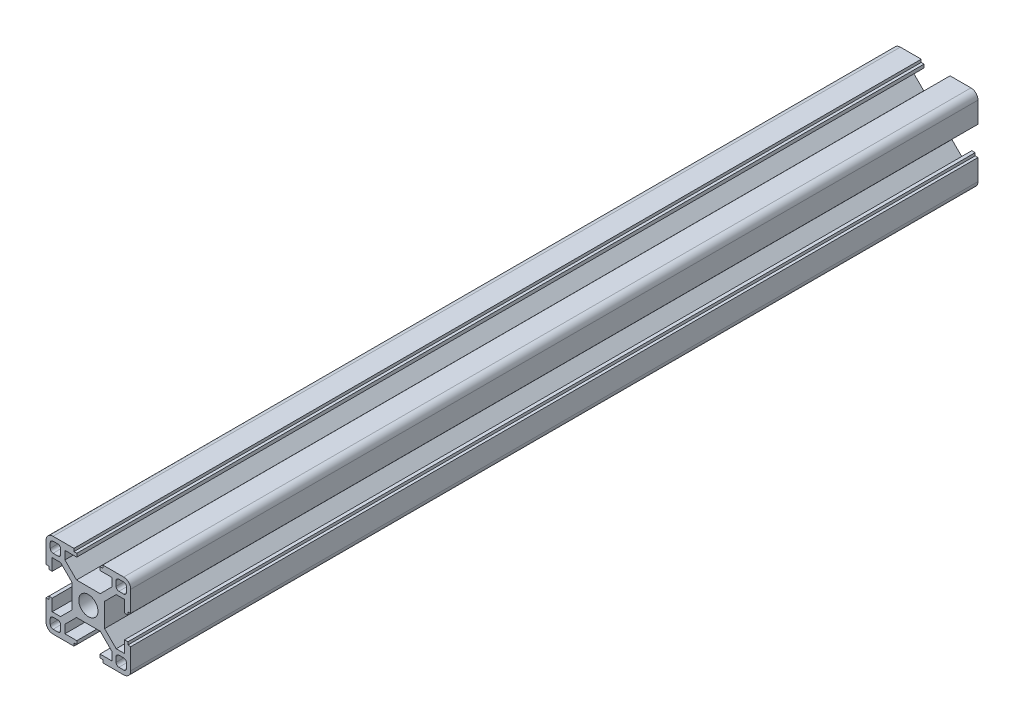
ISO-10303-21;
HEADER;
FILE_DESCRIPTION(('STEP AP214'),'2;1');
FILE_NAME('part.step','',(''),(''),'','','');
FILE_SCHEMA(('AUTOMOTIVE_DESIGN { 1 0 10303 214 1 1 1 1 }'));
ENDSEC;
DATA;
#1=APPLICATION_CONTEXT('core data for automotive mechanical design processes');
#2=APPLICATION_PROTOCOL_DEFINITION('international standard','automotive_design',2000,#1);
#3=PRODUCT_CONTEXT('',#1,'mechanical');
#4=PRODUCT('Part','Part','',(#3));
#5=PRODUCT_RELATED_PRODUCT_CATEGORY('part','',(#4));
#6=PRODUCT_DEFINITION_FORMATION('','',#4);
#7=PRODUCT_DEFINITION_CONTEXT('part definition',#1,'design');
#8=PRODUCT_DEFINITION('design','',#6,#7);
#9=PRODUCT_DEFINITION_SHAPE('','',#8);
#10=(LENGTH_UNIT() NAMED_UNIT(*) SI_UNIT(.MILLI.,.METRE.));
#11=(NAMED_UNIT(*) PLANE_ANGLE_UNIT() SI_UNIT($,.RADIAN.));
#12=(NAMED_UNIT(*) SI_UNIT($,.STERADIAN.) SOLID_ANGLE_UNIT());
#13=UNCERTAINTY_MEASURE_WITH_UNIT(LENGTH_MEASURE(1.E-05),#10,'distance_accuracy_value','');
#14=(GEOMETRIC_REPRESENTATION_CONTEXT(3) GLOBAL_UNCERTAINTY_ASSIGNED_CONTEXT((#13)) GLOBAL_UNIT_ASSIGNED_CONTEXT((#10,
#11,#12)) REPRESENTATION_CONTEXT('',''));
#15=CARTESIAN_POINT('',(0.,0.,0.));
#16=DIRECTION('',(0.,0.,1.));
#17=DIRECTION('',(1.,0.,0.));
#18=AXIS2_PLACEMENT_3D('',#15,#16,#17);
#19=CARTESIAN_POINT('',(-12.4999999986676,-12.4999999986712,150.));
#20=DIRECTION('',(0.,0.,1.));
#21=DIRECTION('',(1.,0.,0.));
#22=AXIS2_PLACEMENT_3D('',#19,#20,#21);
#23=PLANE('',#22);
#24=DIRECTION('',(0.,-1.,0.));
#25=VECTOR('',#24,1.);
#26=CARTESIAN_POINT('',(9.80000000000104,-10.8000000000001,150.));
#27=LINE('',#26,#25);
#28=CARTESIAN_POINT('',(9.80000000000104,-10.8000000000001,150.));
#29=VERTEX_POINT('',#28);
#30=CARTESIAN_POINT('',(9.80000000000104,-12.4999999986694,150.));
#31=VERTEX_POINT('',#30);
#32=EDGE_CURVE('E695',#29,#31,#27,.T.);
#33=ORIENTED_EDGE('',*,*,#32,.F.);
#34=CARTESIAN_POINT('',(10.800000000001,-10.8000000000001,150.));
#35=DIRECTION('',(0.,0.,1.));
#36=DIRECTION('',(1.,0.,0.));
#37=AXIS2_PLACEMENT_3D('',#34,#35,#36);
#38=CIRCLE('',#37,0.999999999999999);
#39=CARTESIAN_POINT('',(10.800000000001,-9.80000000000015,150.));
#40=VERTEX_POINT('',#39);
#41=EDGE_CURVE('E693',#40,#29,#38,.T.);
#42=ORIENTED_EDGE('',*,*,#41,.F.);
#43=DIRECTION('',(-1.,0.,0.));
#44=VECTOR('',#43,1.);
#45=CARTESIAN_POINT('',(12.4999999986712,-9.80000000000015,150.));
#46=LINE('',#45,#44);
#47=CARTESIAN_POINT('',(12.4999999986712,-9.80000000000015,150.));
#48=VERTEX_POINT('',#47);
#49=EDGE_CURVE('E709',#48,#40,#46,.T.);
#50=ORIENTED_EDGE('',*,*,#49,.F.);
#51=CARTESIAN_POINT('',(12.4999999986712,-10.8000000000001,150.));
#52=DIRECTION('',(0.,0.,1.));
#53=DIRECTION('',(1.,0.,0.));
#54=AXIS2_PLACEMENT_3D('',#51,#52,#53);
#55=CIRCLE('',#54,0.999999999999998);
#56=CARTESIAN_POINT('',(13.4999999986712,-10.8000000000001,150.));
#57=VERTEX_POINT('',#56);
#58=EDGE_CURVE('E706',#57,#48,#55,.T.);
#59=ORIENTED_EDGE('',*,*,#58,.F.);
#60=DIRECTION('',(0.,1.,0.));
#61=VECTOR('',#60,1.);
#62=CARTESIAN_POINT('',(13.4999999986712,-12.4999999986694,150.));
#63=LINE('',#62,#61);
#64=CARTESIAN_POINT('',(13.4999999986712,-12.4999999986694,150.));
#65=VERTEX_POINT('',#64);
#66=EDGE_CURVE('E704',#65,#57,#63,.T.);
#67=ORIENTED_EDGE('',*,*,#66,.F.);
#68=CARTESIAN_POINT('',(12.4999999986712,-12.4999999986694,150.));
#69=DIRECTION('',(0.,0.,1.));
#70=DIRECTION('',(1.,0.,0.));
#71=AXIS2_PLACEMENT_3D('',#68,#69,#70);
#72=CIRCLE('',#71,1.);
#73=CARTESIAN_POINT('',(12.4999999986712,-13.4999999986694,150.));
#74=VERTEX_POINT('',#73);
#75=EDGE_CURVE('E702',#74,#65,#72,.T.);
#76=ORIENTED_EDGE('',*,*,#75,.F.);
#77=DIRECTION('',(1.,0.,0.));
#78=VECTOR('',#77,1.);
#79=CARTESIAN_POINT('',(10.800000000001,-13.4999999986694,150.));
#80=LINE('',#79,#78);
#81=CARTESIAN_POINT('',(10.800000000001,-13.4999999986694,150.));
#82=VERTEX_POINT('',#81);
#83=EDGE_CURVE('E700',#82,#74,#80,.T.);
#84=ORIENTED_EDGE('',*,*,#83,.F.);
#85=CARTESIAN_POINT('',(10.800000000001,-12.4999999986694,150.));
#86=DIRECTION('',(0.,0.,1.));
#87=DIRECTION('',(1.,0.,0.));
#88=AXIS2_PLACEMENT_3D('',#85,#86,#87);
#89=CIRCLE('',#88,1.);
#90=EDGE_CURVE('E698',#31,#82,#89,.T.);
#91=ORIENTED_EDGE('',*,*,#90,.F.);
#92=EDGE_LOOP('',(#33,#42,#50,#59,#67,#76,#84,#91));
#93=FACE_BOUND('',#92,.T.);
#94=DIRECTION('',(0.,1.,0.));
#95=VECTOR('',#94,1.);
#96=CARTESIAN_POINT('',(-9.79999999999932,10.7999999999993,150.));
#97=LINE('',#96,#95);
#98=CARTESIAN_POINT('',(-9.79999999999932,10.7999999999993,150.));
#99=VERTEX_POINT('',#98);
#100=CARTESIAN_POINT('',(-9.79999999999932,12.4999999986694,150.));
#101=VERTEX_POINT('',#100);
#102=EDGE_CURVE('E813',#99,#101,#97,.T.);
#103=ORIENTED_EDGE('',*,*,#102,.F.);
#104=CARTESIAN_POINT('',(-10.7999999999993,10.7999999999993,150.));
#105=DIRECTION('',(0.,0.,1.));
#106=DIRECTION('',(1.,0.,0.));
#107=AXIS2_PLACEMENT_3D('',#104,#105,#106);
#108=CIRCLE('',#107,0.999999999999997);
#109=CARTESIAN_POINT('',(-10.7999999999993,9.79999999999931,150.));
#110=VERTEX_POINT('',#109);
#111=EDGE_CURVE('E811',#110,#99,#108,.T.);
#112=ORIENTED_EDGE('',*,*,#111,.F.);
#113=DIRECTION('',(1.,0.,0.));
#114=VECTOR('',#113,1.);
#115=CARTESIAN_POINT('',(-12.4999999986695,9.79999999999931,150.));
#116=LINE('',#115,#114);
#117=CARTESIAN_POINT('',(-12.4999999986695,9.79999999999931,150.));
#118=VERTEX_POINT('',#117);
#119=EDGE_CURVE('E827',#118,#110,#116,.T.);
#120=ORIENTED_EDGE('',*,*,#119,.F.);
#121=CARTESIAN_POINT('',(-12.4999999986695,10.7999999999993,150.));
#122=DIRECTION('',(0.,0.,1.));
#123=DIRECTION('',(1.,0.,0.));
#124=AXIS2_PLACEMENT_3D('',#121,#122,#123);
#125=CIRCLE('',#124,1.);
#126=CARTESIAN_POINT('',(-13.4999999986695,10.7999999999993,150.));
#127=VERTEX_POINT('',#126);
#128=EDGE_CURVE('E824',#127,#118,#125,.T.);
#129=ORIENTED_EDGE('',*,*,#128,.F.);
#130=DIRECTION('',(0.,-1.,0.));
#131=VECTOR('',#130,1.);
#132=CARTESIAN_POINT('',(-13.4999999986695,12.4999999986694,150.));
#133=LINE('',#132,#131);
#134=CARTESIAN_POINT('',(-13.4999999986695,12.4999999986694,150.));
#135=VERTEX_POINT('',#134);
#136=EDGE_CURVE('E822',#135,#127,#133,.T.);
#137=ORIENTED_EDGE('',*,*,#136,.F.);
#138=CARTESIAN_POINT('',(-12.4999999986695,12.4999999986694,150.));
#139=DIRECTION('',(0.,0.,1.));
#140=DIRECTION('',(1.,0.,0.));
#141=AXIS2_PLACEMENT_3D('',#138,#139,#140);
#142=CIRCLE('',#141,1.);
#143=CARTESIAN_POINT('',(-12.4999999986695,13.4999999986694,150.));
#144=VERTEX_POINT('',#143);
#145=EDGE_CURVE('E820',#144,#135,#142,.T.);
#146=ORIENTED_EDGE('',*,*,#145,.F.);
#147=DIRECTION('',(-1.,0.,0.));
#148=VECTOR('',#147,1.);
#149=CARTESIAN_POINT('',(-10.7999999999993,13.4999999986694,150.));
#150=LINE('',#149,#148);
#151=CARTESIAN_POINT('',(-10.7999999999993,13.4999999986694,150.));
#152=VERTEX_POINT('',#151);
#153=EDGE_CURVE('E818',#152,#144,#150,.T.);
#154=ORIENTED_EDGE('',*,*,#153,.F.);
#155=CARTESIAN_POINT('',(-10.7999999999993,12.4999999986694,150.));
#156=DIRECTION('',(0.,0.,1.));
#157=DIRECTION('',(1.,0.,0.));
#158=AXIS2_PLACEMENT_3D('',#155,#156,#157);
#159=CIRCLE('',#158,1.);
#160=EDGE_CURVE('E816',#101,#152,#159,.T.);
#161=ORIENTED_EDGE('',*,*,#160,.F.);
#162=EDGE_LOOP('',(#103,#112,#120,#129,#137,#146,#154,#161));
#163=FACE_BOUND('',#162,.T.);
#164=CARTESIAN_POINT('',(-12.4999999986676,-12.4999999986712,150.));
#165=DIRECTION('',(0.,0.,1.));
#166=DIRECTION('',(1.,0.,0.));
#167=AXIS2_PLACEMENT_3D('',#164,#165,#166);
#168=CIRCLE('',#167,2.5);
#169=CARTESIAN_POINT('',(-14.9999999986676,-12.4999999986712,150.));
#170=VERTEX_POINT('',#169);
#171=CARTESIAN_POINT('',(-12.4999999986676,-14.9999999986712,150.));
#172=VERTEX_POINT('',#171);
#173=EDGE_CURVE('E876',#170,#172,#168,.T.);
#174=ORIENTED_EDGE('',*,*,#173,.T.);
#175=DIRECTION('',(1.,0.,0.));
#176=VECTOR('',#175,1.);
#177=CARTESIAN_POINT('',(-12.4999999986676,-14.9999999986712,150.));
#178=LINE('',#177,#176);
#179=CARTESIAN_POINT('',(-5.10000000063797,-14.9999999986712,150.));
#180=VERTEX_POINT('',#179);
#181=EDGE_CURVE('E879',#172,#180,#178,.T.);
#182=ORIENTED_EDGE('',*,*,#181,.T.);
#183=DIRECTION('',(0.,1.,0.));
#184=VECTOR('',#183,1.);
#185=CARTESIAN_POINT('',(-5.10000000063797,-14.9999999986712,150.));
#186=LINE('',#185,#184);
#187=CARTESIAN_POINT('',(-5.10000000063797,-13.9999999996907,150.));
#188=VERTEX_POINT('',#187);
#189=EDGE_CURVE('E882',#180,#188,#186,.T.);
#190=ORIENTED_EDGE('',*,*,#189,.T.);
#191=DIRECTION('',(1.,0.,0.));
#192=VECTOR('',#191,1.);
#193=CARTESIAN_POINT('',(-5.10000000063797,-13.9999999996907,150.));
#194=LINE('',#193,#192);
#195=CARTESIAN_POINT('',(-4.0999999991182,-13.9999999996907,150.));
#196=VERTEX_POINT('',#195);
#197=EDGE_CURVE('E884',#188,#196,#194,.T.);
#198=ORIENTED_EDGE('',*,*,#197,.T.);
#199=DIRECTION('',(0.,1.,0.));
#200=VECTOR('',#199,1.);
#201=CARTESIAN_POINT('',(-4.0999999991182,-13.9999999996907,150.));
#202=LINE('',#201,#200);
#203=CARTESIAN_POINT('',(-4.0999999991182,-12.7999999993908,150.));
#204=VERTEX_POINT('',#203);
#205=EDGE_CURVE('E886',#196,#204,#202,.T.);
#206=ORIENTED_EDGE('',*,*,#205,.T.);
#207=DIRECTION('',(-1.,0.,0.));
#208=VECTOR('',#207,1.);
#209=CARTESIAN_POINT('',(-4.0999999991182,-12.7999999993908,150.));
#210=LINE('',#209,#208);
#211=CARTESIAN_POINT('',(-8.29999999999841,-12.7999999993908,150.));
#212=VERTEX_POINT('',#211);
#213=EDGE_CURVE('E888',#204,#212,#210,.T.);
#214=ORIENTED_EDGE('',*,*,#213,.T.);
#215=DIRECTION('',(0.,1.,0.));
#216=VECTOR('',#215,1.);
#217=CARTESIAN_POINT('',(-8.29999999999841,-12.7999999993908,150.));
#218=LINE('',#217,#216);
#219=CARTESIAN_POINT('',(-8.29999999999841,-9.85563492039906,150.));
#220=VERTEX_POINT('',#219);
#221=EDGE_CURVE('E890',#212,#220,#218,.T.);
#222=ORIENTED_EDGE('',*,*,#221,.T.);
#223=DIRECTION('',(0.707106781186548,0.707106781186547,0.));
#224=VECTOR('',#223,1.);
#225=CARTESIAN_POINT('',(-8.29999999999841,-9.85563492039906,150.));
#226=LINE('',#225,#224);
#227=CARTESIAN_POINT('',(-4.19436507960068,-5.75000000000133,150.));
#228=VERTEX_POINT('',#227);
#229=EDGE_CURVE('E892',#220,#228,#226,.T.);
#230=ORIENTED_EDGE('',*,*,#229,.T.);
#231=DIRECTION('',(1.,0.,0.));
#232=VECTOR('',#231,1.);
#233=CARTESIAN_POINT('',(-4.19436507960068,-5.75000000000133,150.));
#234=LINE('',#233,#232);
#235=CARTESIAN_POINT('',(4.19436507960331,-5.75000000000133,150.));
#236=VERTEX_POINT('',#235);
#237=EDGE_CURVE('E894',#228,#236,#234,.T.);
#238=ORIENTED_EDGE('',*,*,#237,.T.);
#239=DIRECTION('',(0.707106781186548,-0.707106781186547,0.));
#240=VECTOR('',#239,1.);
#241=CARTESIAN_POINT('',(4.19436507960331,-5.75000000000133,150.));
#242=LINE('',#241,#240);
#243=CARTESIAN_POINT('',(8.30000000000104,-9.85563492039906,150.));
#244=VERTEX_POINT('',#243);
#245=EDGE_CURVE('E896',#236,#244,#242,.T.);
#246=ORIENTED_EDGE('',*,*,#245,.T.);
#247=DIRECTION('',(0.,-1.,0.));
#248=VECTOR('',#247,1.);
#249=CARTESIAN_POINT('',(8.30000000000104,-9.85563492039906,150.));
#250=LINE('',#249,#248);
#251=CARTESIAN_POINT('',(8.30000000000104,-12.7999999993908,150.));
#252=VERTEX_POINT('',#251);
#253=EDGE_CURVE('E898',#244,#252,#250,.T.);
#254=ORIENTED_EDGE('',*,*,#253,.T.);
#255=DIRECTION('',(-1.,0.,0.));
#256=VECTOR('',#255,1.);
#257=CARTESIAN_POINT('',(8.30000000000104,-12.7999999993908,150.));
#258=LINE('',#257,#256);
#259=CARTESIAN_POINT('',(4.09999999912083,-12.7999999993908,150.));
#260=VERTEX_POINT('',#259);
#261=EDGE_CURVE('E900',#252,#260,#258,.T.);
#262=ORIENTED_EDGE('',*,*,#261,.T.);
#263=DIRECTION('',(0.,-1.,0.));
#264=VECTOR('',#263,1.);
#265=CARTESIAN_POINT('',(4.09999999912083,-12.7999999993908,150.));
#266=LINE('',#265,#264);
#267=CARTESIAN_POINT('',(4.09999999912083,-13.9999999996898,150.));
#268=VERTEX_POINT('',#267);
#269=EDGE_CURVE('E902',#260,#268,#266,.T.);
#270=ORIENTED_EDGE('',*,*,#269,.T.);
#271=DIRECTION('',(1.,0.,0.));
#272=VECTOR('',#271,1.);
#273=CARTESIAN_POINT('',(4.09999999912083,-13.9999999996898,150.));
#274=LINE('',#273,#272);
#275=CARTESIAN_POINT('',(5.10000000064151,-13.9999999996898,150.));
#276=VERTEX_POINT('',#275);
#277=EDGE_CURVE('E904',#268,#276,#274,.T.);
#278=ORIENTED_EDGE('',*,*,#277,.T.);
#279=DIRECTION('',(0.,-1.,0.));
#280=VECTOR('',#279,1.);
#281=CARTESIAN_POINT('',(5.10000000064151,-13.9999999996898,150.));
#282=LINE('',#281,#280);
#283=CARTESIAN_POINT('',(5.10000000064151,-14.9999999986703,150.));
#284=VERTEX_POINT('',#283);
#285=EDGE_CURVE('E906',#276,#284,#282,.T.);
#286=ORIENTED_EDGE('',*,*,#285,.T.);
#287=DIRECTION('',(1.,0.,0.));
#288=VECTOR('',#287,1.);
#289=CARTESIAN_POINT('',(5.10000000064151,-14.9999999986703,150.));
#290=LINE('',#289,#288);
#291=CARTESIAN_POINT('',(12.4999999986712,-14.9999999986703,150.));
#292=VERTEX_POINT('',#291);
#293=EDGE_CURVE('E908',#284,#292,#290,.T.);
#294=ORIENTED_EDGE('',*,*,#293,.T.);
#295=CARTESIAN_POINT('',(12.4999999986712,-12.4999999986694,150.));
#296=DIRECTION('',(0.,0.,1.));
#297=DIRECTION('',(1.,0.,0.));
#298=AXIS2_PLACEMENT_3D('',#295,#296,#297);
#299=CIRCLE('',#298,2.50000000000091);
#300=CARTESIAN_POINT('',(14.9999999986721,-12.4999999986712,150.));
#301=VERTEX_POINT('',#300);
#302=EDGE_CURVE('E910',#292,#301,#299,.T.);
#303=ORIENTED_EDGE('',*,*,#302,.T.);
#304=DIRECTION('',(0.,1.,0.));
#305=VECTOR('',#304,1.);
#306=CARTESIAN_POINT('',(14.9999999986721,-12.4999999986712,150.));
#307=LINE('',#306,#305);
#308=CARTESIAN_POINT('',(14.9999999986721,-5.10000000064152,150.));
#309=VERTEX_POINT('',#308);
#310=EDGE_CURVE('E912',#301,#309,#307,.T.);
#311=ORIENTED_EDGE('',*,*,#310,.T.);
#312=DIRECTION('',(-1.,0.,0.));
#313=VECTOR('',#312,1.);
#314=CARTESIAN_POINT('',(14.9999999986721,-5.10000000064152,150.));
#315=LINE('',#314,#313);
#316=CARTESIAN_POINT('',(13.9999999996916,-5.10000000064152,150.));
#317=VERTEX_POINT('',#316);
#318=EDGE_CURVE('E914',#309,#317,#315,.T.);
#319=ORIENTED_EDGE('',*,*,#318,.T.);
#320=DIRECTION('',(0.,1.,0.));
#321=VECTOR('',#320,1.);
#322=CARTESIAN_POINT('',(13.9999999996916,-5.10000000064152,150.));
#323=LINE('',#322,#321);
#324=CARTESIAN_POINT('',(13.9999999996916,-4.09999999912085,150.));
#325=VERTEX_POINT('',#324);
#326=EDGE_CURVE('E916',#317,#325,#323,.T.);
#327=ORIENTED_EDGE('',*,*,#326,.T.);
#328=DIRECTION('',(-1.,0.,0.));
#329=VECTOR('',#328,1.);
#330=CARTESIAN_POINT('',(13.9999999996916,-4.09999999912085,150.));
#331=LINE('',#330,#329);
#332=CARTESIAN_POINT('',(12.7999999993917,-4.09999999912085,150.));
#333=VERTEX_POINT('',#332);
#334=EDGE_CURVE('E918',#325,#333,#331,.T.);
#335=ORIENTED_EDGE('',*,*,#334,.T.);
#336=DIRECTION('',(0.,-1.,0.));
#337=VECTOR('',#336,1.);
#338=CARTESIAN_POINT('',(12.7999999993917,-4.09999999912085,150.));
#339=LINE('',#338,#337);
#340=CARTESIAN_POINT('',(12.7999999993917,-8.30000000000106,150.));
#341=VERTEX_POINT('',#340);
#342=EDGE_CURVE('E920',#333,#341,#339,.T.);
#343=ORIENTED_EDGE('',*,*,#342,.T.);
#344=DIRECTION('',(-1.,0.,0.));
#345=VECTOR('',#344,1.);
#346=CARTESIAN_POINT('',(12.7999999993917,-8.30000000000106,150.));
#347=LINE('',#346,#345);
#348=CARTESIAN_POINT('',(9.85563492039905,-8.30000000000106,150.));
#349=VERTEX_POINT('',#348);
#350=EDGE_CURVE('E922',#341,#349,#347,.T.);
#351=ORIENTED_EDGE('',*,*,#350,.T.);
#352=DIRECTION('',(-0.707106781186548,0.707106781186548,0.));
#353=VECTOR('',#352,1.);
#354=CARTESIAN_POINT('',(9.85563492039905,-8.30000000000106,150.));
#355=LINE('',#354,#353);
#356=CARTESIAN_POINT('',(5.75000000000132,-4.19436507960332,150.));
#357=VERTEX_POINT('',#356);
#358=EDGE_CURVE('E924',#349,#357,#355,.T.);
#359=ORIENTED_EDGE('',*,*,#358,.T.);
#360=DIRECTION('',(0.,1.,0.));
#361=VECTOR('',#360,1.);
#362=CARTESIAN_POINT('',(5.75000000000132,-4.19436507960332,150.));
#363=LINE('',#362,#361);
#364=CARTESIAN_POINT('',(5.75000000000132,4.19436507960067,150.));
#365=VERTEX_POINT('',#364);
#366=EDGE_CURVE('E926',#357,#365,#363,.T.);
#367=ORIENTED_EDGE('',*,*,#366,.T.);
#368=DIRECTION('',(0.707106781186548,0.707106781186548,0.));
#369=VECTOR('',#368,1.);
#370=CARTESIAN_POINT('',(5.75000000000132,4.19436507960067,150.));
#371=LINE('',#370,#369);
#372=CARTESIAN_POINT('',(9.85563492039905,8.2999999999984,150.));
#373=VERTEX_POINT('',#372);
#374=EDGE_CURVE('E928',#365,#373,#371,.T.);
#375=ORIENTED_EDGE('',*,*,#374,.T.);
#376=DIRECTION('',(1.,0.,0.));
#377=VECTOR('',#376,1.);
#378=CARTESIAN_POINT('',(9.85563492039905,8.2999999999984,150.));
#379=LINE('',#378,#377);
#380=CARTESIAN_POINT('',(12.7999999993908,8.2999999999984,150.));
#381=VERTEX_POINT('',#380);
#382=EDGE_CURVE('E930',#373,#381,#379,.T.);
#383=ORIENTED_EDGE('',*,*,#382,.T.);
#384=DIRECTION('',(0.,-1.,0.));
#385=VECTOR('',#384,1.);
#386=CARTESIAN_POINT('',(12.7999999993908,8.2999999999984,150.));
#387=LINE('',#386,#385);
#388=CARTESIAN_POINT('',(12.7999999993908,4.09999999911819,150.));
#389=VERTEX_POINT('',#388);
#390=EDGE_CURVE('E932',#381,#389,#387,.T.);
#391=ORIENTED_EDGE('',*,*,#390,.T.);
#392=DIRECTION('',(1.,0.,0.));
#393=VECTOR('',#392,1.);
#394=CARTESIAN_POINT('',(12.7999999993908,4.09999999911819,150.));
#395=LINE('',#394,#393);
#396=CARTESIAN_POINT('',(13.9999999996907,4.09999999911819,150.));
#397=VERTEX_POINT('',#396);
#398=EDGE_CURVE('E934',#389,#397,#395,.T.);
#399=ORIENTED_EDGE('',*,*,#398,.T.);
#400=DIRECTION('',(0.,1.,0.));
#401=VECTOR('',#400,1.);
#402=CARTESIAN_POINT('',(13.9999999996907,4.09999999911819,150.));
#403=LINE('',#402,#401);
#404=CARTESIAN_POINT('',(13.9999999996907,5.10000000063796,150.));
#405=VERTEX_POINT('',#404);
#406=EDGE_CURVE('E936',#397,#405,#403,.T.);
#407=ORIENTED_EDGE('',*,*,#406,.T.);
#408=DIRECTION('',(1.,0.,0.));
#409=VECTOR('',#408,1.);
#410=CARTESIAN_POINT('',(13.9999999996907,5.10000000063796,150.));
#411=LINE('',#410,#409);
#412=CARTESIAN_POINT('',(14.9999999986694,5.10000000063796,150.));
#413=VERTEX_POINT('',#412);
#414=EDGE_CURVE('E938',#405,#413,#411,.T.);
#415=ORIENTED_EDGE('',*,*,#414,.T.);
#416=DIRECTION('',(0.,1.,0.));
#417=VECTOR('',#416,1.);
#418=CARTESIAN_POINT('',(14.9999999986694,5.10000000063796,150.));
#419=LINE('',#418,#417);
#420=CARTESIAN_POINT('',(14.9999999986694,12.4999999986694,150.));
#421=VERTEX_POINT('',#420);
#422=EDGE_CURVE('E940',#413,#421,#419,.T.);
#423=ORIENTED_EDGE('',*,*,#422,.T.);
#424=CARTESIAN_POINT('',(12.4999999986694,12.4999999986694,150.));
#425=DIRECTION('',(0.,0.,1.));
#426=DIRECTION('',(1.,0.,0.));
#427=AXIS2_PLACEMENT_3D('',#424,#425,#426);
#428=CIRCLE('',#427,2.5);
#429=CARTESIAN_POINT('',(12.4999999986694,14.9999999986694,150.));
#430=VERTEX_POINT('',#429);
#431=EDGE_CURVE('E942',#421,#430,#428,.T.);
#432=ORIENTED_EDGE('',*,*,#431,.T.);
#433=DIRECTION('',(-1.,0.,0.));
#434=VECTOR('',#433,1.);
#435=CARTESIAN_POINT('',(12.4999999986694,14.9999999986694,150.));
#436=LINE('',#435,#434);
#437=CARTESIAN_POINT('',(5.10000000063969,14.9999999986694,150.));
#438=VERTEX_POINT('',#437);
#439=EDGE_CURVE('E944',#430,#438,#436,.T.);
#440=ORIENTED_EDGE('',*,*,#439,.T.);
#441=DIRECTION('',(0.,-1.,0.));
#442=VECTOR('',#441,1.);
#443=CARTESIAN_POINT('',(5.10000000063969,14.9999999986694,150.));
#444=LINE('',#443,#442);
#445=CARTESIAN_POINT('',(5.10000000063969,13.999999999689,150.));
#446=VERTEX_POINT('',#445);
#447=EDGE_CURVE('E946',#438,#446,#444,.T.);
#448=ORIENTED_EDGE('',*,*,#447,.T.);
#449=DIRECTION('',(-1.,0.,0.));
#450=VECTOR('',#449,1.);
#451=CARTESIAN_POINT('',(5.10000000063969,13.999999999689,150.));
#452=LINE('',#451,#450);
#453=CARTESIAN_POINT('',(4.09999999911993,13.999999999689,150.));
#454=VERTEX_POINT('',#453);
#455=EDGE_CURVE('E948',#446,#454,#452,.T.);
#456=ORIENTED_EDGE('',*,*,#455,.T.);
#457=DIRECTION('',(0.,-1.,0.));
#458=VECTOR('',#457,1.);
#459=CARTESIAN_POINT('',(4.09999999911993,13.999999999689,150.));
#460=LINE('',#459,#458);
#461=CARTESIAN_POINT('',(4.09999999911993,12.7999999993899,150.));
#462=VERTEX_POINT('',#461);
#463=EDGE_CURVE('E950',#454,#462,#460,.T.);
#464=ORIENTED_EDGE('',*,*,#463,.T.);
#465=DIRECTION('',(1.,0.,0.));
#466=VECTOR('',#465,1.);
#467=CARTESIAN_POINT('',(4.09999999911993,12.7999999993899,150.));
#468=LINE('',#467,#466);
#469=CARTESIAN_POINT('',(8.30000000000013,12.7999999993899,150.));
#470=VERTEX_POINT('',#469);
#471=EDGE_CURVE('E952',#462,#470,#468,.T.);
#472=ORIENTED_EDGE('',*,*,#471,.T.);
#473=DIRECTION('',(0.,-1.,0.));
#474=VECTOR('',#473,1.);
#475=CARTESIAN_POINT('',(8.30000000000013,12.7999999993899,150.));
#476=LINE('',#475,#474);
#477=CARTESIAN_POINT('',(8.30000000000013,9.8556349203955,150.));
#478=VERTEX_POINT('',#477);
#479=EDGE_CURVE('E954',#470,#478,#476,.T.);
#480=ORIENTED_EDGE('',*,*,#479,.T.);
#481=DIRECTION('',(-0.707106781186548,-0.707106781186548,0.));
#482=VECTOR('',#481,1.);
#483=CARTESIAN_POINT('',(8.30000000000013,9.8556349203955,150.));
#484=LINE('',#483,#482);
#485=CARTESIAN_POINT('',(4.19436507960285,5.74999999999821,150.));
#486=VERTEX_POINT('',#485);
#487=EDGE_CURVE('E956',#478,#486,#484,.T.);
#488=ORIENTED_EDGE('',*,*,#487,.T.);
#489=DIRECTION('',(-1.,0.,0.));
#490=VECTOR('',#489,1.);
#491=CARTESIAN_POINT('',(4.19436507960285,5.74999999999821,150.));
#492=LINE('',#491,#490);
#493=CARTESIAN_POINT('',(-4.19436507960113,5.74999999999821,150.));
#494=VERTEX_POINT('',#493);
#495=EDGE_CURVE('E958',#486,#494,#492,.T.);
#496=ORIENTED_EDGE('',*,*,#495,.T.);
#497=DIRECTION('',(-0.707106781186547,0.707106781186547,0.));
#498=VECTOR('',#497,1.);
#499=CARTESIAN_POINT('',(-4.19436507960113,5.74999999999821,150.));
#500=LINE('',#499,#498);
#501=CARTESIAN_POINT('',(-8.29999999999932,9.8556349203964,150.));
#502=VERTEX_POINT('',#501);
#503=EDGE_CURVE('E960',#494,#502,#500,.T.);
#504=ORIENTED_EDGE('',*,*,#503,.T.);
#505=DIRECTION('',(0.,1.,0.));
#506=VECTOR('',#505,1.);
#507=CARTESIAN_POINT('',(-8.29999999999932,9.8556349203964,150.));
#508=LINE('',#507,#506);
#509=CARTESIAN_POINT('',(-8.29999999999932,12.7999999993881,150.));
#510=VERTEX_POINT('',#509);
#511=EDGE_CURVE('E962',#502,#510,#508,.T.);
#512=ORIENTED_EDGE('',*,*,#511,.T.);
#513=DIRECTION('',(1.,0.,0.));
#514=VECTOR('',#513,1.);
#515=CARTESIAN_POINT('',(-8.29999999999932,12.7999999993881,150.));
#516=LINE('',#515,#514);
#517=CARTESIAN_POINT('',(-4.09999999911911,12.7999999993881,150.));
#518=VERTEX_POINT('',#517);
#519=EDGE_CURVE('E964',#510,#518,#516,.T.);
#520=ORIENTED_EDGE('',*,*,#519,.T.);
#521=DIRECTION('',(0.,1.,0.));
#522=VECTOR('',#521,1.);
#523=CARTESIAN_POINT('',(-4.09999999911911,12.7999999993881,150.));
#524=LINE('',#523,#522);
#525=CARTESIAN_POINT('',(-4.09999999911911,13.9999999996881,150.));
#526=VERTEX_POINT('',#525);
#527=EDGE_CURVE('E966',#518,#526,#524,.T.);
#528=ORIENTED_EDGE('',*,*,#527,.T.);
#529=DIRECTION('',(-1.,0.,0.));
#530=VECTOR('',#529,1.);
#531=CARTESIAN_POINT('',(-4.09999999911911,13.9999999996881,150.));
#532=LINE('',#531,#530);
#533=CARTESIAN_POINT('',(-5.10000000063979,13.9999999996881,150.));
#534=VERTEX_POINT('',#533);
#535=EDGE_CURVE('E968',#526,#534,#532,.T.);
#536=ORIENTED_EDGE('',*,*,#535,.T.);
#537=DIRECTION('',(0.,1.,0.));
#538=VECTOR('',#537,1.);
#539=CARTESIAN_POINT('',(-5.10000000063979,13.9999999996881,150.));
#540=LINE('',#539,#538);
#541=CARTESIAN_POINT('',(-5.10000000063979,14.9999999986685,150.));
#542=VERTEX_POINT('',#541);
#543=EDGE_CURVE('E970',#534,#542,#540,.T.);
#544=ORIENTED_EDGE('',*,*,#543,.T.);
#545=DIRECTION('',(-1.,0.,0.));
#546=VECTOR('',#545,1.);
#547=CARTESIAN_POINT('',(-5.10000000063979,14.9999999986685,150.));
#548=LINE('',#547,#546);
#549=CARTESIAN_POINT('',(-12.4999999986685,14.9999999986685,150.));
#550=VERTEX_POINT('',#549);
#551=EDGE_CURVE('E972',#542,#550,#548,.T.);
#552=ORIENTED_EDGE('',*,*,#551,.T.);
#553=CARTESIAN_POINT('',(-12.4999999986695,12.4999999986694,150.));
#554=DIRECTION('',(0.,0.,1.));
#555=DIRECTION('',(1.,0.,0.));
#556=AXIS2_PLACEMENT_3D('',#553,#554,#555);
#557=CIRCLE('',#556,2.49999999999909);
#558=CARTESIAN_POINT('',(-14.9999999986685,12.4999999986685,150.));
#559=VERTEX_POINT('',#558);
#560=EDGE_CURVE('E974',#550,#559,#557,.T.);
#561=ORIENTED_EDGE('',*,*,#560,.T.);
#562=DIRECTION('',(0.,-1.,0.));
#563=VECTOR('',#562,1.);
#564=CARTESIAN_POINT('',(-14.9999999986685,12.4999999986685,150.));
#565=LINE('',#564,#563);
#566=CARTESIAN_POINT('',(-14.9999999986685,5.10000000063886,150.));
#567=VERTEX_POINT('',#566);
#568=EDGE_CURVE('E976',#559,#567,#565,.T.);
#569=ORIENTED_EDGE('',*,*,#568,.T.);
#570=DIRECTION('',(1.,0.,0.));
#571=VECTOR('',#570,1.);
#572=CARTESIAN_POINT('',(-14.9999999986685,5.10000000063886,150.));
#573=LINE('',#572,#571);
#574=CARTESIAN_POINT('',(-13.9999999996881,5.10000000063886,150.));
#575=VERTEX_POINT('',#574);
#576=EDGE_CURVE('E978',#567,#575,#573,.T.);
#577=ORIENTED_EDGE('',*,*,#576,.T.);
#578=DIRECTION('',(0.,-1.,0.));
#579=VECTOR('',#578,1.);
#580=CARTESIAN_POINT('',(-13.9999999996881,5.10000000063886,150.));
#581=LINE('',#580,#579);
#582=CARTESIAN_POINT('',(-13.9999999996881,4.0999999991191,150.));
#583=VERTEX_POINT('',#582);
#584=EDGE_CURVE('E980',#575,#583,#581,.T.);
#585=ORIENTED_EDGE('',*,*,#584,.T.);
#586=DIRECTION('',(1.,0.,0.));
#587=VECTOR('',#586,1.);
#588=CARTESIAN_POINT('',(-13.9999999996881,4.0999999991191,150.));
#589=LINE('',#588,#587);
#590=CARTESIAN_POINT('',(-12.7999999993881,4.0999999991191,150.));
#591=VERTEX_POINT('',#590);
#592=EDGE_CURVE('E982',#583,#591,#589,.T.);
#593=ORIENTED_EDGE('',*,*,#592,.T.);
#594=DIRECTION('',(0.,1.,0.));
#595=VECTOR('',#594,1.);
#596=CARTESIAN_POINT('',(-12.7999999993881,4.0999999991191,150.));
#597=LINE('',#596,#595);
#598=CARTESIAN_POINT('',(-12.7999999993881,8.29999999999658,150.));
#599=VERTEX_POINT('',#598);
#600=EDGE_CURVE('E984',#591,#599,#597,.T.);
#601=ORIENTED_EDGE('',*,*,#600,.T.);
#602=DIRECTION('',(1.,0.,0.));
#603=VECTOR('',#602,1.);
#604=CARTESIAN_POINT('',(-12.7999999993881,8.29999999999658,150.));
#605=LINE('',#604,#603);
#606=CARTESIAN_POINT('',(-9.8556349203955,8.29999999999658,150.));
#607=VERTEX_POINT('',#606);
#608=EDGE_CURVE('E986',#599,#607,#605,.T.);
#609=ORIENTED_EDGE('',*,*,#608,.T.);
#610=DIRECTION('',(0.707106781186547,-0.707106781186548,0.));
#611=VECTOR('',#610,1.);
#612=CARTESIAN_POINT('',(-9.8556349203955,8.29999999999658,150.));
#613=LINE('',#612,#611);
#614=CARTESIAN_POINT('',(-5.74999999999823,4.1943650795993,150.));
#615=VERTEX_POINT('',#614);
#616=EDGE_CURVE('E988',#607,#615,#613,.T.);
#617=ORIENTED_EDGE('',*,*,#616,.T.);
#618=DIRECTION('',(0.,-1.,0.));
#619=VECTOR('',#618,1.);
#620=CARTESIAN_POINT('',(-5.74999999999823,4.1943650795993,150.));
#621=LINE('',#620,#619);
#622=CARTESIAN_POINT('',(-5.74999999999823,-4.19436507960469,150.));
#623=VERTEX_POINT('',#622);
#624=EDGE_CURVE('E990',#615,#623,#621,.T.);
#625=ORIENTED_EDGE('',*,*,#624,.T.);
#626=DIRECTION('',(-0.707106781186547,-0.707106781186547,0.));
#627=VECTOR('',#626,1.);
#628=CARTESIAN_POINT('',(-5.74999999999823,-4.19436507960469,150.));
#629=LINE('',#628,#627);
#630=CARTESIAN_POINT('',(-9.85563492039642,-8.30000000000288,150.));
#631=VERTEX_POINT('',#630);
#632=EDGE_CURVE('E992',#623,#631,#629,.T.);
#633=ORIENTED_EDGE('',*,*,#632,.T.);
#634=DIRECTION('',(-1.,0.,0.));
#635=VECTOR('',#634,1.);
#636=CARTESIAN_POINT('',(-9.85563492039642,-8.30000000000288,150.));
#637=LINE('',#636,#635);
#638=CARTESIAN_POINT('',(-12.7999999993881,-8.30000000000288,150.));
#639=VERTEX_POINT('',#638);
#640=EDGE_CURVE('E994',#631,#639,#637,.T.);
#641=ORIENTED_EDGE('',*,*,#640,.T.);
#642=DIRECTION('',(0.,1.,0.));
#643=VECTOR('',#642,1.);
#644=CARTESIAN_POINT('',(-12.7999999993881,-8.30000000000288,150.));
#645=LINE('',#644,#643);
#646=CARTESIAN_POINT('',(-12.7999999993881,-4.09999999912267,150.));
#647=VERTEX_POINT('',#646);
#648=EDGE_CURVE('E996',#639,#647,#645,.T.);
#649=ORIENTED_EDGE('',*,*,#648,.T.);
#650=DIRECTION('',(-1.,0.,0.));
#651=VECTOR('',#650,1.);
#652=CARTESIAN_POINT('',(-12.7999999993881,-4.09999999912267,150.));
#653=LINE('',#652,#651);
#654=CARTESIAN_POINT('',(-13.9999999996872,-4.09999999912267,150.));
#655=VERTEX_POINT('',#654);
#656=EDGE_CURVE('E998',#647,#655,#653,.T.);
#657=ORIENTED_EDGE('',*,*,#656,.T.);
#658=DIRECTION('',(0.,-1.,0.));
#659=VECTOR('',#658,1.);
#660=CARTESIAN_POINT('',(-13.9999999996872,-4.09999999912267,150.));
#661=LINE('',#660,#659);
#662=CARTESIAN_POINT('',(-13.9999999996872,-5.10000000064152,150.));
#663=VERTEX_POINT('',#662);
#664=EDGE_CURVE('E1000',#655,#663,#661,.T.);
#665=ORIENTED_EDGE('',*,*,#664,.T.);
#666=DIRECTION('',(-1.,0.,0.));
#667=VECTOR('',#666,1.);
#668=CARTESIAN_POINT('',(-13.9999999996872,-5.10000000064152,150.));
#669=LINE('',#668,#667);
#670=CARTESIAN_POINT('',(-14.9999999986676,-5.10000000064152,150.));
#671=VERTEX_POINT('',#670);
#672=EDGE_CURVE('E1002',#663,#671,#669,.T.);
#673=ORIENTED_EDGE('',*,*,#672,.T.);
#674=DIRECTION('',(0.,-1.,0.));
#675=VECTOR('',#674,1.);
#676=CARTESIAN_POINT('',(-14.9999999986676,-5.10000000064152,150.));
#677=LINE('',#676,#675);
#678=EDGE_CURVE('E1004',#671,#170,#677,.T.);
#679=ORIENTED_EDGE('',*,*,#678,.T.);
#680=EDGE_LOOP('',(#174,#182,#190,#198,#206,#214,#222,#230,#238,#246,#254,#262,#270,#278,#286,
#294,#303,#311,#319,#327,#335,#343,#351,#359,#367,#375,#383,#391,#399,#407,#415,#423,#432,#440,
#448,#456,#464,#472,#480,#488,#496,#504,#512,#520,#528,#536,#544,#552,#561,#569,#577,#585,#593,
#601,#609,#617,#625,#633,#641,#649,#657,#665,#673,#679));
#681=FACE_BOUND('',#680,.T.);
#682=CARTESIAN_POINT('',(0.,0.,150.));
#683=DIRECTION('',(0.,0.,1.));
#684=DIRECTION('',(1.,0.,0.));
#685=AXIS2_PLACEMENT_3D('',#682,#683,#684);
#686=CIRCLE('',#685,3.39999999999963);
#687=CARTESIAN_POINT('',(3.39999999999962,0.,150.));
#688=VERTEX_POINT('',#687);
#689=EDGE_CURVE('E870',#688,#688,#686,.T.);
#690=ORIENTED_EDGE('',*,*,#689,.F.);
#691=EDGE_LOOP('',(#690));
#692=FACE_BOUND('',#691,.T.);
#693=DIRECTION('',(0.,-1.,0.));
#694=VECTOR('',#693,1.);
#695=CARTESIAN_POINT('',(9.80000000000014,12.4999999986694,150.));
#696=LINE('',#695,#694);
#697=CARTESIAN_POINT('',(9.80000000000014,12.4999999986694,150.));
#698=VERTEX_POINT('',#697);
#699=CARTESIAN_POINT('',(9.80000000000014,10.8000000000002,150.));
#700=VERTEX_POINT('',#699);
#701=EDGE_CURVE('E754',#698,#700,#696,.T.);
#702=ORIENTED_EDGE('',*,*,#701,.F.);
#703=CARTESIAN_POINT('',(10.8000000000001,12.4999999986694,150.));
#704=DIRECTION('',(0.,0.,1.));
#705=DIRECTION('',(1.,0.,0.));
#706=AXIS2_PLACEMENT_3D('',#703,#704,#705);
#707=CIRCLE('',#706,0.999999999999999);
#708=CARTESIAN_POINT('',(10.8000000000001,13.4999999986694,150.));
#709=VERTEX_POINT('',#708);
#710=EDGE_CURVE('E752',#709,#698,#707,.T.);
#711=ORIENTED_EDGE('',*,*,#710,.F.);
#712=DIRECTION('',(-1.,0.,0.));
#713=VECTOR('',#712,1.);
#714=CARTESIAN_POINT('',(12.4999999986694,13.4999999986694,150.));
#715=LINE('',#714,#713);
#716=CARTESIAN_POINT('',(12.4999999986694,13.4999999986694,150.));
#717=VERTEX_POINT('',#716);
#718=EDGE_CURVE('E768',#717,#709,#715,.T.);
#719=ORIENTED_EDGE('',*,*,#718,.F.);
#720=CARTESIAN_POINT('',(12.4999999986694,12.4999999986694,150.));
#721=DIRECTION('',(0.,0.,1.));
#722=DIRECTION('',(1.,0.,0.));
#723=AXIS2_PLACEMENT_3D('',#720,#721,#722);
#724=CIRCLE('',#723,1.);
#725=CARTESIAN_POINT('',(13.4999999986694,12.4999999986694,150.));
#726=VERTEX_POINT('',#725);
#727=EDGE_CURVE('E765',#726,#717,#724,.T.);
#728=ORIENTED_EDGE('',*,*,#727,.F.);
#729=DIRECTION('',(0.,1.,0.));
#730=VECTOR('',#729,1.);
#731=CARTESIAN_POINT('',(13.4999999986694,10.8000000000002,150.));
#732=LINE('',#731,#730);
#733=CARTESIAN_POINT('',(13.4999999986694,10.8000000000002,150.));
#734=VERTEX_POINT('',#733);
#735=EDGE_CURVE('E763',#734,#726,#732,.T.);
#736=ORIENTED_EDGE('',*,*,#735,.F.);
#737=CARTESIAN_POINT('',(12.4999999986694,10.8000000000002,150.));
#738=DIRECTION('',(0.,0.,1.));
#739=DIRECTION('',(1.,0.,0.));
#740=AXIS2_PLACEMENT_3D('',#737,#738,#739);
#741=CIRCLE('',#740,0.999999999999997);
#742=CARTESIAN_POINT('',(12.4999999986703,9.80000000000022,150.));
#743=VERTEX_POINT('',#742);
#744=EDGE_CURVE('E761',#743,#734,#741,.T.);
#745=ORIENTED_EDGE('',*,*,#744,.F.);
#746=DIRECTION('',(1.,0.,0.));
#747=VECTOR('',#746,1.);
#748=CARTESIAN_POINT('',(10.8000000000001,9.80000000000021,150.));
#749=LINE('',#748,#747);
#750=CARTESIAN_POINT('',(10.8000000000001,9.80000000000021,150.));
#751=VERTEX_POINT('',#750);
#752=EDGE_CURVE('E759',#751,#743,#749,.T.);
#753=ORIENTED_EDGE('',*,*,#752,.F.);
#754=CARTESIAN_POINT('',(10.8000000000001,10.8000000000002,150.));
#755=DIRECTION('',(0.,0.,1.));
#756=DIRECTION('',(1.,0.,0.));
#757=AXIS2_PLACEMENT_3D('',#754,#755,#756);
#758=CIRCLE('',#757,1.00000000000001);
#759=EDGE_CURVE('E757',#700,#751,#758,.T.);
#760=ORIENTED_EDGE('',*,*,#759,.F.);
#761=EDGE_LOOP('',(#702,#711,#719,#728,#736,#745,#753,#760));
#762=FACE_BOUND('',#761,.T.);
#763=DIRECTION('',(0.,1.,0.));
#764=VECTOR('',#763,1.);
#765=CARTESIAN_POINT('',(-9.79999999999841,-12.4999999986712,150.));
#766=LINE('',#765,#764);
#767=CARTESIAN_POINT('',(-9.79999999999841,-12.4999999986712,150.));
#768=VERTEX_POINT('',#767);
#769=CARTESIAN_POINT('',(-9.79999999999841,-10.8000000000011,150.));
#770=VERTEX_POINT('',#769);
#771=EDGE_CURVE('E636',#768,#770,#766,.T.);
#772=ORIENTED_EDGE('',*,*,#771,.F.);
#773=CARTESIAN_POINT('',(-10.7999999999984,-12.4999999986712,150.));
#774=DIRECTION('',(0.,0.,1.));
#775=DIRECTION('',(1.,0.,0.));
#776=AXIS2_PLACEMENT_3D('',#773,#774,#775);
#777=CIRCLE('',#776,1.);
#778=CARTESIAN_POINT('',(-10.7999999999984,-13.4999999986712,150.));
#779=VERTEX_POINT('',#778);
#780=EDGE_CURVE('E628',#779,#768,#777,.T.);
#781=ORIENTED_EDGE('',*,*,#780,.F.);
#782=DIRECTION('',(1.,0.,0.));
#783=VECTOR('',#782,1.);
#784=CARTESIAN_POINT('',(-12.4999999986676,-13.4999999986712,150.));
#785=LINE('',#784,#783);
#786=CARTESIAN_POINT('',(-12.4999999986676,-13.4999999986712,150.));
#787=VERTEX_POINT('',#786);
#788=EDGE_CURVE('E661',#787,#779,#785,.T.);
#789=ORIENTED_EDGE('',*,*,#788,.F.);
#790=CARTESIAN_POINT('',(-12.4999999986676,-12.4999999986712,150.));
#791=DIRECTION('',(0.,0.,1.));
#792=DIRECTION('',(1.,0.,0.));
#793=AXIS2_PLACEMENT_3D('',#790,#791,#792);
#794=CIRCLE('',#793,0.999999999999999);
#795=CARTESIAN_POINT('',(-13.4999999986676,-12.4999999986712,150.));
#796=VERTEX_POINT('',#795);
#797=EDGE_CURVE('E659',#796,#787,#794,.T.);
#798=ORIENTED_EDGE('',*,*,#797,.F.);
#799=DIRECTION('',(0.,-1.,0.));
#800=VECTOR('',#799,1.);
#801=CARTESIAN_POINT('',(-13.4999999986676,-10.800000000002,150.));
#802=LINE('',#801,#800);
#803=CARTESIAN_POINT('',(-13.4999999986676,-10.800000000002,150.));
#804=VERTEX_POINT('',#803);
#805=EDGE_CURVE('E657',#804,#796,#802,.T.);
#806=ORIENTED_EDGE('',*,*,#805,.F.);
#807=CARTESIAN_POINT('',(-12.4999999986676,-10.800000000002,150.));
#808=DIRECTION('',(0.,0.,1.));
#809=DIRECTION('',(1.,0.,0.));
#810=AXIS2_PLACEMENT_3D('',#807,#808,#809);
#811=CIRCLE('',#810,1.);
#812=CARTESIAN_POINT('',(-12.4999999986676,-9.80000000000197,150.));
#813=VERTEX_POINT('',#812);
#814=EDGE_CURVE('E655',#813,#804,#811,.T.);
#815=ORIENTED_EDGE('',*,*,#814,.F.);
#816=DIRECTION('',(-1.,0.,0.));
#817=VECTOR('',#816,1.);
#818=CARTESIAN_POINT('',(-10.7999999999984,-9.80000000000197,150.));
#819=LINE('',#818,#817);
#820=CARTESIAN_POINT('',(-10.7999999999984,-9.80000000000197,150.));
#821=VERTEX_POINT('',#820);
#822=EDGE_CURVE('E651',#821,#813,#819,.T.);
#823=ORIENTED_EDGE('',*,*,#822,.F.);
#824=CARTESIAN_POINT('',(-10.7999999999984,-10.800000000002,150.));
#825=DIRECTION('',(0.,0.,1.));
#826=DIRECTION('',(1.,0.,0.));
#827=AXIS2_PLACEMENT_3D('',#824,#825,#826);
#828=CIRCLE('',#827,1.);
#829=EDGE_CURVE('E649',#770,#821,#828,.T.);
#830=ORIENTED_EDGE('',*,*,#829,.F.);
#831=EDGE_LOOP('',(#772,#781,#789,#798,#806,#815,#823,#830));
#832=FACE_BOUND('',#831,.T.);
#833=ADVANCED_FACE('F35',(#93,#163,#681,#692,#762,#832),#23,.T.);
#834=CARTESIAN_POINT('',(-12.4999999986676,-12.4999999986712,-150.));
#835=DIRECTION('',(0.,0.,1.));
#836=DIRECTION('',(1.,0.,0.));
#837=AXIS2_PLACEMENT_3D('',#834,#835,#836);
#838=PLANE('',#837);
#839=CARTESIAN_POINT('',(10.800000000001,-10.8000000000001,-150.));
#840=DIRECTION('',(0.,0.,1.));
#841=DIRECTION('',(1.,0.,0.));
#842=AXIS2_PLACEMENT_3D('',#839,#840,#841);
#843=CIRCLE('',#842,0.999999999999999);
#844=CARTESIAN_POINT('',(10.800000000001,-9.80000000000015,-150.));
#845=VERTEX_POINT('',#844);
#846=CARTESIAN_POINT('',(9.80000000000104,-10.8000000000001,-150.));
#847=VERTEX_POINT('',#846);
#848=EDGE_CURVE('E644',#845,#847,#843,.T.);
#849=ORIENTED_EDGE('',*,*,#848,.T.);
#850=DIRECTION('',(0.,-1.,0.));
#851=VECTOR('',#850,1.);
#852=CARTESIAN_POINT('',(9.80000000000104,-10.8000000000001,-150.));
#853=LINE('',#852,#851);
#854=CARTESIAN_POINT('',(9.80000000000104,-12.4999999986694,-150.));
#855=VERTEX_POINT('',#854);
#856=EDGE_CURVE('E714',#847,#855,#853,.T.);
#857=ORIENTED_EDGE('',*,*,#856,.T.);
#858=CARTESIAN_POINT('',(10.800000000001,-12.4999999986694,-150.));
#859=DIRECTION('',(0.,0.,1.));
#860=DIRECTION('',(1.,0.,0.));
#861=AXIS2_PLACEMENT_3D('',#858,#859,#860);
#862=CIRCLE('',#861,1.);
#863=CARTESIAN_POINT('',(10.800000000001,-13.4999999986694,-150.));
#864=VERTEX_POINT('',#863);
#865=EDGE_CURVE('E717',#855,#864,#862,.T.);
#866=ORIENTED_EDGE('',*,*,#865,.T.);
#867=DIRECTION('',(1.,0.,0.));
#868=VECTOR('',#867,1.);
#869=CARTESIAN_POINT('',(10.800000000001,-13.4999999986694,-150.));
#870=LINE('',#869,#868);
#871=CARTESIAN_POINT('',(12.4999999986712,-13.4999999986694,-150.));
#872=VERTEX_POINT('',#871);
#873=EDGE_CURVE('E720',#864,#872,#870,.T.);
#874=ORIENTED_EDGE('',*,*,#873,.T.);
#875=CARTESIAN_POINT('',(12.4999999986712,-12.4999999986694,-150.));
#876=DIRECTION('',(0.,0.,1.));
#877=DIRECTION('',(1.,0.,0.));
#878=AXIS2_PLACEMENT_3D('',#875,#876,#877);
#879=CIRCLE('',#878,1.);
#880=CARTESIAN_POINT('',(13.4999999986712,-12.4999999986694,-150.));
#881=VERTEX_POINT('',#880);
#882=EDGE_CURVE('E723',#872,#881,#879,.T.);
#883=ORIENTED_EDGE('',*,*,#882,.T.);
#884=DIRECTION('',(0.,1.,0.));
#885=VECTOR('',#884,1.);
#886=CARTESIAN_POINT('',(13.4999999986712,-12.4999999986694,-150.));
#887=LINE('',#886,#885);
#888=CARTESIAN_POINT('',(13.4999999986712,-10.8000000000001,-150.));
#889=VERTEX_POINT('',#888);
#890=EDGE_CURVE('E726',#881,#889,#887,.T.);
#891=ORIENTED_EDGE('',*,*,#890,.T.);
#892=CARTESIAN_POINT('',(12.4999999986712,-10.8000000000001,-150.));
#893=DIRECTION('',(0.,0.,1.));
#894=DIRECTION('',(1.,0.,0.));
#895=AXIS2_PLACEMENT_3D('',#892,#893,#894);
#896=CIRCLE('',#895,0.999999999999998);
#897=CARTESIAN_POINT('',(12.4999999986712,-9.80000000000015,-150.));
#898=VERTEX_POINT('',#897);
#899=EDGE_CURVE('E729',#889,#898,#896,.T.);
#900=ORIENTED_EDGE('',*,*,#899,.T.);
#901=DIRECTION('',(-1.,0.,0.));
#902=VECTOR('',#901,1.);
#903=CARTESIAN_POINT('',(12.4999999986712,-9.80000000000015,-150.));
#904=LINE('',#903,#902);
#905=EDGE_CURVE('E696',#898,#845,#904,.T.);
#906=ORIENTED_EDGE('',*,*,#905,.T.);
#907=EDGE_LOOP('',(#849,#857,#866,#874,#883,#891,#900,#906));
#908=FACE_BOUND('',#907,.T.);
#909=CARTESIAN_POINT('',(-10.7999999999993,10.7999999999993,-150.));
#910=DIRECTION('',(0.,0.,1.));
#911=DIRECTION('',(1.,0.,0.));
#912=AXIS2_PLACEMENT_3D('',#909,#910,#911);
#913=CIRCLE('',#912,0.999999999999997);
#914=CARTESIAN_POINT('',(-10.7999999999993,9.79999999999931,-150.));
#915=VERTEX_POINT('',#914);
#916=CARTESIAN_POINT('',(-9.79999999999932,10.7999999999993,-150.));
#917=VERTEX_POINT('',#916);
#918=EDGE_CURVE('E810',#915,#917,#913,.T.);
#919=ORIENTED_EDGE('',*,*,#918,.T.);
#920=DIRECTION('',(0.,1.,0.));
#921=VECTOR('',#920,1.);
#922=CARTESIAN_POINT('',(-9.79999999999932,10.7999999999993,-150.));
#923=LINE('',#922,#921);
#924=CARTESIAN_POINT('',(-9.79999999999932,12.4999999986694,-150.));
#925=VERTEX_POINT('',#924);
#926=EDGE_CURVE('E832',#917,#925,#923,.T.);
#927=ORIENTED_EDGE('',*,*,#926,.T.);
#928=CARTESIAN_POINT('',(-10.7999999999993,12.4999999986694,-150.));
#929=DIRECTION('',(0.,0.,1.));
#930=DIRECTION('',(1.,0.,0.));
#931=AXIS2_PLACEMENT_3D('',#928,#929,#930);
#932=CIRCLE('',#931,1.);
#933=CARTESIAN_POINT('',(-10.7999999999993,13.4999999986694,-150.));
#934=VERTEX_POINT('',#933);
#935=EDGE_CURVE('E835',#925,#934,#932,.T.);
#936=ORIENTED_EDGE('',*,*,#935,.T.);
#937=DIRECTION('',(-1.,0.,0.));
#938=VECTOR('',#937,1.);
#939=CARTESIAN_POINT('',(-10.7999999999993,13.4999999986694,-150.));
#940=LINE('',#939,#938);
#941=CARTESIAN_POINT('',(-12.4999999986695,13.4999999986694,-150.));
#942=VERTEX_POINT('',#941);
#943=EDGE_CURVE('E838',#934,#942,#940,.T.);
#944=ORIENTED_EDGE('',*,*,#943,.T.);
#945=CARTESIAN_POINT('',(-12.4999999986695,12.4999999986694,-150.));
#946=DIRECTION('',(0.,0.,1.));
#947=DIRECTION('',(1.,0.,0.));
#948=AXIS2_PLACEMENT_3D('',#945,#946,#947);
#949=CIRCLE('',#948,1.);
#950=CARTESIAN_POINT('',(-13.4999999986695,12.4999999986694,-150.));
#951=VERTEX_POINT('',#950);
#952=EDGE_CURVE('E841',#942,#951,#949,.T.);
#953=ORIENTED_EDGE('',*,*,#952,.T.);
#954=DIRECTION('',(0.,-1.,0.));
#955=VECTOR('',#954,1.);
#956=CARTESIAN_POINT('',(-13.4999999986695,12.4999999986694,-150.));
#957=LINE('',#956,#955);
#958=CARTESIAN_POINT('',(-13.4999999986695,10.7999999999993,-150.));
#959=VERTEX_POINT('',#958);
#960=EDGE_CURVE('E844',#951,#959,#957,.T.);
#961=ORIENTED_EDGE('',*,*,#960,.T.);
#962=CARTESIAN_POINT('',(-12.4999999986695,10.7999999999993,-150.));
#963=DIRECTION('',(0.,0.,1.));
#964=DIRECTION('',(1.,0.,0.));
#965=AXIS2_PLACEMENT_3D('',#962,#963,#964);
#966=CIRCLE('',#965,1.);
#967=CARTESIAN_POINT('',(-12.4999999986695,9.79999999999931,-150.));
#968=VERTEX_POINT('',#967);
#969=EDGE_CURVE('E847',#959,#968,#966,.T.);
#970=ORIENTED_EDGE('',*,*,#969,.T.);
#971=DIRECTION('',(1.,0.,0.));
#972=VECTOR('',#971,1.);
#973=CARTESIAN_POINT('',(-12.4999999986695,9.79999999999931,-150.));
#974=LINE('',#973,#972);
#975=EDGE_CURVE('E814',#968,#915,#974,.T.);
#976=ORIENTED_EDGE('',*,*,#975,.T.);
#977=EDGE_LOOP('',(#919,#927,#936,#944,#953,#961,#970,#976));
#978=FACE_BOUND('',#977,.T.);
#979=CARTESIAN_POINT('',(-12.4999999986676,-12.4999999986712,-150.));
#980=DIRECTION('',(0.,0.,1.));
#981=DIRECTION('',(1.,0.,0.));
#982=AXIS2_PLACEMENT_3D('',#979,#980,#981);
#983=CIRCLE('',#982,2.5);
#984=CARTESIAN_POINT('',(-14.9999999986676,-12.4999999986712,-150.));
#985=VERTEX_POINT('',#984);
#986=CARTESIAN_POINT('',(-12.4999999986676,-14.9999999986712,-150.));
#987=VERTEX_POINT('',#986);
#988=EDGE_CURVE('E873',#985,#987,#983,.T.);
#989=ORIENTED_EDGE('',*,*,#988,.F.);
#990=DIRECTION('',(0.,-1.,0.));
#991=VECTOR('',#990,1.);
#992=CARTESIAN_POINT('',(-14.9999999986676,-5.10000000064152,-150.));
#993=LINE('',#992,#991);
#994=CARTESIAN_POINT('',(-14.9999999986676,-5.10000000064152,-150.));
#995=VERTEX_POINT('',#994);
#996=EDGE_CURVE('E880',#995,#985,#993,.T.);
#997=ORIENTED_EDGE('',*,*,#996,.F.);
#998=DIRECTION('',(-1.,0.,0.));
#999=VECTOR('',#998,1.);
#1000=CARTESIAN_POINT('',(-13.9999999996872,-5.10000000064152,-150.));
#1001=LINE('',#1000,#999);
#1002=CARTESIAN_POINT('',(-13.9999999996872,-5.10000000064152,-150.));
#1003=VERTEX_POINT('',#1002);
#1004=EDGE_CURVE('E1135',#1003,#995,#1001,.T.);
#1005=ORIENTED_EDGE('',*,*,#1004,.F.);
#1006=DIRECTION('',(0.,-1.,0.));
#1007=VECTOR('',#1006,1.);
#1008=CARTESIAN_POINT('',(-13.9999999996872,-4.09999999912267,-150.));
#1009=LINE('',#1008,#1007);
#1010=CARTESIAN_POINT('',(-13.9999999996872,-4.09999999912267,-150.));
#1011=VERTEX_POINT('',#1010);
#1012=EDGE_CURVE('E1133',#1011,#1003,#1009,.T.);
#1013=ORIENTED_EDGE('',*,*,#1012,.F.);
#1014=DIRECTION('',(-1.,0.,0.));
#1015=VECTOR('',#1014,1.);
#1016=CARTESIAN_POINT('',(-12.7999999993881,-4.09999999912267,-150.));
#1017=LINE('',#1016,#1015);
#1018=CARTESIAN_POINT('',(-12.7999999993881,-4.09999999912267,-150.));
#1019=VERTEX_POINT('',#1018);
#1020=EDGE_CURVE('E1131',#1019,#1011,#1017,.T.);
#1021=ORIENTED_EDGE('',*,*,#1020,.F.);
#1022=DIRECTION('',(0.,1.,0.));
#1023=VECTOR('',#1022,1.);
#1024=CARTESIAN_POINT('',(-12.7999999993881,-8.30000000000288,-150.));
#1025=LINE('',#1024,#1023);
#1026=CARTESIAN_POINT('',(-12.7999999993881,-8.30000000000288,-150.));
#1027=VERTEX_POINT('',#1026);
#1028=EDGE_CURVE('E1129',#1027,#1019,#1025,.T.);
#1029=ORIENTED_EDGE('',*,*,#1028,.F.);
#1030=DIRECTION('',(-1.,0.,0.));
#1031=VECTOR('',#1030,1.);
#1032=CARTESIAN_POINT('',(-9.85563492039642,-8.30000000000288,-150.));
#1033=LINE('',#1032,#1031);
#1034=CARTESIAN_POINT('',(-9.85563492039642,-8.30000000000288,-150.));
#1035=VERTEX_POINT('',#1034);
#1036=EDGE_CURVE('E1127',#1035,#1027,#1033,.T.);
#1037=ORIENTED_EDGE('',*,*,#1036,.F.);
#1038=DIRECTION('',(-0.707106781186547,-0.707106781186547,0.));
#1039=VECTOR('',#1038,1.);
#1040=CARTESIAN_POINT('',(-5.74999999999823,-4.19436507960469,-150.));
#1041=LINE('',#1040,#1039);
#1042=CARTESIAN_POINT('',(-5.74999999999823,-4.19436507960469,-150.));
#1043=VERTEX_POINT('',#1042);
#1044=EDGE_CURVE('E1125',#1043,#1035,#1041,.T.);
#1045=ORIENTED_EDGE('',*,*,#1044,.F.);
#1046=DIRECTION('',(0.,-1.,0.));
#1047=VECTOR('',#1046,1.);
#1048=CARTESIAN_POINT('',(-5.74999999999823,-2.69576028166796E-12,-150.));
#1049=LINE('',#1048,#1047);
#1050=CARTESIAN_POINT('',(-5.74999999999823,4.1943650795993,-150.));
#1051=VERTEX_POINT('',#1050);
#1052=EDGE_CURVE('E1123',#1051,#1043,#1049,.T.);
#1053=ORIENTED_EDGE('',*,*,#1052,.F.);
#1054=DIRECTION('',(0.707106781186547,-0.707106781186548,0.));
#1055=VECTOR('',#1054,1.);
#1056=CARTESIAN_POINT('',(-9.8556349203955,8.29999999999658,-150.));
#1057=LINE('',#1056,#1055);
#1058=CARTESIAN_POINT('',(-9.8556349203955,8.29999999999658,-150.));
#1059=VERTEX_POINT('',#1058);
#1060=EDGE_CURVE('E1120',#1059,#1051,#1057,.T.);
#1061=ORIENTED_EDGE('',*,*,#1060,.F.);
#1062=DIRECTION('',(1.,0.,0.));
#1063=VECTOR('',#1062,1.);
#1064=CARTESIAN_POINT('',(-12.7999999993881,8.29999999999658,-150.));
#1065=LINE('',#1064,#1063);
#1066=CARTESIAN_POINT('',(-12.7999999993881,8.29999999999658,-150.));
#1067=VERTEX_POINT('',#1066);
#1068=EDGE_CURVE('E1118',#1067,#1059,#1065,.T.);
#1069=ORIENTED_EDGE('',*,*,#1068,.F.);
#1070=DIRECTION('',(0.,1.,0.));
#1071=VECTOR('',#1070,1.);
#1072=CARTESIAN_POINT('',(-12.7999999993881,4.0999999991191,-150.));
#1073=LINE('',#1072,#1071);
#1074=CARTESIAN_POINT('',(-12.7999999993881,4.0999999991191,-150.));
#1075=VERTEX_POINT('',#1074);
#1076=EDGE_CURVE('E1116',#1075,#1067,#1073,.T.);
#1077=ORIENTED_EDGE('',*,*,#1076,.F.);
#1078=DIRECTION('',(1.,0.,0.));
#1079=VECTOR('',#1078,1.);
#1080=CARTESIAN_POINT('',(-13.9999999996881,4.0999999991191,-150.));
#1081=LINE('',#1080,#1079);
#1082=CARTESIAN_POINT('',(-13.9999999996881,4.0999999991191,-150.));
#1083=VERTEX_POINT('',#1082);
#1084=EDGE_CURVE('E1114',#1083,#1075,#1081,.T.);
#1085=ORIENTED_EDGE('',*,*,#1084,.F.);
#1086=DIRECTION('',(0.,-1.,0.));
#1087=VECTOR('',#1086,1.);
#1088=CARTESIAN_POINT('',(-13.9999999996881,5.10000000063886,-150.));
#1089=LINE('',#1088,#1087);
#1090=CARTESIAN_POINT('',(-13.9999999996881,5.10000000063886,-150.));
#1091=VERTEX_POINT('',#1090);
#1092=EDGE_CURVE('E1112',#1091,#1083,#1089,.T.);
#1093=ORIENTED_EDGE('',*,*,#1092,.F.);
#1094=DIRECTION('',(1.,0.,0.));
#1095=VECTOR('',#1094,1.);
#1096=CARTESIAN_POINT('',(-14.9999999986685,5.10000000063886,-150.));
#1097=LINE('',#1096,#1095);
#1098=CARTESIAN_POINT('',(-14.9999999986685,5.10000000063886,-150.));
#1099=VERTEX_POINT('',#1098);
#1100=EDGE_CURVE('E1110',#1099,#1091,#1097,.T.);
#1101=ORIENTED_EDGE('',*,*,#1100,.F.);
#1102=DIRECTION('',(0.,-1.,0.));
#1103=VECTOR('',#1102,1.);
#1104=CARTESIAN_POINT('',(-14.9999999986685,12.4999999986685,-150.));
#1105=LINE('',#1104,#1103);
#1106=CARTESIAN_POINT('',(-14.9999999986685,12.4999999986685,-150.));
#1107=VERTEX_POINT('',#1106);
#1108=EDGE_CURVE('E1108',#1107,#1099,#1105,.T.);
#1109=ORIENTED_EDGE('',*,*,#1108,.F.);
#1110=CARTESIAN_POINT('',(-12.4999999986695,12.4999999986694,-150.));
#1111=DIRECTION('',(0.,0.,1.));
#1112=DIRECTION('',(1.,0.,0.));
#1113=AXIS2_PLACEMENT_3D('',#1110,#1111,#1112);
#1114=CIRCLE('',#1113,2.49999999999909);
#1115=CARTESIAN_POINT('',(-12.4999999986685,14.9999999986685,-150.));
#1116=VERTEX_POINT('',#1115);
#1117=EDGE_CURVE('E1106',#1116,#1107,#1114,.T.);
#1118=ORIENTED_EDGE('',*,*,#1117,.F.);
#1119=DIRECTION('',(-1.,0.,0.));
#1120=VECTOR('',#1119,1.);
#1121=CARTESIAN_POINT('',(-5.10000000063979,14.9999999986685,-150.));
#1122=LINE('',#1121,#1120);
#1123=CARTESIAN_POINT('',(-5.10000000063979,14.9999999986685,-150.));
#1124=VERTEX_POINT('',#1123);
#1125=EDGE_CURVE('E1104',#1124,#1116,#1122,.T.);
#1126=ORIENTED_EDGE('',*,*,#1125,.F.);
#1127=DIRECTION('',(0.,1.,0.));
#1128=VECTOR('',#1127,1.);
#1129=CARTESIAN_POINT('',(-5.10000000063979,13.9999999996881,-150.));
#1130=LINE('',#1129,#1128);
#1131=CARTESIAN_POINT('',(-5.10000000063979,13.9999999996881,-150.));
#1132=VERTEX_POINT('',#1131);
#1133=EDGE_CURVE('E1102',#1132,#1124,#1130,.T.);
#1134=ORIENTED_EDGE('',*,*,#1133,.F.);
#1135=DIRECTION('',(-1.,0.,0.));
#1136=VECTOR('',#1135,1.);
#1137=CARTESIAN_POINT('',(-4.09999999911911,13.9999999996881,-150.));
#1138=LINE('',#1137,#1136);
#1139=CARTESIAN_POINT('',(-4.09999999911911,13.9999999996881,-150.));
#1140=VERTEX_POINT('',#1139);
#1141=EDGE_CURVE('E1100',#1140,#1132,#1138,.T.);
#1142=ORIENTED_EDGE('',*,*,#1141,.F.);
#1143=DIRECTION('',(0.,1.,0.));
#1144=VECTOR('',#1143,1.);
#1145=CARTESIAN_POINT('',(-4.09999999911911,12.7999999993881,-150.));
#1146=LINE('',#1145,#1144);
#1147=CARTESIAN_POINT('',(-4.09999999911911,12.7999999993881,-150.));
#1148=VERTEX_POINT('',#1147);
#1149=EDGE_CURVE('E1098',#1148,#1140,#1146,.T.);
#1150=ORIENTED_EDGE('',*,*,#1149,.F.);
#1151=DIRECTION('',(1.,0.,0.));
#1152=VECTOR('',#1151,1.);
#1153=CARTESIAN_POINT('',(-8.29999999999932,12.7999999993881,-150.));
#1154=LINE('',#1153,#1152);
#1155=CARTESIAN_POINT('',(-8.29999999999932,12.7999999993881,-150.));
#1156=VERTEX_POINT('',#1155);
#1157=EDGE_CURVE('E1096',#1156,#1148,#1154,.T.);
#1158=ORIENTED_EDGE('',*,*,#1157,.F.);
#1159=DIRECTION('',(0.,1.,0.));
#1160=VECTOR('',#1159,1.);
#1161=CARTESIAN_POINT('',(-8.29999999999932,9.8556349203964,-150.));
#1162=LINE('',#1161,#1160);
#1163=CARTESIAN_POINT('',(-8.29999999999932,9.8556349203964,-150.));
#1164=VERTEX_POINT('',#1163);
#1165=EDGE_CURVE('E1094',#1164,#1156,#1162,.T.);
#1166=ORIENTED_EDGE('',*,*,#1165,.F.);
#1167=DIRECTION('',(-0.707106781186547,0.707106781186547,0.));
#1168=VECTOR('',#1167,1.);
#1169=CARTESIAN_POINT('',(-4.19436507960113,5.74999999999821,-150.));
#1170=LINE('',#1169,#1168);
#1171=CARTESIAN_POINT('',(-4.19436507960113,5.74999999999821,-150.));
#1172=VERTEX_POINT('',#1171);
#1173=EDGE_CURVE('E1092',#1172,#1164,#1170,.T.);
#1174=ORIENTED_EDGE('',*,*,#1173,.F.);
#1175=DIRECTION('',(-1.,0.,0.));
#1176=VECTOR('',#1175,1.);
#1177=CARTESIAN_POINT('',(8.60422844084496E-13,5.74999999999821,-150.));
#1178=LINE('',#1177,#1176);
#1179=CARTESIAN_POINT('',(4.19436507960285,5.74999999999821,-150.));
#1180=VERTEX_POINT('',#1179);
#1181=EDGE_CURVE('E1090',#1180,#1172,#1178,.T.);
#1182=ORIENTED_EDGE('',*,*,#1181,.F.);
#1183=DIRECTION('',(-0.707106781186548,-0.707106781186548,0.));
#1184=VECTOR('',#1183,1.);
#1185=CARTESIAN_POINT('',(8.30000000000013,9.8556349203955,-150.));
#1186=LINE('',#1185,#1184);
#1187=CARTESIAN_POINT('',(8.30000000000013,9.8556349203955,-150.));
#1188=VERTEX_POINT('',#1187);
#1189=EDGE_CURVE('E1087',#1188,#1180,#1186,.T.);
#1190=ORIENTED_EDGE('',*,*,#1189,.F.);
#1191=DIRECTION('',(0.,-1.,0.));
#1192=VECTOR('',#1191,1.);
#1193=CARTESIAN_POINT('',(8.30000000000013,12.7999999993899,-150.));
#1194=LINE('',#1193,#1192);
#1195=CARTESIAN_POINT('',(8.30000000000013,12.7999999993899,-150.));
#1196=VERTEX_POINT('',#1195);
#1197=EDGE_CURVE('E1085',#1196,#1188,#1194,.T.);
#1198=ORIENTED_EDGE('',*,*,#1197,.F.);
#1199=DIRECTION('',(1.,0.,0.));
#1200=VECTOR('',#1199,1.);
#1201=CARTESIAN_POINT('',(4.09999999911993,12.7999999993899,-150.));
#1202=LINE('',#1201,#1200);
#1203=CARTESIAN_POINT('',(4.09999999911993,12.7999999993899,-150.));
#1204=VERTEX_POINT('',#1203);
#1205=EDGE_CURVE('E1083',#1204,#1196,#1202,.T.);
#1206=ORIENTED_EDGE('',*,*,#1205,.F.);
#1207=DIRECTION('',(0.,-1.,0.));
#1208=VECTOR('',#1207,1.);
#1209=CARTESIAN_POINT('',(4.09999999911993,13.999999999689,-150.));
#1210=LINE('',#1209,#1208);
#1211=CARTESIAN_POINT('',(4.09999999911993,13.999999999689,-150.));
#1212=VERTEX_POINT('',#1211);
#1213=EDGE_CURVE('E1081',#1212,#1204,#1210,.T.);
#1214=ORIENTED_EDGE('',*,*,#1213,.F.);
#1215=DIRECTION('',(-1.,0.,0.));
#1216=VECTOR('',#1215,1.);
#1217=CARTESIAN_POINT('',(5.10000000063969,13.999999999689,-150.));
#1218=LINE('',#1217,#1216);
#1219=CARTESIAN_POINT('',(5.10000000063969,13.999999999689,-150.));
#1220=VERTEX_POINT('',#1219);
#1221=EDGE_CURVE('E1079',#1220,#1212,#1218,.T.);
#1222=ORIENTED_EDGE('',*,*,#1221,.F.);
#1223=DIRECTION('',(0.,-1.,0.));
#1224=VECTOR('',#1223,1.);
#1225=CARTESIAN_POINT('',(5.10000000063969,14.9999999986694,-150.));
#1226=LINE('',#1225,#1224);
#1227=CARTESIAN_POINT('',(5.10000000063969,14.9999999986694,-150.));
#1228=VERTEX_POINT('',#1227);
#1229=EDGE_CURVE('E1077',#1228,#1220,#1226,.T.);
#1230=ORIENTED_EDGE('',*,*,#1229,.F.);
#1231=DIRECTION('',(-1.,0.,0.));
#1232=VECTOR('',#1231,1.);
#1233=CARTESIAN_POINT('',(12.4999999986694,14.9999999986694,-150.));
#1234=LINE('',#1233,#1232);
#1235=CARTESIAN_POINT('',(12.4999999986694,14.9999999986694,-150.));
#1236=VERTEX_POINT('',#1235);
#1237=EDGE_CURVE('E1075',#1236,#1228,#1234,.T.);
#1238=ORIENTED_EDGE('',*,*,#1237,.F.);
#1239=CARTESIAN_POINT('',(12.4999999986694,12.4999999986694,-150.));
#1240=DIRECTION('',(0.,0.,1.));
#1241=DIRECTION('',(1.,0.,0.));
#1242=AXIS2_PLACEMENT_3D('',#1239,#1240,#1241);
#1243=CIRCLE('',#1242,2.5);
#1244=CARTESIAN_POINT('',(14.9999999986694,12.4999999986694,-150.));
#1245=VERTEX_POINT('',#1244);
#1246=EDGE_CURVE('E1073',#1245,#1236,#1243,.T.);
#1247=ORIENTED_EDGE('',*,*,#1246,.F.);
#1248=DIRECTION('',(0.,1.,0.));
#1249=VECTOR('',#1248,1.);
#1250=CARTESIAN_POINT('',(14.9999999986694,5.10000000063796,-150.));
#1251=LINE('',#1250,#1249);
#1252=CARTESIAN_POINT('',(14.9999999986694,5.10000000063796,-150.));
#1253=VERTEX_POINT('',#1252);
#1254=EDGE_CURVE('E1071',#1253,#1245,#1251,.T.);
#1255=ORIENTED_EDGE('',*,*,#1254,.F.);
#1256=DIRECTION('',(1.,0.,0.));
#1257=VECTOR('',#1256,1.);
#1258=CARTESIAN_POINT('',(13.9999999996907,5.10000000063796,-150.));
#1259=LINE('',#1258,#1257);
#1260=CARTESIAN_POINT('',(13.9999999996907,5.10000000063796,-150.));
#1261=VERTEX_POINT('',#1260);
#1262=EDGE_CURVE('E1069',#1261,#1253,#1259,.T.);
#1263=ORIENTED_EDGE('',*,*,#1262,.F.);
#1264=DIRECTION('',(0.,1.,0.));
#1265=VECTOR('',#1264,1.);
#1266=CARTESIAN_POINT('',(13.9999999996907,4.09999999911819,-150.));
#1267=LINE('',#1266,#1265);
#1268=CARTESIAN_POINT('',(13.9999999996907,4.09999999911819,-150.));
#1269=VERTEX_POINT('',#1268);
#1270=EDGE_CURVE('E1067',#1269,#1261,#1267,.T.);
#1271=ORIENTED_EDGE('',*,*,#1270,.F.);
#1272=DIRECTION('',(1.,0.,0.));
#1273=VECTOR('',#1272,1.);
#1274=CARTESIAN_POINT('',(12.7999999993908,4.09999999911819,-150.));
#1275=LINE('',#1274,#1273);
#1276=CARTESIAN_POINT('',(12.7999999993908,4.09999999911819,-150.));
#1277=VERTEX_POINT('',#1276);
#1278=EDGE_CURVE('E1065',#1277,#1269,#1275,.T.);
#1279=ORIENTED_EDGE('',*,*,#1278,.F.);
#1280=DIRECTION('',(0.,-1.,0.));
#1281=VECTOR('',#1280,1.);
#1282=CARTESIAN_POINT('',(12.7999999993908,8.2999999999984,-150.));
#1283=LINE('',#1282,#1281);
#1284=CARTESIAN_POINT('',(12.7999999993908,8.2999999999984,-150.));
#1285=VERTEX_POINT('',#1284);
#1286=EDGE_CURVE('E1063',#1285,#1277,#1283,.T.);
#1287=ORIENTED_EDGE('',*,*,#1286,.F.);
#1288=DIRECTION('',(1.,0.,0.));
#1289=VECTOR('',#1288,1.);
#1290=CARTESIAN_POINT('',(9.85563492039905,8.2999999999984,-150.));
#1291=LINE('',#1290,#1289);
#1292=CARTESIAN_POINT('',(9.85563492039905,8.2999999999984,-150.));
#1293=VERTEX_POINT('',#1292);
#1294=EDGE_CURVE('E1061',#1293,#1285,#1291,.T.);
#1295=ORIENTED_EDGE('',*,*,#1294,.F.);
#1296=DIRECTION('',(0.707106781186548,0.707106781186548,0.));
#1297=VECTOR('',#1296,1.);
#1298=CARTESIAN_POINT('',(5.75000000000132,4.19436507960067,-150.));
#1299=LINE('',#1298,#1297);
#1300=CARTESIAN_POINT('',(5.75000000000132,4.19436507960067,-150.));
#1301=VERTEX_POINT('',#1300);
#1302=EDGE_CURVE('E1059',#1301,#1293,#1299,.T.);
#1303=ORIENTED_EDGE('',*,*,#1302,.F.);
#1304=DIRECTION('',(0.,1.,0.));
#1305=VECTOR('',#1304,1.);
#1306=CARTESIAN_POINT('',(5.75000000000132,-1.33053290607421E-12,-150.));
#1307=LINE('',#1306,#1305);
#1308=CARTESIAN_POINT('',(5.75000000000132,-4.19436507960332,-150.));
#1309=VERTEX_POINT('',#1308);
#1310=EDGE_CURVE('E1057',#1309,#1301,#1307,.T.);
#1311=ORIENTED_EDGE('',*,*,#1310,.F.);
#1312=DIRECTION('',(-0.707106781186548,0.707106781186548,0.));
#1313=VECTOR('',#1312,1.);
#1314=CARTESIAN_POINT('',(9.85563492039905,-8.30000000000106,-150.));
#1315=LINE('',#1314,#1313);
#1316=CARTESIAN_POINT('',(9.85563492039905,-8.30000000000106,-150.));
#1317=VERTEX_POINT('',#1316);
#1318=EDGE_CURVE('E1054',#1317,#1309,#1315,.T.);
#1319=ORIENTED_EDGE('',*,*,#1318,.F.);
#1320=DIRECTION('',(-1.,0.,0.));
#1321=VECTOR('',#1320,1.);
#1322=CARTESIAN_POINT('',(12.7999999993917,-8.30000000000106,-150.));
#1323=LINE('',#1322,#1321);
#1324=CARTESIAN_POINT('',(12.7999999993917,-8.30000000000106,-150.));
#1325=VERTEX_POINT('',#1324);
#1326=EDGE_CURVE('E1052',#1325,#1317,#1323,.T.);
#1327=ORIENTED_EDGE('',*,*,#1326,.F.);
#1328=DIRECTION('',(0.,-1.,0.));
#1329=VECTOR('',#1328,1.);
#1330=CARTESIAN_POINT('',(12.7999999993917,-4.09999999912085,-150.));
#1331=LINE('',#1330,#1329);
#1332=CARTESIAN_POINT('',(12.7999999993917,-4.09999999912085,-150.));
#1333=VERTEX_POINT('',#1332);
#1334=EDGE_CURVE('E1050',#1333,#1325,#1331,.T.);
#1335=ORIENTED_EDGE('',*,*,#1334,.F.);
#1336=DIRECTION('',(-1.,0.,0.));
#1337=VECTOR('',#1336,1.);
#1338=CARTESIAN_POINT('',(13.9999999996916,-4.09999999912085,-150.));
#1339=LINE('',#1338,#1337);
#1340=CARTESIAN_POINT('',(13.9999999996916,-4.09999999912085,-150.));
#1341=VERTEX_POINT('',#1340);
#1342=EDGE_CURVE('E1048',#1341,#1333,#1339,.T.);
#1343=ORIENTED_EDGE('',*,*,#1342,.F.);
#1344=DIRECTION('',(0.,1.,0.));
#1345=VECTOR('',#1344,1.);
#1346=CARTESIAN_POINT('',(13.9999999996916,-5.10000000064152,-150.));
#1347=LINE('',#1346,#1345);
#1348=CARTESIAN_POINT('',(13.9999999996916,-5.10000000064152,-150.));
#1349=VERTEX_POINT('',#1348);
#1350=EDGE_CURVE('E1046',#1349,#1341,#1347,.T.);
#1351=ORIENTED_EDGE('',*,*,#1350,.F.);
#1352=DIRECTION('',(-1.,0.,0.));
#1353=VECTOR('',#1352,1.);
#1354=CARTESIAN_POINT('',(14.9999999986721,-5.10000000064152,-150.));
#1355=LINE('',#1354,#1353);
#1356=CARTESIAN_POINT('',(14.9999999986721,-5.10000000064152,-150.));
#1357=VERTEX_POINT('',#1356);
#1358=EDGE_CURVE('E1044',#1357,#1349,#1355,.T.);
#1359=ORIENTED_EDGE('',*,*,#1358,.F.);
#1360=DIRECTION('',(0.,1.,0.));
#1361=VECTOR('',#1360,1.);
#1362=CARTESIAN_POINT('',(14.9999999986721,-12.4999999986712,-150.));
#1363=LINE('',#1362,#1361);
#1364=CARTESIAN_POINT('',(14.9999999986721,-12.4999999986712,-150.));
#1365=VERTEX_POINT('',#1364);
#1366=EDGE_CURVE('E1042',#1365,#1357,#1363,.T.);
#1367=ORIENTED_EDGE('',*,*,#1366,.F.);
#1368=CARTESIAN_POINT('',(12.4999999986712,-12.4999999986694,-150.));
#1369=DIRECTION('',(0.,0.,1.));
#1370=DIRECTION('',(1.,0.,0.));
#1371=AXIS2_PLACEMENT_3D('',#1368,#1369,#1370);
#1372=CIRCLE('',#1371,2.50000000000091);
#1373=CARTESIAN_POINT('',(12.4999999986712,-14.9999999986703,-150.));
#1374=VERTEX_POINT('',#1373);
#1375=EDGE_CURVE('E1040',#1374,#1365,#1372,.T.);
#1376=ORIENTED_EDGE('',*,*,#1375,.F.);
#1377=DIRECTION('',(1.,0.,0.));
#1378=VECTOR('',#1377,1.);
#1379=CARTESIAN_POINT('',(5.10000000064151,-14.9999999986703,-150.));
#1380=LINE('',#1379,#1378);
#1381=CARTESIAN_POINT('',(5.10000000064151,-14.9999999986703,-150.));
#1382=VERTEX_POINT('',#1381);
#1383=EDGE_CURVE('E1038',#1382,#1374,#1380,.T.);
#1384=ORIENTED_EDGE('',*,*,#1383,.F.);
#1385=DIRECTION('',(0.,-1.,0.));
#1386=VECTOR('',#1385,1.);
#1387=CARTESIAN_POINT('',(5.10000000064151,-13.9999999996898,-150.));
#1388=LINE('',#1387,#1386);
#1389=CARTESIAN_POINT('',(5.10000000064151,-13.9999999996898,-150.));
#1390=VERTEX_POINT('',#1389);
#1391=EDGE_CURVE('E1036',#1390,#1382,#1388,.T.);
#1392=ORIENTED_EDGE('',*,*,#1391,.F.);
#1393=DIRECTION('',(1.,0.,0.));
#1394=VECTOR('',#1393,1.);
#1395=CARTESIAN_POINT('',(4.09999999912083,-13.9999999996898,-150.));
#1396=LINE('',#1395,#1394);
#1397=CARTESIAN_POINT('',(4.09999999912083,-13.9999999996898,-150.));
#1398=VERTEX_POINT('',#1397);
#1399=EDGE_CURVE('E1034',#1398,#1390,#1396,.T.);
#1400=ORIENTED_EDGE('',*,*,#1399,.F.);
#1401=DIRECTION('',(0.,-1.,0.));
#1402=VECTOR('',#1401,1.);
#1403=CARTESIAN_POINT('',(4.09999999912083,-12.7999999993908,-150.));
#1404=LINE('',#1403,#1402);
#1405=CARTESIAN_POINT('',(4.09999999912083,-12.7999999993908,-150.));
#1406=VERTEX_POINT('',#1405);
#1407=EDGE_CURVE('E1032',#1406,#1398,#1404,.T.);
#1408=ORIENTED_EDGE('',*,*,#1407,.F.);
#1409=DIRECTION('',(-1.,0.,0.));
#1410=VECTOR('',#1409,1.);
#1411=CARTESIAN_POINT('',(8.30000000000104,-12.7999999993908,-150.));
#1412=LINE('',#1411,#1410);
#1413=CARTESIAN_POINT('',(8.30000000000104,-12.7999999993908,-150.));
#1414=VERTEX_POINT('',#1413);
#1415=EDGE_CURVE('E1030',#1414,#1406,#1412,.T.);
#1416=ORIENTED_EDGE('',*,*,#1415,.F.);
#1417=DIRECTION('',(0.,-1.,0.));
#1418=VECTOR('',#1417,1.);
#1419=CARTESIAN_POINT('',(8.30000000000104,-9.85563492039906,-150.));
#1420=LINE('',#1419,#1418);
#1421=CARTESIAN_POINT('',(8.30000000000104,-9.85563492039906,-150.));
#1422=VERTEX_POINT('',#1421);
#1423=EDGE_CURVE('E1028',#1422,#1414,#1420,.T.);
#1424=ORIENTED_EDGE('',*,*,#1423,.F.);
#1425=DIRECTION('',(0.707106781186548,-0.707106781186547,0.));
#1426=VECTOR('',#1425,1.);
#1427=CARTESIAN_POINT('',(4.19436507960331,-5.75000000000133,-150.));
#1428=LINE('',#1427,#1426);
#1429=CARTESIAN_POINT('',(4.19436507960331,-5.75000000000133,-150.));
#1430=VERTEX_POINT('',#1429);
#1431=EDGE_CURVE('E1026',#1430,#1422,#1428,.T.);
#1432=ORIENTED_EDGE('',*,*,#1431,.F.);
#1433=DIRECTION('',(1.,0.,0.));
#1434=VECTOR('',#1433,1.);
#1435=CARTESIAN_POINT('',(1.3166551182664E-12,-5.75000000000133,-150.));
#1436=LINE('',#1435,#1434);
#1437=CARTESIAN_POINT('',(-4.19436507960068,-5.75000000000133,-150.));
#1438=VERTEX_POINT('',#1437);
#1439=EDGE_CURVE('E1024',#1438,#1430,#1436,.T.);
#1440=ORIENTED_EDGE('',*,*,#1439,.F.);
#1441=DIRECTION('',(0.707106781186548,0.707106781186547,0.));
#1442=VECTOR('',#1441,1.);
#1443=CARTESIAN_POINT('',(-8.29999999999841,-9.85563492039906,-150.));
#1444=LINE('',#1443,#1442);
#1445=CARTESIAN_POINT('',(-8.29999999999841,-9.85563492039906,-150.));
#1446=VERTEX_POINT('',#1445);
#1447=EDGE_CURVE('E1021',#1446,#1438,#1444,.T.);
#1448=ORIENTED_EDGE('',*,*,#1447,.F.);
#1449=DIRECTION('',(0.,1.,0.));
#1450=VECTOR('',#1449,1.);
#1451=CARTESIAN_POINT('',(-8.29999999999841,-12.7999999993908,-150.));
#1452=LINE('',#1451,#1450);
#1453=CARTESIAN_POINT('',(-8.29999999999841,-12.7999999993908,-150.));
#1454=VERTEX_POINT('',#1453);
#1455=EDGE_CURVE('E1019',#1454,#1446,#1452,.T.);
#1456=ORIENTED_EDGE('',*,*,#1455,.F.);
#1457=DIRECTION('',(-1.,0.,0.));
#1458=VECTOR('',#1457,1.);
#1459=CARTESIAN_POINT('',(-4.0999999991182,-12.7999999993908,-150.));
#1460=LINE('',#1459,#1458);
#1461=CARTESIAN_POINT('',(-4.0999999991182,-12.7999999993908,-150.));
#1462=VERTEX_POINT('',#1461);
#1463=EDGE_CURVE('E1017',#1462,#1454,#1460,.T.);
#1464=ORIENTED_EDGE('',*,*,#1463,.F.);
#1465=DIRECTION('',(0.,1.,0.));
#1466=VECTOR('',#1465,1.);
#1467=CARTESIAN_POINT('',(-4.0999999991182,-13.9999999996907,-150.));
#1468=LINE('',#1467,#1466);
#1469=CARTESIAN_POINT('',(-4.0999999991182,-13.9999999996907,-150.));
#1470=VERTEX_POINT('',#1469);
#1471=EDGE_CURVE('E1015',#1470,#1462,#1468,.T.);
#1472=ORIENTED_EDGE('',*,*,#1471,.F.);
#1473=DIRECTION('',(1.,0.,0.));
#1474=VECTOR('',#1473,1.);
#1475=CARTESIAN_POINT('',(-5.10000000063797,-13.9999999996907,-150.));
#1476=LINE('',#1475,#1474);
#1477=CARTESIAN_POINT('',(-5.10000000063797,-13.9999999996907,-150.));
#1478=VERTEX_POINT('',#1477);
#1479=EDGE_CURVE('E1013',#1478,#1470,#1476,.T.);
#1480=ORIENTED_EDGE('',*,*,#1479,.F.);
#1481=DIRECTION('',(0.,1.,0.));
#1482=VECTOR('',#1481,1.);
#1483=CARTESIAN_POINT('',(-5.10000000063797,-14.9999999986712,-150.));
#1484=LINE('',#1483,#1482);
#1485=CARTESIAN_POINT('',(-5.10000000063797,-14.9999999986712,-150.));
#1486=VERTEX_POINT('',#1485);
#1487=EDGE_CURVE('E1011',#1486,#1478,#1484,.T.);
#1488=ORIENTED_EDGE('',*,*,#1487,.F.);
#1489=DIRECTION('',(1.,0.,0.));
#1490=VECTOR('',#1489,1.);
#1491=CARTESIAN_POINT('',(-12.4999999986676,-14.9999999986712,-150.));
#1492=LINE('',#1491,#1490);
#1493=EDGE_CURVE('E1009',#987,#1486,#1492,.T.);
#1494=ORIENTED_EDGE('',*,*,#1493,.F.);
#1495=EDGE_LOOP('',(#989,#997,#1005,#1013,#1021,#1029,#1037,#1045,#1053,#1061,#1069,#1077,#1085,
#1093,#1101,#1109,#1118,#1126,#1134,#1142,#1150,#1158,#1166,#1174,#1182,#1190,#1198,#1206,#1214,
#1222,#1230,#1238,#1247,#1255,#1263,#1271,#1279,#1287,#1295,#1303,#1311,#1319,#1327,#1335,#1343,
#1351,#1359,#1367,#1376,#1384,#1392,#1400,#1408,#1416,#1424,#1432,#1440,#1448,#1456,#1464,#1472,
#1480,#1488,#1494));
#1496=FACE_BOUND('',#1495,.T.);
#1497=CARTESIAN_POINT('',(0.,0.,-150.));
#1498=DIRECTION('',(0.,0.,1.));
#1499=DIRECTION('',(1.,0.,0.));
#1500=AXIS2_PLACEMENT_3D('',#1497,#1498,#1499);
#1501=CIRCLE('',#1500,3.39999999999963);
#1502=CARTESIAN_POINT('',(3.39999999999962,0.,-150.));
#1503=VERTEX_POINT('',#1502);
#1504=EDGE_CURVE('E869',#1503,#1503,#1501,.T.);
#1505=ORIENTED_EDGE('',*,*,#1504,.T.);
#1506=EDGE_LOOP('',(#1505));
#1507=FACE_BOUND('',#1506,.T.);
#1508=CARTESIAN_POINT('',(10.8000000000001,12.4999999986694,-150.));
#1509=DIRECTION('',(0.,0.,1.));
#1510=DIRECTION('',(1.,0.,0.));
#1511=AXIS2_PLACEMENT_3D('',#1508,#1509,#1510);
#1512=CIRCLE('',#1511,0.999999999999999);
#1513=CARTESIAN_POINT('',(10.8000000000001,13.4999999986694,-150.));
#1514=VERTEX_POINT('',#1513);
#1515=CARTESIAN_POINT('',(9.80000000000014,12.4999999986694,-150.));
#1516=VERTEX_POINT('',#1515);
#1517=EDGE_CURVE('E751',#1514,#1516,#1512,.T.);
#1518=ORIENTED_EDGE('',*,*,#1517,.T.);
#1519=DIRECTION('',(0.,-1.,0.));
#1520=VECTOR('',#1519,1.);
#1521=CARTESIAN_POINT('',(9.80000000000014,12.4999999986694,-150.));
#1522=LINE('',#1521,#1520);
#1523=CARTESIAN_POINT('',(9.80000000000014,10.8000000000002,-150.));
#1524=VERTEX_POINT('',#1523);
#1525=EDGE_CURVE('E773',#1516,#1524,#1522,.T.);
#1526=ORIENTED_EDGE('',*,*,#1525,.T.);
#1527=CARTESIAN_POINT('',(10.8000000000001,10.8000000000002,-150.));
#1528=DIRECTION('',(0.,0.,1.));
#1529=DIRECTION('',(1.,0.,0.));
#1530=AXIS2_PLACEMENT_3D('',#1527,#1528,#1529);
#1531=CIRCLE('',#1530,1.00000000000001);
#1532=CARTESIAN_POINT('',(10.8000000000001,9.80000000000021,-150.));
#1533=VERTEX_POINT('',#1532);
#1534=EDGE_CURVE('E776',#1524,#1533,#1531,.T.);
#1535=ORIENTED_EDGE('',*,*,#1534,.T.);
#1536=DIRECTION('',(1.,0.,0.));
#1537=VECTOR('',#1536,1.);
#1538=CARTESIAN_POINT('',(10.8000000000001,9.80000000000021,-150.));
#1539=LINE('',#1538,#1537);
#1540=CARTESIAN_POINT('',(12.4999999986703,9.80000000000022,-150.));
#1541=VERTEX_POINT('',#1540);
#1542=EDGE_CURVE('E779',#1533,#1541,#1539,.T.);
#1543=ORIENTED_EDGE('',*,*,#1542,.T.);
#1544=CARTESIAN_POINT('',(12.4999999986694,10.8000000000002,-150.));
#1545=DIRECTION('',(0.,0.,1.));
#1546=DIRECTION('',(1.,0.,0.));
#1547=AXIS2_PLACEMENT_3D('',#1544,#1545,#1546);
#1548=CIRCLE('',#1547,0.999999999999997);
#1549=CARTESIAN_POINT('',(13.4999999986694,10.8000000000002,-150.));
#1550=VERTEX_POINT('',#1549);
#1551=EDGE_CURVE('E782',#1541,#1550,#1548,.T.);
#1552=ORIENTED_EDGE('',*,*,#1551,.T.);
#1553=DIRECTION('',(0.,1.,0.));
#1554=VECTOR('',#1553,1.);
#1555=CARTESIAN_POINT('',(13.4999999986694,10.8000000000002,-150.));
#1556=LINE('',#1555,#1554);
#1557=CARTESIAN_POINT('',(13.4999999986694,12.4999999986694,-150.));
#1558=VERTEX_POINT('',#1557);
#1559=EDGE_CURVE('E785',#1550,#1558,#1556,.T.);
#1560=ORIENTED_EDGE('',*,*,#1559,.T.);
#1561=CARTESIAN_POINT('',(12.4999999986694,12.4999999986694,-150.));
#1562=DIRECTION('',(0.,0.,1.));
#1563=DIRECTION('',(1.,0.,0.));
#1564=AXIS2_PLACEMENT_3D('',#1561,#1562,#1563);
#1565=CIRCLE('',#1564,1.);
#1566=CARTESIAN_POINT('',(12.4999999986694,13.4999999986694,-150.));
#1567=VERTEX_POINT('',#1566);
#1568=EDGE_CURVE('E788',#1558,#1567,#1565,.T.);
#1569=ORIENTED_EDGE('',*,*,#1568,.T.);
#1570=DIRECTION('',(-1.,0.,0.));
#1571=VECTOR('',#1570,1.);
#1572=CARTESIAN_POINT('',(12.4999999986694,13.4999999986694,-150.));
#1573=LINE('',#1572,#1571);
#1574=EDGE_CURVE('E755',#1567,#1514,#1573,.T.);
#1575=ORIENTED_EDGE('',*,*,#1574,.T.);
#1576=EDGE_LOOP('',(#1518,#1526,#1535,#1543,#1552,#1560,#1569,#1575));
#1577=FACE_BOUND('',#1576,.T.);
#1578=CARTESIAN_POINT('',(-10.7999999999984,-12.4999999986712,-150.));
#1579=DIRECTION('',(0.,0.,1.));
#1580=DIRECTION('',(1.,0.,0.));
#1581=AXIS2_PLACEMENT_3D('',#1578,#1579,#1580);
#1582=CIRCLE('',#1581,1.);
#1583=CARTESIAN_POINT('',(-10.7999999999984,-13.4999999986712,-150.));
#1584=VERTEX_POINT('',#1583);
#1585=CARTESIAN_POINT('',(-9.79999999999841,-12.4999999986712,-150.));
#1586=VERTEX_POINT('',#1585);
#1587=EDGE_CURVE('E58',#1584,#1586,#1582,.T.);
#1588=ORIENTED_EDGE('',*,*,#1587,.T.);
#1589=DIRECTION('',(0.,1.,0.));
#1590=VECTOR('',#1589,1.);
#1591=CARTESIAN_POINT('',(-9.79999999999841,-12.4999999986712,-150.));
#1592=LINE('',#1591,#1590);
#1593=CARTESIAN_POINT('',(-9.79999999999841,-10.8000000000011,-150.));
#1594=VERTEX_POINT('',#1593);
#1595=EDGE_CURVE('E643',#1586,#1594,#1592,.T.);
#1596=ORIENTED_EDGE('',*,*,#1595,.T.);
#1597=CARTESIAN_POINT('',(-10.7999999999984,-10.800000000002,-150.));
#1598=DIRECTION('',(0.,0.,1.));
#1599=DIRECTION('',(1.,0.,0.));
#1600=AXIS2_PLACEMENT_3D('',#1597,#1598,#1599);
#1601=CIRCLE('',#1600,1.);
#1602=CARTESIAN_POINT('',(-10.7999999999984,-9.80000000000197,-150.));
#1603=VERTEX_POINT('',#1602);
#1604=EDGE_CURVE('E665',#1594,#1603,#1601,.T.);
#1605=ORIENTED_EDGE('',*,*,#1604,.T.);
#1606=DIRECTION('',(-1.,0.,0.));
#1607=VECTOR('',#1606,1.);
#1608=CARTESIAN_POINT('',(-10.7999999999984,-9.80000000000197,-150.));
#1609=LINE('',#1608,#1607);
#1610=CARTESIAN_POINT('',(-12.4999999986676,-9.80000000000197,-150.));
#1611=VERTEX_POINT('',#1610);
#1612=EDGE_CURVE('E668',#1603,#1611,#1609,.T.);
#1613=ORIENTED_EDGE('',*,*,#1612,.T.);
#1614=CARTESIAN_POINT('',(-12.4999999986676,-10.800000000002,-150.));
#1615=DIRECTION('',(0.,0.,1.));
#1616=DIRECTION('',(1.,0.,0.));
#1617=AXIS2_PLACEMENT_3D('',#1614,#1615,#1616);
#1618=CIRCLE('',#1617,1.);
#1619=CARTESIAN_POINT('',(-13.4999999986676,-10.800000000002,-150.));
#1620=VERTEX_POINT('',#1619);
#1621=EDGE_CURVE('E671',#1611,#1620,#1618,.T.);
#1622=ORIENTED_EDGE('',*,*,#1621,.T.);
#1623=DIRECTION('',(0.,-1.,0.));
#1624=VECTOR('',#1623,1.);
#1625=CARTESIAN_POINT('',(-13.4999999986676,-10.800000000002,-150.));
#1626=LINE('',#1625,#1624);
#1627=CARTESIAN_POINT('',(-13.4999999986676,-12.4999999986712,-150.));
#1628=VERTEX_POINT('',#1627);
#1629=EDGE_CURVE('E674',#1620,#1628,#1626,.T.);
#1630=ORIENTED_EDGE('',*,*,#1629,.T.);
#1631=CARTESIAN_POINT('',(-12.4999999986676,-12.4999999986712,-150.));
#1632=DIRECTION('',(0.,0.,1.));
#1633=DIRECTION('',(1.,0.,0.));
#1634=AXIS2_PLACEMENT_3D('',#1631,#1632,#1633);
#1635=CIRCLE('',#1634,0.999999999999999);
#1636=CARTESIAN_POINT('',(-12.4999999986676,-13.4999999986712,-150.));
#1637=VERTEX_POINT('',#1636);
#1638=EDGE_CURVE('E677',#1628,#1637,#1635,.T.);
#1639=ORIENTED_EDGE('',*,*,#1638,.T.);
#1640=DIRECTION('',(1.,0.,0.));
#1641=VECTOR('',#1640,1.);
#1642=CARTESIAN_POINT('',(-12.4999999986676,-13.4999999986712,-150.));
#1643=LINE('',#1642,#1641);
#1644=EDGE_CURVE('E637',#1637,#1584,#1643,.T.);
#1645=ORIENTED_EDGE('',*,*,#1644,.T.);
#1646=EDGE_LOOP('',(#1588,#1596,#1605,#1613,#1622,#1630,#1639,#1645));
#1647=FACE_BOUND('',#1646,.T.);
#1648=ADVANCED_FACE('F1333',(#908,#978,#1496,#1507,#1577,#1647),#838,.F.);
#1649=CARTESIAN_POINT('',(-12.4999999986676,-12.4999999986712,150.));
#1650=DIRECTION('',(0.,0.,-1.));
#1651=DIRECTION('',(-1.,0.,0.));
#1652=AXIS2_PLACEMENT_3D('',#1649,#1650,#1651);
#1653=CYLINDRICAL_SURFACE('',#1652,2.5);
#1654=ORIENTED_EDGE('',*,*,#988,.T.);
#1655=DIRECTION('',(0.,0.,-1.));
#1656=VECTOR('',#1655,1.);
#1657=CARTESIAN_POINT('',(-12.4999999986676,-14.9999999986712,150.));
#1658=LINE('',#1657,#1656);
#1659=EDGE_CURVE('E11',#172,#987,#1658,.T.);
#1660=ORIENTED_EDGE('',*,*,#1659,.F.);
#1661=ORIENTED_EDGE('',*,*,#173,.F.);
#1662=DIRECTION('',(0.,0.,-1.));
#1663=VECTOR('',#1662,1.);
#1664=CARTESIAN_POINT('',(-14.9999999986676,-12.4999999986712,150.));
#1665=LINE('',#1664,#1663);
#1666=EDGE_CURVE('E1006',#170,#985,#1665,.T.);
#1667=ORIENTED_EDGE('',*,*,#1666,.T.);
#1668=EDGE_LOOP('',(#1654,#1660,#1661,#1667));
#1669=FACE_BOUND('',#1668,.T.);
#1670=ADVANCED_FACE('F37',(#1669),#1653,.T.);
#1671=CARTESIAN_POINT('',(-12.4999999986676,-14.9999999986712,150.));
#1672=DIRECTION('',(0.,1.,0.));
#1673=DIRECTION('',(0.,0.,1.));
#1674=AXIS2_PLACEMENT_3D('',#1671,#1672,#1673);
#1675=PLANE('',#1674);
#1676=ORIENTED_EDGE('',*,*,#1493,.T.);
#1677=DIRECTION('',(0.,0.,-1.));
#1678=VECTOR('',#1677,1.);
#1679=CARTESIAN_POINT('',(-5.10000000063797,-14.9999999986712,150.));
#1680=LINE('',#1679,#1678);
#1681=EDGE_CURVE('E43',#180,#1486,#1680,.T.);
#1682=ORIENTED_EDGE('',*,*,#1681,.F.);
#1683=ORIENTED_EDGE('',*,*,#181,.F.);
#1684=ORIENTED_EDGE('',*,*,#1659,.T.);
#1685=EDGE_LOOP('',(#1676,#1682,#1683,#1684));
#1686=FACE_BOUND('',#1685,.T.);
#1687=ADVANCED_FACE('F1351',(#1686),#1675,.F.);
#1688=CARTESIAN_POINT('',(-5.10000000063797,-14.9999999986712,150.));
#1689=DIRECTION('',(-1.,0.,0.));
#1690=DIRECTION('',(0.,0.,1.));
#1691=AXIS2_PLACEMENT_3D('',#1688,#1689,#1690);
#1692=PLANE('',#1691);
#1693=ORIENTED_EDGE('',*,*,#1487,.T.);
#1694=DIRECTION('',(0.,0.,-1.));
#1695=VECTOR('',#1694,1.);
#1696=CARTESIAN_POINT('',(-5.10000000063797,-13.9999999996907,150.));
#1697=LINE('',#1696,#1695);
#1698=EDGE_CURVE('E1320',#188,#1478,#1697,.T.);
#1699=ORIENTED_EDGE('',*,*,#1698,.F.);
#1700=ORIENTED_EDGE('',*,*,#189,.F.);
#1701=ORIENTED_EDGE('',*,*,#1681,.T.);
#1702=EDGE_LOOP('',(#1693,#1699,#1700,#1701));
#1703=FACE_BOUND('',#1702,.T.);
#1704=ADVANCED_FACE('F1327',(#1703),#1692,.F.);
#1705=CARTESIAN_POINT('',(-5.10000000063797,-13.9999999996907,150.));
#1706=DIRECTION('',(0.,1.,0.));
#1707=DIRECTION('',(0.,0.,1.));
#1708=AXIS2_PLACEMENT_3D('',#1705,#1706,#1707);
#1709=PLANE('',#1708);
#1710=ORIENTED_EDGE('',*,*,#1479,.T.);
#1711=DIRECTION('',(0.,0.,-1.));
#1712=VECTOR('',#1711,1.);
#1713=CARTESIAN_POINT('',(-4.0999999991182,-13.9999999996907,150.));
#1714=LINE('',#1713,#1712);
#1715=EDGE_CURVE('E1317',#196,#1470,#1714,.T.);
#1716=ORIENTED_EDGE('',*,*,#1715,.F.);
#1717=ORIENTED_EDGE('',*,*,#197,.F.);
#1718=ORIENTED_EDGE('',*,*,#1698,.T.);
#1719=EDGE_LOOP('',(#1710,#1716,#1717,#1718));
#1720=FACE_BOUND('',#1719,.T.);
#1721=ADVANCED_FACE('F1339',(#1720),#1709,.F.);
#1722=CARTESIAN_POINT('',(-4.0999999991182,-13.9999999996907,150.));
#1723=DIRECTION('',(-1.,0.,0.));
#1724=DIRECTION('',(0.,0.,1.));
#1725=AXIS2_PLACEMENT_3D('',#1722,#1723,#1724);
#1726=PLANE('',#1725);
#1727=ORIENTED_EDGE('',*,*,#1471,.T.);
#1728=DIRECTION('',(0.,0.,-1.));
#1729=VECTOR('',#1728,1.);
#1730=CARTESIAN_POINT('',(-4.0999999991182,-12.7999999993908,150.));
#1731=LINE('',#1730,#1729);
#1732=EDGE_CURVE('E1314',#204,#1462,#1731,.T.);
#1733=ORIENTED_EDGE('',*,*,#1732,.F.);
#1734=ORIENTED_EDGE('',*,*,#205,.F.);
#1735=ORIENTED_EDGE('',*,*,#1715,.T.);
#1736=EDGE_LOOP('',(#1727,#1733,#1734,#1735));
#1737=FACE_BOUND('',#1736,.T.);
#1738=ADVANCED_FACE('F1343',(#1737),#1726,.F.);
#1739=CARTESIAN_POINT('',(-4.0999999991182,-12.7999999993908,150.));
#1740=DIRECTION('',(0.,-1.,0.));
#1741=DIRECTION('',(0.,0.,-1.));
#1742=AXIS2_PLACEMENT_3D('',#1739,#1740,#1741);
#1743=PLANE('',#1742);
#1744=ORIENTED_EDGE('',*,*,#1463,.T.);
#1745=DIRECTION('',(0.,0.,-1.));
#1746=VECTOR('',#1745,1.);
#1747=CARTESIAN_POINT('',(-8.29999999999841,-12.7999999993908,150.));
#1748=LINE('',#1747,#1746);
#1749=EDGE_CURVE('E1311',#212,#1454,#1748,.T.);
#1750=ORIENTED_EDGE('',*,*,#1749,.F.);
#1751=ORIENTED_EDGE('',*,*,#213,.F.);
#1752=ORIENTED_EDGE('',*,*,#1732,.T.);
#1753=EDGE_LOOP('',(#1744,#1750,#1751,#1752));
#1754=FACE_BOUND('',#1753,.T.);
#1755=ADVANCED_FACE('F1640',(#1754),#1743,.F.);
#1756=CARTESIAN_POINT('',(-8.29999999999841,-12.7999999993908,150.));
#1757=DIRECTION('',(-1.,0.,0.));
#1758=DIRECTION('',(0.,0.,1.));
#1759=AXIS2_PLACEMENT_3D('',#1756,#1757,#1758);
#1760=PLANE('',#1759);
#1761=ORIENTED_EDGE('',*,*,#1455,.T.);
#1762=DIRECTION('',(0.,0.,-1.));
#1763=VECTOR('',#1762,1.);
#1764=CARTESIAN_POINT('',(-8.29999999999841,-9.85563492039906,150.));
#1765=LINE('',#1764,#1763);
#1766=EDGE_CURVE('E1308',#220,#1446,#1765,.T.);
#1767=ORIENTED_EDGE('',*,*,#1766,.F.);
#1768=ORIENTED_EDGE('',*,*,#221,.F.);
#1769=ORIENTED_EDGE('',*,*,#1749,.T.);
#1770=EDGE_LOOP('',(#1761,#1767,#1768,#1769));
#1771=FACE_BOUND('',#1770,.T.);
#1772=ADVANCED_FACE('F1638',(#1771),#1760,.F.);
#1773=CARTESIAN_POINT('',(-8.29999999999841,-9.85563492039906,150.));
#1774=DIRECTION('',(-0.707106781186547,0.707106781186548,0.));
#1775=DIRECTION('',(-0.707106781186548,-0.707106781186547,0.));
#1776=AXIS2_PLACEMENT_3D('',#1773,#1774,#1775);
#1777=PLANE('',#1776);
#1778=ORIENTED_EDGE('',*,*,#1447,.T.);
#1779=DIRECTION('',(0.,0.,-1.));
#1780=VECTOR('',#1779,1.);
#1781=CARTESIAN_POINT('',(-4.19436507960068,-5.75000000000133,150.));
#1782=LINE('',#1781,#1780);
#1783=EDGE_CURVE('E1305',#228,#1438,#1782,.T.);
#1784=ORIENTED_EDGE('',*,*,#1783,.F.);
#1785=ORIENTED_EDGE('',*,*,#229,.F.);
#1786=ORIENTED_EDGE('',*,*,#1766,.T.);
#1787=EDGE_LOOP('',(#1778,#1784,#1785,#1786));
#1788=FACE_BOUND('',#1787,.T.);
#1789=ADVANCED_FACE('F1633',(#1788),#1777,.F.);
#1790=CARTESIAN_POINT('',(1.3166551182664E-12,-5.75000000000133,150.));
#1791=DIRECTION('',(0.,1.,0.));
#1792=DIRECTION('',(0.,0.,1.));
#1793=AXIS2_PLACEMENT_3D('',#1790,#1791,#1792);
#1794=PLANE('',#1793);
#1795=ORIENTED_EDGE('',*,*,#1439,.T.);
#1796=DIRECTION('',(0.,0.,-1.));
#1797=VECTOR('',#1796,1.);
#1798=CARTESIAN_POINT('',(4.19436507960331,-5.75000000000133,150.));
#1799=LINE('',#1798,#1797);
#1800=EDGE_CURVE('E1302',#236,#1430,#1799,.T.);
#1801=ORIENTED_EDGE('',*,*,#1800,.F.);
#1802=ORIENTED_EDGE('',*,*,#237,.F.);
#1803=ORIENTED_EDGE('',*,*,#1783,.T.);
#1804=EDGE_LOOP('',(#1795,#1801,#1802,#1803));
#1805=FACE_BOUND('',#1804,.T.);
#1806=ADVANCED_FACE('F1628',(#1805),#1794,.F.);
#1807=CARTESIAN_POINT('',(4.19436507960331,-5.75000000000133,150.));
#1808=DIRECTION('',(0.707106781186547,0.707106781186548,0.));
#1809=DIRECTION('',(-0.707106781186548,0.707106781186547,0.));
#1810=AXIS2_PLACEMENT_3D('',#1807,#1808,#1809);
#1811=PLANE('',#1810);
#1812=ORIENTED_EDGE('',*,*,#1431,.T.);
#1813=DIRECTION('',(0.,0.,-1.));
#1814=VECTOR('',#1813,1.);
#1815=CARTESIAN_POINT('',(8.30000000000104,-9.85563492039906,150.));
#1816=LINE('',#1815,#1814);
#1817=EDGE_CURVE('E1299',#244,#1422,#1816,.T.);
#1818=ORIENTED_EDGE('',*,*,#1817,.F.);
#1819=ORIENTED_EDGE('',*,*,#245,.F.);
#1820=ORIENTED_EDGE('',*,*,#1800,.T.);
#1821=EDGE_LOOP('',(#1812,#1818,#1819,#1820));
#1822=FACE_BOUND('',#1821,.T.);
#1823=ADVANCED_FACE('F1624',(#1822),#1811,.F.);
#1824=CARTESIAN_POINT('',(8.30000000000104,-9.85563492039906,150.));
#1825=DIRECTION('',(1.,0.,0.));
#1826=DIRECTION('',(0.,0.,-1.));
#1827=AXIS2_PLACEMENT_3D('',#1824,#1825,#1826);
#1828=PLANE('',#1827);
#1829=ORIENTED_EDGE('',*,*,#1423,.T.);
#1830=DIRECTION('',(0.,0.,-1.));
#1831=VECTOR('',#1830,1.);
#1832=CARTESIAN_POINT('',(8.30000000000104,-12.7999999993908,150.));
#1833=LINE('',#1832,#1831);
#1834=EDGE_CURVE('E1296',#252,#1414,#1833,.T.);
#1835=ORIENTED_EDGE('',*,*,#1834,.F.);
#1836=ORIENTED_EDGE('',*,*,#253,.F.);
#1837=ORIENTED_EDGE('',*,*,#1817,.T.);
#1838=EDGE_LOOP('',(#1829,#1835,#1836,#1837));
#1839=FACE_BOUND('',#1838,.T.);
#1840=ADVANCED_FACE('F1619',(#1839),#1828,.F.);
#1841=CARTESIAN_POINT('',(8.30000000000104,-12.7999999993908,150.));
#1842=DIRECTION('',(0.,-1.,0.));
#1843=DIRECTION('',(0.,0.,-1.));
#1844=AXIS2_PLACEMENT_3D('',#1841,#1842,#1843);
#1845=PLANE('',#1844);
#1846=ORIENTED_EDGE('',*,*,#1415,.T.);
#1847=DIRECTION('',(0.,0.,-1.));
#1848=VECTOR('',#1847,1.);
#1849=CARTESIAN_POINT('',(4.09999999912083,-12.7999999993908,150.));
#1850=LINE('',#1849,#1848);
#1851=EDGE_CURVE('E1293',#260,#1406,#1850,.T.);
#1852=ORIENTED_EDGE('',*,*,#1851,.F.);
#1853=ORIENTED_EDGE('',*,*,#261,.F.);
#1854=ORIENTED_EDGE('',*,*,#1834,.T.);
#1855=EDGE_LOOP('',(#1846,#1852,#1853,#1854));
#1856=FACE_BOUND('',#1855,.T.);
#1857=ADVANCED_FACE('F1614',(#1856),#1845,.F.);
#1858=CARTESIAN_POINT('',(4.09999999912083,-12.7999999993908,150.));
#1859=DIRECTION('',(1.,0.,0.));
#1860=DIRECTION('',(0.,0.,-1.));
#1861=AXIS2_PLACEMENT_3D('',#1858,#1859,#1860);
#1862=PLANE('',#1861);
#1863=ORIENTED_EDGE('',*,*,#1407,.T.);
#1864=DIRECTION('',(0.,0.,-1.));
#1865=VECTOR('',#1864,1.);
#1866=CARTESIAN_POINT('',(4.09999999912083,-13.9999999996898,150.));
#1867=LINE('',#1866,#1865);
#1868=EDGE_CURVE('E1290',#268,#1398,#1867,.T.);
#1869=ORIENTED_EDGE('',*,*,#1868,.F.);
#1870=ORIENTED_EDGE('',*,*,#269,.F.);
#1871=ORIENTED_EDGE('',*,*,#1851,.T.);
#1872=EDGE_LOOP('',(#1863,#1869,#1870,#1871));
#1873=FACE_BOUND('',#1872,.T.);
#1874=ADVANCED_FACE('F1610',(#1873),#1862,.F.);
#1875=CARTESIAN_POINT('',(4.09999999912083,-13.9999999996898,150.));
#1876=DIRECTION('',(0.,1.,0.));
#1877=DIRECTION('',(-1.,0.,0.));
#1878=AXIS2_PLACEMENT_3D('',#1875,#1876,#1877);
#1879=PLANE('',#1878);
#1880=ORIENTED_EDGE('',*,*,#1399,.T.);
#1881=DIRECTION('',(0.,0.,-1.));
#1882=VECTOR('',#1881,1.);
#1883=CARTESIAN_POINT('',(5.10000000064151,-13.9999999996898,150.));
#1884=LINE('',#1883,#1882);
#1885=EDGE_CURVE('E1287',#276,#1390,#1884,.T.);
#1886=ORIENTED_EDGE('',*,*,#1885,.F.);
#1887=ORIENTED_EDGE('',*,*,#277,.F.);
#1888=ORIENTED_EDGE('',*,*,#1868,.T.);
#1889=EDGE_LOOP('',(#1880,#1886,#1887,#1888));
#1890=FACE_BOUND('',#1889,.T.);
#1891=ADVANCED_FACE('F1605',(#1890),#1879,.F.);
#1892=CARTESIAN_POINT('',(5.10000000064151,-13.9999999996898,150.));
#1893=DIRECTION('',(1.,0.,0.));
#1894=DIRECTION('',(0.,0.,-1.));
#1895=AXIS2_PLACEMENT_3D('',#1892,#1893,#1894);
#1896=PLANE('',#1895);
#1897=ORIENTED_EDGE('',*,*,#1391,.T.);
#1898=DIRECTION('',(0.,0.,-1.));
#1899=VECTOR('',#1898,1.);
#1900=CARTESIAN_POINT('',(5.10000000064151,-14.9999999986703,150.));
#1901=LINE('',#1900,#1899);
#1902=EDGE_CURVE('E1284',#284,#1382,#1901,.T.);
#1903=ORIENTED_EDGE('',*,*,#1902,.F.);
#1904=ORIENTED_EDGE('',*,*,#285,.F.);
#1905=ORIENTED_EDGE('',*,*,#1885,.T.);
#1906=EDGE_LOOP('',(#1897,#1903,#1904,#1905));
#1907=FACE_BOUND('',#1906,.T.);
#1908=ADVANCED_FACE('F1599',(#1907),#1896,.F.);
#1909=CARTESIAN_POINT('',(5.10000000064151,-14.9999999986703,150.));
#1910=DIRECTION('',(0.,1.,0.));
#1911=DIRECTION('',(0.,0.,1.));
#1912=AXIS2_PLACEMENT_3D('',#1909,#1910,#1911);
#1913=PLANE('',#1912);
#1914=ORIENTED_EDGE('',*,*,#1383,.T.);
#1915=DIRECTION('',(0.,0.,-1.));
#1916=VECTOR('',#1915,1.);
#1917=CARTESIAN_POINT('',(12.4999999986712,-14.9999999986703,150.));
#1918=LINE('',#1917,#1916);
#1919=EDGE_CURVE('E1281',#292,#1374,#1918,.T.);
#1920=ORIENTED_EDGE('',*,*,#1919,.F.);
#1921=ORIENTED_EDGE('',*,*,#293,.F.);
#1922=ORIENTED_EDGE('',*,*,#1902,.T.);
#1923=EDGE_LOOP('',(#1914,#1920,#1921,#1922));
#1924=FACE_BOUND('',#1923,.T.);
#1925=ADVANCED_FACE('F1595',(#1924),#1913,.F.);
#1926=CARTESIAN_POINT('',(12.4999999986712,-12.4999999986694,150.));
#1927=DIRECTION('',(0.,0.,-1.));
#1928=DIRECTION('',(-1.,0.,0.));
#1929=AXIS2_PLACEMENT_3D('',#1926,#1927,#1928);
#1930=CYLINDRICAL_SURFACE('',#1929,2.50000000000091);
#1931=ORIENTED_EDGE('',*,*,#1375,.T.);
#1932=DIRECTION('',(0.,0.,-1.));
#1933=VECTOR('',#1932,1.);
#1934=CARTESIAN_POINT('',(14.9999999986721,-12.4999999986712,150.));
#1935=LINE('',#1934,#1933);
#1936=EDGE_CURVE('E1278',#301,#1365,#1935,.T.);
#1937=ORIENTED_EDGE('',*,*,#1936,.F.);
#1938=ORIENTED_EDGE('',*,*,#302,.F.);
#1939=ORIENTED_EDGE('',*,*,#1919,.T.);
#1940=EDGE_LOOP('',(#1931,#1937,#1938,#1939));
#1941=FACE_BOUND('',#1940,.T.);
#1942=ADVANCED_FACE('F1590',(#1941),#1930,.T.);
#1943=CARTESIAN_POINT('',(14.9999999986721,-12.4999999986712,150.));
#1944=DIRECTION('',(-1.,0.,0.));
#1945=DIRECTION('',(0.,0.,1.));
#1946=AXIS2_PLACEMENT_3D('',#1943,#1944,#1945);
#1947=PLANE('',#1946);
#1948=ORIENTED_EDGE('',*,*,#1366,.T.);
#1949=DIRECTION('',(0.,0.,-1.));
#1950=VECTOR('',#1949,1.);
#1951=CARTESIAN_POINT('',(14.9999999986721,-5.10000000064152,150.));
#1952=LINE('',#1951,#1950);
#1953=EDGE_CURVE('E1275',#309,#1357,#1952,.T.);
#1954=ORIENTED_EDGE('',*,*,#1953,.F.);
#1955=ORIENTED_EDGE('',*,*,#310,.F.);
#1956=ORIENTED_EDGE('',*,*,#1936,.T.);
#1957=EDGE_LOOP('',(#1948,#1954,#1955,#1956));
#1958=FACE_BOUND('',#1957,.T.);
#1959=ADVANCED_FACE('F1584',(#1958),#1947,.F.);
#1960=CARTESIAN_POINT('',(14.9999999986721,-5.10000000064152,150.));
#1961=DIRECTION('',(0.,-1.,0.));
#1962=DIRECTION('',(0.,0.,-1.));
#1963=AXIS2_PLACEMENT_3D('',#1960,#1961,#1962);
#1964=PLANE('',#1963);
#1965=ORIENTED_EDGE('',*,*,#1358,.T.);
#1966=DIRECTION('',(0.,0.,-1.));
#1967=VECTOR('',#1966,1.);
#1968=CARTESIAN_POINT('',(13.9999999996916,-5.10000000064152,150.));
#1969=LINE('',#1968,#1967);
#1970=EDGE_CURVE('E1272',#317,#1349,#1969,.T.);
#1971=ORIENTED_EDGE('',*,*,#1970,.F.);
#1972=ORIENTED_EDGE('',*,*,#318,.F.);
#1973=ORIENTED_EDGE('',*,*,#1953,.T.);
#1974=EDGE_LOOP('',(#1965,#1971,#1972,#1973));
#1975=FACE_BOUND('',#1974,.T.);
#1976=ADVANCED_FACE('F1580',(#1975),#1964,.F.);
#1977=CARTESIAN_POINT('',(13.9999999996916,-5.10000000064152,150.));
#1978=DIRECTION('',(-1.,0.,0.));
#1979=DIRECTION('',(0.,0.,1.));
#1980=AXIS2_PLACEMENT_3D('',#1977,#1978,#1979);
#1981=PLANE('',#1980);
#1982=ORIENTED_EDGE('',*,*,#1350,.T.);
#1983=DIRECTION('',(0.,0.,-1.));
#1984=VECTOR('',#1983,1.);
#1985=CARTESIAN_POINT('',(13.9999999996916,-4.09999999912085,150.));
#1986=LINE('',#1985,#1984);
#1987=EDGE_CURVE('E1269',#325,#1341,#1986,.T.);
#1988=ORIENTED_EDGE('',*,*,#1987,.F.);
#1989=ORIENTED_EDGE('',*,*,#326,.F.);
#1990=ORIENTED_EDGE('',*,*,#1970,.T.);
#1991=EDGE_LOOP('',(#1982,#1988,#1989,#1990));
#1992=FACE_BOUND('',#1991,.T.);
#1993=ADVANCED_FACE('F1575',(#1992),#1981,.F.);
#1994=CARTESIAN_POINT('',(13.9999999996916,-4.09999999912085,150.));
#1995=DIRECTION('',(0.,-1.,0.));
#1996=DIRECTION('',(0.,0.,-1.));
#1997=AXIS2_PLACEMENT_3D('',#1994,#1995,#1996);
#1998=PLANE('',#1997);
#1999=ORIENTED_EDGE('',*,*,#1342,.T.);
#2000=DIRECTION('',(0.,0.,-1.));
#2001=VECTOR('',#2000,1.);
#2002=CARTESIAN_POINT('',(12.7999999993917,-4.09999999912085,150.));
#2003=LINE('',#2002,#2001);
#2004=EDGE_CURVE('E1266',#333,#1333,#2003,.T.);
#2005=ORIENTED_EDGE('',*,*,#2004,.F.);
#2006=ORIENTED_EDGE('',*,*,#334,.F.);
#2007=ORIENTED_EDGE('',*,*,#1987,.T.);
#2008=EDGE_LOOP('',(#1999,#2005,#2006,#2007));
#2009=FACE_BOUND('',#2008,.T.);
#2010=ADVANCED_FACE('F1569',(#2009),#1998,.F.);
#2011=CARTESIAN_POINT('',(12.7999999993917,-4.09999999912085,150.));
#2012=DIRECTION('',(1.,0.,0.));
#2013=DIRECTION('',(0.,0.,-1.));
#2014=AXIS2_PLACEMENT_3D('',#2011,#2012,#2013);
#2015=PLANE('',#2014);
#2016=ORIENTED_EDGE('',*,*,#1334,.T.);
#2017=DIRECTION('',(0.,0.,-1.));
#2018=VECTOR('',#2017,1.);
#2019=CARTESIAN_POINT('',(12.7999999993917,-8.30000000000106,150.));
#2020=LINE('',#2019,#2018);
#2021=EDGE_CURVE('E1263',#341,#1325,#2020,.T.);
#2022=ORIENTED_EDGE('',*,*,#2021,.F.);
#2023=ORIENTED_EDGE('',*,*,#342,.F.);
#2024=ORIENTED_EDGE('',*,*,#2004,.T.);
#2025=EDGE_LOOP('',(#2016,#2022,#2023,#2024));
#2026=FACE_BOUND('',#2025,.T.);
#2027=ADVANCED_FACE('F1565',(#2026),#2015,.F.);
#2028=CARTESIAN_POINT('',(12.7999999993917,-8.30000000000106,150.));
#2029=DIRECTION('',(0.,-1.,0.));
#2030=DIRECTION('',(0.,0.,-1.));
#2031=AXIS2_PLACEMENT_3D('',#2028,#2029,#2030);
#2032=PLANE('',#2031);
#2033=ORIENTED_EDGE('',*,*,#1326,.T.);
#2034=DIRECTION('',(0.,0.,-1.));
#2035=VECTOR('',#2034,1.);
#2036=CARTESIAN_POINT('',(9.85563492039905,-8.30000000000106,150.));
#2037=LINE('',#2036,#2035);
#2038=EDGE_CURVE('E1260',#349,#1317,#2037,.T.);
#2039=ORIENTED_EDGE('',*,*,#2038,.F.);
#2040=ORIENTED_EDGE('',*,*,#350,.F.);
#2041=ORIENTED_EDGE('',*,*,#2021,.T.);
#2042=EDGE_LOOP('',(#2033,#2039,#2040,#2041));
#2043=FACE_BOUND('',#2042,.T.);
#2044=ADVANCED_FACE('F1560',(#2043),#2032,.F.);
#2045=CARTESIAN_POINT('',(9.85563492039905,-8.30000000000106,150.));
#2046=DIRECTION('',(-0.707106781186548,-0.707106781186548,0.));
#2047=DIRECTION('',(0.707106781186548,-0.707106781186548,0.));
#2048=AXIS2_PLACEMENT_3D('',#2045,#2046,#2047);
#2049=PLANE('',#2048);
#2050=ORIENTED_EDGE('',*,*,#1318,.T.);
#2051=DIRECTION('',(0.,0.,-1.));
#2052=VECTOR('',#2051,1.);
#2053=CARTESIAN_POINT('',(5.75000000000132,-4.19436507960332,150.));
#2054=LINE('',#2053,#2052);
#2055=EDGE_CURVE('E1257',#357,#1309,#2054,.T.);
#2056=ORIENTED_EDGE('',*,*,#2055,.F.);
#2057=ORIENTED_EDGE('',*,*,#358,.F.);
#2058=ORIENTED_EDGE('',*,*,#2038,.T.);
#2059=EDGE_LOOP('',(#2050,#2056,#2057,#2058));
#2060=FACE_BOUND('',#2059,.T.);
#2061=ADVANCED_FACE('F1554',(#2060),#2049,.F.);
#2062=CARTESIAN_POINT('',(5.75000000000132,-1.33053290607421E-12,150.));
#2063=DIRECTION('',(-1.,0.,0.));
#2064=DIRECTION('',(0.,0.,1.));
#2065=AXIS2_PLACEMENT_3D('',#2062,#2063,#2064);
#2066=PLANE('',#2065);
#2067=ORIENTED_EDGE('',*,*,#1310,.T.);
#2068=DIRECTION('',(0.,0.,-1.));
#2069=VECTOR('',#2068,1.);
#2070=CARTESIAN_POINT('',(5.75000000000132,4.19436507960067,150.));
#2071=LINE('',#2070,#2069);
#2072=EDGE_CURVE('E1254',#365,#1301,#2071,.T.);
#2073=ORIENTED_EDGE('',*,*,#2072,.F.);
#2074=ORIENTED_EDGE('',*,*,#366,.F.);
#2075=ORIENTED_EDGE('',*,*,#2055,.T.);
#2076=EDGE_LOOP('',(#2067,#2073,#2074,#2075));
#2077=FACE_BOUND('',#2076,.T.);
#2078=ADVANCED_FACE('F1550',(#2077),#2066,.F.);
#2079=CARTESIAN_POINT('',(5.75000000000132,4.19436507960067,150.));
#2080=DIRECTION('',(-0.707106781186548,0.707106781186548,0.));
#2081=DIRECTION('',(-0.707106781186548,-0.707106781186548,0.));
#2082=AXIS2_PLACEMENT_3D('',#2079,#2080,#2081);
#2083=PLANE('',#2082);
#2084=ORIENTED_EDGE('',*,*,#1302,.T.);
#2085=DIRECTION('',(0.,0.,-1.));
#2086=VECTOR('',#2085,1.);
#2087=CARTESIAN_POINT('',(9.85563492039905,8.2999999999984,150.));
#2088=LINE('',#2087,#2086);
#2089=EDGE_CURVE('E1251',#373,#1293,#2088,.T.);
#2090=ORIENTED_EDGE('',*,*,#2089,.F.);
#2091=ORIENTED_EDGE('',*,*,#374,.F.);
#2092=ORIENTED_EDGE('',*,*,#2072,.T.);
#2093=EDGE_LOOP('',(#2084,#2090,#2091,#2092));
#2094=FACE_BOUND('',#2093,.T.);
#2095=ADVANCED_FACE('F1545',(#2094),#2083,.F.);
#2096=CARTESIAN_POINT('',(9.85563492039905,8.2999999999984,150.));
#2097=DIRECTION('',(0.,1.,0.));
#2098=DIRECTION('',(0.,0.,1.));
#2099=AXIS2_PLACEMENT_3D('',#2096,#2097,#2098);
#2100=PLANE('',#2099);
#2101=ORIENTED_EDGE('',*,*,#1294,.T.);
#2102=DIRECTION('',(0.,0.,-1.));
#2103=VECTOR('',#2102,1.);
#2104=CARTESIAN_POINT('',(12.7999999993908,8.2999999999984,150.));
#2105=LINE('',#2104,#2103);
#2106=EDGE_CURVE('E1248',#381,#1285,#2105,.T.);
#2107=ORIENTED_EDGE('',*,*,#2106,.F.);
#2108=ORIENTED_EDGE('',*,*,#382,.F.);
#2109=ORIENTED_EDGE('',*,*,#2089,.T.);
#2110=EDGE_LOOP('',(#2101,#2107,#2108,#2109));
#2111=FACE_BOUND('',#2110,.T.);
#2112=ADVANCED_FACE('F1540',(#2111),#2100,.F.);
#2113=CARTESIAN_POINT('',(12.7999999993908,8.2999999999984,150.));
#2114=DIRECTION('',(1.,0.,0.));
#2115=DIRECTION('',(0.,0.,-1.));
#2116=AXIS2_PLACEMENT_3D('',#2113,#2114,#2115);
#2117=PLANE('',#2116);
#2118=ORIENTED_EDGE('',*,*,#1286,.T.);
#2119=DIRECTION('',(0.,0.,-1.));
#2120=VECTOR('',#2119,1.);
#2121=CARTESIAN_POINT('',(12.7999999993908,4.09999999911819,150.));
#2122=LINE('',#2121,#2120);
#2123=EDGE_CURVE('E1245',#389,#1277,#2122,.T.);
#2124=ORIENTED_EDGE('',*,*,#2123,.F.);
#2125=ORIENTED_EDGE('',*,*,#390,.F.);
#2126=ORIENTED_EDGE('',*,*,#2106,.T.);
#2127=EDGE_LOOP('',(#2118,#2124,#2125,#2126));
#2128=FACE_BOUND('',#2127,.T.);
#2129=ADVANCED_FACE('F1536',(#2128),#2117,.F.);
#2130=CARTESIAN_POINT('',(12.7999999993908,4.09999999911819,150.));
#2131=DIRECTION('',(0.,1.,0.));
#2132=DIRECTION('',(0.,0.,1.));
#2133=AXIS2_PLACEMENT_3D('',#2130,#2131,#2132);
#2134=PLANE('',#2133);
#2135=ORIENTED_EDGE('',*,*,#1278,.T.);
#2136=DIRECTION('',(0.,0.,-1.));
#2137=VECTOR('',#2136,1.);
#2138=CARTESIAN_POINT('',(13.9999999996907,4.09999999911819,150.));
#2139=LINE('',#2138,#2137);
#2140=EDGE_CURVE('E1242',#397,#1269,#2139,.T.);
#2141=ORIENTED_EDGE('',*,*,#2140,.F.);
#2142=ORIENTED_EDGE('',*,*,#398,.F.);
#2143=ORIENTED_EDGE('',*,*,#2123,.T.);
#2144=EDGE_LOOP('',(#2135,#2141,#2142,#2143));
#2145=FACE_BOUND('',#2144,.T.);
#2146=ADVANCED_FACE('F1531',(#2145),#2134,.F.);
#2147=CARTESIAN_POINT('',(13.9999999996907,4.09999999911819,150.));
#2148=DIRECTION('',(-1.,0.,0.));
#2149=DIRECTION('',(0.,0.,1.));
#2150=AXIS2_PLACEMENT_3D('',#2147,#2148,#2149);
#2151=PLANE('',#2150);
#2152=ORIENTED_EDGE('',*,*,#1270,.T.);
#2153=DIRECTION('',(0.,0.,-1.));
#2154=VECTOR('',#2153,1.);
#2155=CARTESIAN_POINT('',(13.9999999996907,5.10000000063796,150.));
#2156=LINE('',#2155,#2154);
#2157=EDGE_CURVE('E1239',#405,#1261,#2156,.T.);
#2158=ORIENTED_EDGE('',*,*,#2157,.F.);
#2159=ORIENTED_EDGE('',*,*,#406,.F.);
#2160=ORIENTED_EDGE('',*,*,#2140,.T.);
#2161=EDGE_LOOP('',(#2152,#2158,#2159,#2160));
#2162=FACE_BOUND('',#2161,.T.);
#2163=ADVANCED_FACE('F1525',(#2162),#2151,.F.);
#2164=CARTESIAN_POINT('',(13.9999999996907,5.10000000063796,150.));
#2165=DIRECTION('',(0.,1.,0.));
#2166=DIRECTION('',(0.,0.,1.));
#2167=AXIS2_PLACEMENT_3D('',#2164,#2165,#2166);
#2168=PLANE('',#2167);
#2169=ORIENTED_EDGE('',*,*,#1262,.T.);
#2170=DIRECTION('',(0.,0.,-1.));
#2171=VECTOR('',#2170,1.);
#2172=CARTESIAN_POINT('',(14.9999999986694,5.10000000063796,150.));
#2173=LINE('',#2172,#2171);
#2174=EDGE_CURVE('E1236',#413,#1253,#2173,.T.);
#2175=ORIENTED_EDGE('',*,*,#2174,.F.);
#2176=ORIENTED_EDGE('',*,*,#414,.F.);
#2177=ORIENTED_EDGE('',*,*,#2157,.T.);
#2178=EDGE_LOOP('',(#2169,#2175,#2176,#2177));
#2179=FACE_BOUND('',#2178,.T.);
#2180=ADVANCED_FACE('F1521',(#2179),#2168,.F.);
#2181=CARTESIAN_POINT('',(14.9999999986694,5.10000000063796,150.));
#2182=DIRECTION('',(-1.,0.,0.));
#2183=DIRECTION('',(0.,-1.,0.));
#2184=AXIS2_PLACEMENT_3D('',#2181,#2182,#2183);
#2185=PLANE('',#2184);
#2186=ORIENTED_EDGE('',*,*,#1254,.T.);
#2187=DIRECTION('',(0.,0.,-1.));
#2188=VECTOR('',#2187,1.);
#2189=CARTESIAN_POINT('',(14.9999999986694,12.4999999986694,150.));
#2190=LINE('',#2189,#2188);
#2191=EDGE_CURVE('E1233',#421,#1245,#2190,.T.);
#2192=ORIENTED_EDGE('',*,*,#2191,.F.);
#2193=ORIENTED_EDGE('',*,*,#422,.F.);
#2194=ORIENTED_EDGE('',*,*,#2174,.T.);
#2195=EDGE_LOOP('',(#2186,#2192,#2193,#2194));
#2196=FACE_BOUND('',#2195,.T.);
#2197=ADVANCED_FACE('F1516',(#2196),#2185,.F.);
#2198=CARTESIAN_POINT('',(12.4999999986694,12.4999999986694,150.));
#2199=DIRECTION('',(0.,0.,-1.));
#2200=DIRECTION('',(-1.,0.,0.));
#2201=AXIS2_PLACEMENT_3D('',#2198,#2199,#2200);
#2202=CYLINDRICAL_SURFACE('',#2201,2.5);
#2203=ORIENTED_EDGE('',*,*,#1246,.T.);
#2204=DIRECTION('',(0.,0.,-1.));
#2205=VECTOR('',#2204,1.);
#2206=CARTESIAN_POINT('',(12.4999999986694,14.9999999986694,150.));
#2207=LINE('',#2206,#2205);
#2208=EDGE_CURVE('E1230',#430,#1236,#2207,.T.);
#2209=ORIENTED_EDGE('',*,*,#2208,.F.);
#2210=ORIENTED_EDGE('',*,*,#431,.F.);
#2211=ORIENTED_EDGE('',*,*,#2191,.T.);
#2212=EDGE_LOOP('',(#2203,#2209,#2210,#2211));
#2213=FACE_BOUND('',#2212,.T.);
#2214=ADVANCED_FACE('F1510',(#2213),#2202,.T.);
#2215=CARTESIAN_POINT('',(12.4999999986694,14.9999999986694,150.));
#2216=DIRECTION('',(0.,-1.,0.));
#2217=DIRECTION('',(0.,0.,-1.));
#2218=AXIS2_PLACEMENT_3D('',#2215,#2216,#2217);
#2219=PLANE('',#2218);
#2220=ORIENTED_EDGE('',*,*,#1237,.T.);
#2221=DIRECTION('',(0.,0.,-1.));
#2222=VECTOR('',#2221,1.);
#2223=CARTESIAN_POINT('',(5.10000000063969,14.9999999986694,150.));
#2224=LINE('',#2223,#2222);
#2225=EDGE_CURVE('E1227',#438,#1228,#2224,.T.);
#2226=ORIENTED_EDGE('',*,*,#2225,.F.);
#2227=ORIENTED_EDGE('',*,*,#439,.F.);
#2228=ORIENTED_EDGE('',*,*,#2208,.T.);
#2229=EDGE_LOOP('',(#2220,#2226,#2227,#2228));
#2230=FACE_BOUND('',#2229,.T.);
#2231=ADVANCED_FACE('F1506',(#2230),#2219,.F.);
#2232=CARTESIAN_POINT('',(5.10000000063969,14.9999999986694,150.));
#2233=DIRECTION('',(1.,0.,0.));
#2234=DIRECTION('',(0.,0.,-1.));
#2235=AXIS2_PLACEMENT_3D('',#2232,#2233,#2234);
#2236=PLANE('',#2235);
#2237=ORIENTED_EDGE('',*,*,#1229,.T.);
#2238=DIRECTION('',(0.,0.,-1.));
#2239=VECTOR('',#2238,1.);
#2240=CARTESIAN_POINT('',(5.10000000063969,13.999999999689,150.));
#2241=LINE('',#2240,#2239);
#2242=EDGE_CURVE('E1224',#446,#1220,#2241,.T.);
#2243=ORIENTED_EDGE('',*,*,#2242,.F.);
#2244=ORIENTED_EDGE('',*,*,#447,.F.);
#2245=ORIENTED_EDGE('',*,*,#2225,.T.);
#2246=EDGE_LOOP('',(#2237,#2243,#2244,#2245));
#2247=FACE_BOUND('',#2246,.T.);
#2248=ADVANCED_FACE('F1501',(#2247),#2236,.F.);
#2249=CARTESIAN_POINT('',(5.10000000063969,13.999999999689,150.));
#2250=DIRECTION('',(0.,-1.,0.));
#2251=DIRECTION('',(0.,0.,-1.));
#2252=AXIS2_PLACEMENT_3D('',#2249,#2250,#2251);
#2253=PLANE('',#2252);
#2254=ORIENTED_EDGE('',*,*,#1221,.T.);
#2255=DIRECTION('',(0.,0.,-1.));
#2256=VECTOR('',#2255,1.);
#2257=CARTESIAN_POINT('',(4.09999999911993,13.999999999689,150.));
#2258=LINE('',#2257,#2256);
#2259=EDGE_CURVE('E1221',#454,#1212,#2258,.T.);
#2260=ORIENTED_EDGE('',*,*,#2259,.F.);
#2261=ORIENTED_EDGE('',*,*,#455,.F.);
#2262=ORIENTED_EDGE('',*,*,#2242,.T.);
#2263=EDGE_LOOP('',(#2254,#2260,#2261,#2262));
#2264=FACE_BOUND('',#2263,.T.);
#2265=ADVANCED_FACE('F1495',(#2264),#2253,.F.);
#2266=CARTESIAN_POINT('',(4.09999999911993,13.999999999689,150.));
#2267=DIRECTION('',(1.,0.,0.));
#2268=DIRECTION('',(0.,0.,-1.));
#2269=AXIS2_PLACEMENT_3D('',#2266,#2267,#2268);
#2270=PLANE('',#2269);
#2271=ORIENTED_EDGE('',*,*,#1213,.T.);
#2272=DIRECTION('',(0.,0.,-1.));
#2273=VECTOR('',#2272,1.);
#2274=CARTESIAN_POINT('',(4.09999999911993,12.7999999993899,150.));
#2275=LINE('',#2274,#2273);
#2276=EDGE_CURVE('E1218',#462,#1204,#2275,.T.);
#2277=ORIENTED_EDGE('',*,*,#2276,.F.);
#2278=ORIENTED_EDGE('',*,*,#463,.F.);
#2279=ORIENTED_EDGE('',*,*,#2259,.T.);
#2280=EDGE_LOOP('',(#2271,#2277,#2278,#2279));
#2281=FACE_BOUND('',#2280,.T.);
#2282=ADVANCED_FACE('F1491',(#2281),#2270,.F.);
#2283=CARTESIAN_POINT('',(4.09999999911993,12.7999999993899,150.));
#2284=DIRECTION('',(0.,1.,0.));
#2285=DIRECTION('',(0.,0.,1.));
#2286=AXIS2_PLACEMENT_3D('',#2283,#2284,#2285);
#2287=PLANE('',#2286);
#2288=ORIENTED_EDGE('',*,*,#1205,.T.);
#2289=DIRECTION('',(0.,0.,-1.));
#2290=VECTOR('',#2289,1.);
#2291=CARTESIAN_POINT('',(8.30000000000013,12.7999999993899,150.));
#2292=LINE('',#2291,#2290);
#2293=EDGE_CURVE('E1215',#470,#1196,#2292,.T.);
#2294=ORIENTED_EDGE('',*,*,#2293,.F.);
#2295=ORIENTED_EDGE('',*,*,#471,.F.);
#2296=ORIENTED_EDGE('',*,*,#2276,.T.);
#2297=EDGE_LOOP('',(#2288,#2294,#2295,#2296));
#2298=FACE_BOUND('',#2297,.T.);
#2299=ADVANCED_FACE('F1486',(#2298),#2287,.F.);
#2300=CARTESIAN_POINT('',(8.30000000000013,12.7999999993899,150.));
#2301=DIRECTION('',(1.,0.,0.));
#2302=DIRECTION('',(0.,0.,-1.));
#2303=AXIS2_PLACEMENT_3D('',#2300,#2301,#2302);
#2304=PLANE('',#2303);
#2305=ORIENTED_EDGE('',*,*,#1197,.T.);
#2306=DIRECTION('',(0.,0.,-1.));
#2307=VECTOR('',#2306,1.);
#2308=CARTESIAN_POINT('',(8.30000000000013,9.8556349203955,150.));
#2309=LINE('',#2308,#2307);
#2310=EDGE_CURVE('E1212',#478,#1188,#2309,.T.);
#2311=ORIENTED_EDGE('',*,*,#2310,.F.);
#2312=ORIENTED_EDGE('',*,*,#479,.F.);
#2313=ORIENTED_EDGE('',*,*,#2293,.T.);
#2314=EDGE_LOOP('',(#2305,#2311,#2312,#2313));
#2315=FACE_BOUND('',#2314,.T.);
#2316=ADVANCED_FACE('F1480',(#2315),#2304,.F.);
#2317=CARTESIAN_POINT('',(8.30000000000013,9.8556349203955,150.));
#2318=DIRECTION('',(0.707106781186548,-0.707106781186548,0.));
#2319=DIRECTION('',(0.707106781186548,0.707106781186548,0.));
#2320=AXIS2_PLACEMENT_3D('',#2317,#2318,#2319);
#2321=PLANE('',#2320);
#2322=ORIENTED_EDGE('',*,*,#1189,.T.);
#2323=DIRECTION('',(0.,0.,-1.));
#2324=VECTOR('',#2323,1.);
#2325=CARTESIAN_POINT('',(4.19436507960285,5.74999999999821,150.));
#2326=LINE('',#2325,#2324);
#2327=EDGE_CURVE('E1209',#486,#1180,#2326,.T.);
#2328=ORIENTED_EDGE('',*,*,#2327,.F.);
#2329=ORIENTED_EDGE('',*,*,#487,.F.);
#2330=ORIENTED_EDGE('',*,*,#2310,.T.);
#2331=EDGE_LOOP('',(#2322,#2328,#2329,#2330));
#2332=FACE_BOUND('',#2331,.T.);
#2333=ADVANCED_FACE('F1475',(#2332),#2321,.F.);
#2334=CARTESIAN_POINT('',(8.60422844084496E-13,5.74999999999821,150.));
#2335=DIRECTION('',(0.,-1.,0.));
#2336=DIRECTION('',(0.,0.,-1.));
#2337=AXIS2_PLACEMENT_3D('',#2334,#2335,#2336);
#2338=PLANE('',#2337);
#2339=ORIENTED_EDGE('',*,*,#1181,.T.);
#2340=DIRECTION('',(0.,0.,-1.));
#2341=VECTOR('',#2340,1.);
#2342=CARTESIAN_POINT('',(-4.19436507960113,5.74999999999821,150.));
#2343=LINE('',#2342,#2341);
#2344=EDGE_CURVE('E1206',#494,#1172,#2343,.T.);
#2345=ORIENTED_EDGE('',*,*,#2344,.F.);
#2346=ORIENTED_EDGE('',*,*,#495,.F.);
#2347=ORIENTED_EDGE('',*,*,#2327,.T.);
#2348=EDGE_LOOP('',(#2339,#2345,#2346,#2347));
#2349=FACE_BOUND('',#2348,.T.);
#2350=ADVANCED_FACE('F1470',(#2349),#2338,.F.);
#2351=CARTESIAN_POINT('',(-4.19436507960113,5.74999999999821,150.));
#2352=DIRECTION('',(-0.707106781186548,-0.707106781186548,0.));
#2353=DIRECTION('',(0.707106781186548,-0.707106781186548,0.));
#2354=AXIS2_PLACEMENT_3D('',#2351,#2352,#2353);
#2355=PLANE('',#2354);
#2356=ORIENTED_EDGE('',*,*,#1173,.T.);
#2357=DIRECTION('',(0.,0.,-1.));
#2358=VECTOR('',#2357,1.);
#2359=CARTESIAN_POINT('',(-8.29999999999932,9.8556349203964,150.));
#2360=LINE('',#2359,#2358);
#2361=EDGE_CURVE('E1203',#502,#1164,#2360,.T.);
#2362=ORIENTED_EDGE('',*,*,#2361,.F.);
#2363=ORIENTED_EDGE('',*,*,#503,.F.);
#2364=ORIENTED_EDGE('',*,*,#2344,.T.);
#2365=EDGE_LOOP('',(#2356,#2362,#2363,#2364));
#2366=FACE_BOUND('',#2365,.T.);
#2367=ADVANCED_FACE('F1466',(#2366),#2355,.F.);
#2368=CARTESIAN_POINT('',(-8.29999999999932,9.8556349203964,150.));
#2369=DIRECTION('',(-1.,0.,0.));
#2370=DIRECTION('',(0.,0.,1.));
#2371=AXIS2_PLACEMENT_3D('',#2368,#2369,#2370);
#2372=PLANE('',#2371);
#2373=ORIENTED_EDGE('',*,*,#1165,.T.);
#2374=DIRECTION('',(0.,0.,-1.));
#2375=VECTOR('',#2374,1.);
#2376=CARTESIAN_POINT('',(-8.29999999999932,12.7999999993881,150.));
#2377=LINE('',#2376,#2375);
#2378=EDGE_CURVE('E1200',#510,#1156,#2377,.T.);
#2379=ORIENTED_EDGE('',*,*,#2378,.F.);
#2380=ORIENTED_EDGE('',*,*,#511,.F.);
#2381=ORIENTED_EDGE('',*,*,#2361,.T.);
#2382=EDGE_LOOP('',(#2373,#2379,#2380,#2381));
#2383=FACE_BOUND('',#2382,.T.);
#2384=ADVANCED_FACE('F1461',(#2383),#2372,.F.);
#2385=CARTESIAN_POINT('',(-8.29999999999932,12.7999999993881,150.));
#2386=DIRECTION('',(0.,1.,0.));
#2387=DIRECTION('',(0.,0.,1.));
#2388=AXIS2_PLACEMENT_3D('',#2385,#2386,#2387);
#2389=PLANE('',#2388);
#2390=ORIENTED_EDGE('',*,*,#1157,.T.);
#2391=DIRECTION('',(0.,0.,-1.));
#2392=VECTOR('',#2391,1.);
#2393=CARTESIAN_POINT('',(-4.09999999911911,12.7999999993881,150.));
#2394=LINE('',#2393,#2392);
#2395=EDGE_CURVE('E1197',#518,#1148,#2394,.T.);
#2396=ORIENTED_EDGE('',*,*,#2395,.F.);
#2397=ORIENTED_EDGE('',*,*,#519,.F.);
#2398=ORIENTED_EDGE('',*,*,#2378,.T.);
#2399=EDGE_LOOP('',(#2390,#2396,#2397,#2398));
#2400=FACE_BOUND('',#2399,.T.);
#2401=ADVANCED_FACE('F1456',(#2400),#2389,.F.);
#2402=CARTESIAN_POINT('',(-4.09999999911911,12.7999999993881,150.));
#2403=DIRECTION('',(-1.,0.,0.));
#2404=DIRECTION('',(0.,0.,1.));
#2405=AXIS2_PLACEMENT_3D('',#2402,#2403,#2404);
#2406=PLANE('',#2405);
#2407=ORIENTED_EDGE('',*,*,#1149,.T.);
#2408=DIRECTION('',(0.,0.,-1.));
#2409=VECTOR('',#2408,1.);
#2410=CARTESIAN_POINT('',(-4.09999999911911,13.9999999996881,150.));
#2411=LINE('',#2410,#2409);
#2412=EDGE_CURVE('E1194',#526,#1140,#2411,.T.);
#2413=ORIENTED_EDGE('',*,*,#2412,.F.);
#2414=ORIENTED_EDGE('',*,*,#527,.F.);
#2415=ORIENTED_EDGE('',*,*,#2395,.T.);
#2416=EDGE_LOOP('',(#2407,#2413,#2414,#2415));
#2417=FACE_BOUND('',#2416,.T.);
#2418=ADVANCED_FACE('F1452',(#2417),#2406,.F.);
#2419=CARTESIAN_POINT('',(-4.09999999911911,13.9999999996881,150.));
#2420=DIRECTION('',(0.,-1.,0.));
#2421=DIRECTION('',(0.,0.,-1.));
#2422=AXIS2_PLACEMENT_3D('',#2419,#2420,#2421);
#2423=PLANE('',#2422);
#2424=ORIENTED_EDGE('',*,*,#1141,.T.);
#2425=DIRECTION('',(0.,0.,-1.));
#2426=VECTOR('',#2425,1.);
#2427=CARTESIAN_POINT('',(-5.10000000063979,13.9999999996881,150.));
#2428=LINE('',#2427,#2426);
#2429=EDGE_CURVE('E1191',#534,#1132,#2428,.T.);
#2430=ORIENTED_EDGE('',*,*,#2429,.F.);
#2431=ORIENTED_EDGE('',*,*,#535,.F.);
#2432=ORIENTED_EDGE('',*,*,#2412,.T.);
#2433=EDGE_LOOP('',(#2424,#2430,#2431,#2432));
#2434=FACE_BOUND('',#2433,.T.);
#2435=ADVANCED_FACE('F1447',(#2434),#2423,.F.);
#2436=CARTESIAN_POINT('',(-5.10000000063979,13.9999999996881,150.));
#2437=DIRECTION('',(-1.,0.,0.));
#2438=DIRECTION('',(0.,0.,1.));
#2439=AXIS2_PLACEMENT_3D('',#2436,#2437,#2438);
#2440=PLANE('',#2439);
#2441=ORIENTED_EDGE('',*,*,#1133,.T.);
#2442=DIRECTION('',(0.,0.,-1.));
#2443=VECTOR('',#2442,1.);
#2444=CARTESIAN_POINT('',(-5.10000000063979,14.9999999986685,150.));
#2445=LINE('',#2444,#2443);
#2446=EDGE_CURVE('E1188',#542,#1124,#2445,.T.);
#2447=ORIENTED_EDGE('',*,*,#2446,.F.);
#2448=ORIENTED_EDGE('',*,*,#543,.F.);
#2449=ORIENTED_EDGE('',*,*,#2429,.T.);
#2450=EDGE_LOOP('',(#2441,#2447,#2448,#2449));
#2451=FACE_BOUND('',#2450,.T.);
#2452=ADVANCED_FACE('F1441',(#2451),#2440,.F.);
#2453=CARTESIAN_POINT('',(-5.10000000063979,14.9999999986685,150.));
#2454=DIRECTION('',(0.,-1.,0.));
#2455=DIRECTION('',(0.,0.,-1.));
#2456=AXIS2_PLACEMENT_3D('',#2453,#2454,#2455);
#2457=PLANE('',#2456);
#2458=ORIENTED_EDGE('',*,*,#1125,.T.);
#2459=DIRECTION('',(0.,0.,-1.));
#2460=VECTOR('',#2459,1.);
#2461=CARTESIAN_POINT('',(-12.4999999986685,14.9999999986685,150.));
#2462=LINE('',#2461,#2460);
#2463=EDGE_CURVE('E1185',#550,#1116,#2462,.T.);
#2464=ORIENTED_EDGE('',*,*,#2463,.F.);
#2465=ORIENTED_EDGE('',*,*,#551,.F.);
#2466=ORIENTED_EDGE('',*,*,#2446,.T.);
#2467=EDGE_LOOP('',(#2458,#2464,#2465,#2466));
#2468=FACE_BOUND('',#2467,.T.);
#2469=ADVANCED_FACE('F1437',(#2468),#2457,.F.);
#2470=CARTESIAN_POINT('',(-12.4999999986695,12.4999999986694,150.));
#2471=DIRECTION('',(0.,0.,-1.));
#2472=DIRECTION('',(-1.,0.,0.));
#2473=AXIS2_PLACEMENT_3D('',#2470,#2471,#2472);
#2474=CYLINDRICAL_SURFACE('',#2473,2.49999999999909);
#2475=ORIENTED_EDGE('',*,*,#1117,.T.);
#2476=DIRECTION('',(0.,0.,-1.));
#2477=VECTOR('',#2476,1.);
#2478=CARTESIAN_POINT('',(-14.9999999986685,12.4999999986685,150.));
#2479=LINE('',#2478,#2477);
#2480=EDGE_CURVE('E1182',#559,#1107,#2479,.T.);
#2481=ORIENTED_EDGE('',*,*,#2480,.F.);
#2482=ORIENTED_EDGE('',*,*,#560,.F.);
#2483=ORIENTED_EDGE('',*,*,#2463,.T.);
#2484=EDGE_LOOP('',(#2475,#2481,#2482,#2483));
#2485=FACE_BOUND('',#2484,.T.);
#2486=ADVANCED_FACE('F1432',(#2485),#2474,.T.);
#2487=CARTESIAN_POINT('',(-14.9999999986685,12.4999999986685,150.));
#2488=DIRECTION('',(1.,0.,0.));
#2489=DIRECTION('',(0.,1.,0.));
#2490=AXIS2_PLACEMENT_3D('',#2487,#2488,#2489);
#2491=PLANE('',#2490);
#2492=ORIENTED_EDGE('',*,*,#1108,.T.);
#2493=DIRECTION('',(0.,0.,-1.));
#2494=VECTOR('',#2493,1.);
#2495=CARTESIAN_POINT('',(-14.9999999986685,5.10000000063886,150.));
#2496=LINE('',#2495,#2494);
#2497=EDGE_CURVE('E1179',#567,#1099,#2496,.T.);
#2498=ORIENTED_EDGE('',*,*,#2497,.F.);
#2499=ORIENTED_EDGE('',*,*,#568,.F.);
#2500=ORIENTED_EDGE('',*,*,#2480,.T.);
#2501=EDGE_LOOP('',(#2492,#2498,#2499,#2500));
#2502=FACE_BOUND('',#2501,.T.);
#2503=ADVANCED_FACE('F1426',(#2502),#2491,.F.);
#2504=CARTESIAN_POINT('',(-14.9999999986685,5.10000000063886,150.));
#2505=DIRECTION('',(0.,1.,0.));
#2506=DIRECTION('',(0.,0.,1.));
#2507=AXIS2_PLACEMENT_3D('',#2504,#2505,#2506);
#2508=PLANE('',#2507);
#2509=ORIENTED_EDGE('',*,*,#1100,.T.);
#2510=DIRECTION('',(0.,0.,-1.));
#2511=VECTOR('',#2510,1.);
#2512=CARTESIAN_POINT('',(-13.9999999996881,5.10000000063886,150.));
#2513=LINE('',#2512,#2511);
#2514=EDGE_CURVE('E1176',#575,#1091,#2513,.T.);
#2515=ORIENTED_EDGE('',*,*,#2514,.F.);
#2516=ORIENTED_EDGE('',*,*,#576,.F.);
#2517=ORIENTED_EDGE('',*,*,#2497,.T.);
#2518=EDGE_LOOP('',(#2509,#2515,#2516,#2517));
#2519=FACE_BOUND('',#2518,.T.);
#2520=ADVANCED_FACE('F1422',(#2519),#2508,.F.);
#2521=CARTESIAN_POINT('',(-13.9999999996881,5.10000000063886,150.));
#2522=DIRECTION('',(1.,0.,0.));
#2523=DIRECTION('',(0.,0.,-1.));
#2524=AXIS2_PLACEMENT_3D('',#2521,#2522,#2523);
#2525=PLANE('',#2524);
#2526=ORIENTED_EDGE('',*,*,#1092,.T.);
#2527=DIRECTION('',(0.,0.,-1.));
#2528=VECTOR('',#2527,1.);
#2529=CARTESIAN_POINT('',(-13.9999999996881,4.0999999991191,150.));
#2530=LINE('',#2529,#2528);
#2531=EDGE_CURVE('E1173',#583,#1083,#2530,.T.);
#2532=ORIENTED_EDGE('',*,*,#2531,.F.);
#2533=ORIENTED_EDGE('',*,*,#584,.F.);
#2534=ORIENTED_EDGE('',*,*,#2514,.T.);
#2535=EDGE_LOOP('',(#2526,#2532,#2533,#2534));
#2536=FACE_BOUND('',#2535,.T.);
#2537=ADVANCED_FACE('F1417',(#2536),#2525,.F.);
#2538=CARTESIAN_POINT('',(-13.9999999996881,4.0999999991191,150.));
#2539=DIRECTION('',(0.,1.,0.));
#2540=DIRECTION('',(0.,0.,1.));
#2541=AXIS2_PLACEMENT_3D('',#2538,#2539,#2540);
#2542=PLANE('',#2541);
#2543=ORIENTED_EDGE('',*,*,#1084,.T.);
#2544=DIRECTION('',(0.,0.,-1.));
#2545=VECTOR('',#2544,1.);
#2546=CARTESIAN_POINT('',(-12.7999999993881,4.0999999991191,150.));
#2547=LINE('',#2546,#2545);
#2548=EDGE_CURVE('E1170',#591,#1075,#2547,.T.);
#2549=ORIENTED_EDGE('',*,*,#2548,.F.);
#2550=ORIENTED_EDGE('',*,*,#592,.F.);
#2551=ORIENTED_EDGE('',*,*,#2531,.T.);
#2552=EDGE_LOOP('',(#2543,#2549,#2550,#2551));
#2553=FACE_BOUND('',#2552,.T.);
#2554=ADVANCED_FACE('F1411',(#2553),#2542,.F.);
#2555=CARTESIAN_POINT('',(-12.7999999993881,4.0999999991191,150.));
#2556=DIRECTION('',(-1.,0.,0.));
#2557=DIRECTION('',(0.,0.,1.));
#2558=AXIS2_PLACEMENT_3D('',#2555,#2556,#2557);
#2559=PLANE('',#2558);
#2560=ORIENTED_EDGE('',*,*,#1076,.T.);
#2561=DIRECTION('',(0.,0.,-1.));
#2562=VECTOR('',#2561,1.);
#2563=CARTESIAN_POINT('',(-12.7999999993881,8.29999999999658,150.));
#2564=LINE('',#2563,#2562);
#2565=EDGE_CURVE('E1167',#599,#1067,#2564,.T.);
#2566=ORIENTED_EDGE('',*,*,#2565,.F.);
#2567=ORIENTED_EDGE('',*,*,#600,.F.);
#2568=ORIENTED_EDGE('',*,*,#2548,.T.);
#2569=EDGE_LOOP('',(#2560,#2566,#2567,#2568));
#2570=FACE_BOUND('',#2569,.T.);
#2571=ADVANCED_FACE('F1407',(#2570),#2559,.F.);
#2572=CARTESIAN_POINT('',(-12.7999999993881,8.29999999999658,150.));
#2573=DIRECTION('',(0.,1.,0.));
#2574=DIRECTION('',(0.,0.,1.));
#2575=AXIS2_PLACEMENT_3D('',#2572,#2573,#2574);
#2576=PLANE('',#2575);
#2577=ORIENTED_EDGE('',*,*,#1068,.T.);
#2578=DIRECTION('',(0.,0.,-1.));
#2579=VECTOR('',#2578,1.);
#2580=CARTESIAN_POINT('',(-9.8556349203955,8.29999999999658,150.));
#2581=LINE('',#2580,#2579);
#2582=EDGE_CURVE('E1164',#607,#1059,#2581,.T.);
#2583=ORIENTED_EDGE('',*,*,#2582,.F.);
#2584=ORIENTED_EDGE('',*,*,#608,.F.);
#2585=ORIENTED_EDGE('',*,*,#2565,.T.);
#2586=EDGE_LOOP('',(#2577,#2583,#2584,#2585));
#2587=FACE_BOUND('',#2586,.T.);
#2588=ADVANCED_FACE('F1402',(#2587),#2576,.F.);
#2589=CARTESIAN_POINT('',(-9.8556349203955,8.29999999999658,150.));
#2590=DIRECTION('',(0.707106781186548,0.707106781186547,0.));
#2591=DIRECTION('',(-0.707106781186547,0.707106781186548,0.));
#2592=AXIS2_PLACEMENT_3D('',#2589,#2590,#2591);
#2593=PLANE('',#2592);
#2594=ORIENTED_EDGE('',*,*,#1060,.T.);
#2595=DIRECTION('',(0.,0.,-1.));
#2596=VECTOR('',#2595,1.);
#2597=CARTESIAN_POINT('',(-5.74999999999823,4.1943650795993,150.));
#2598=LINE('',#2597,#2596);
#2599=EDGE_CURVE('E1161',#615,#1051,#2598,.T.);
#2600=ORIENTED_EDGE('',*,*,#2599,.F.);
#2601=ORIENTED_EDGE('',*,*,#616,.F.);
#2602=ORIENTED_EDGE('',*,*,#2582,.T.);
#2603=EDGE_LOOP('',(#2594,#2600,#2601,#2602));
#2604=FACE_BOUND('',#2603,.T.);
#2605=ADVANCED_FACE('F1396',(#2604),#2593,.F.);
#2606=CARTESIAN_POINT('',(-5.74999999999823,-2.69576028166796E-12,150.));
#2607=DIRECTION('',(1.,0.,0.));
#2608=DIRECTION('',(0.,0.,-1.));
#2609=AXIS2_PLACEMENT_3D('',#2606,#2607,#2608);
#2610=PLANE('',#2609);
#2611=ORIENTED_EDGE('',*,*,#1052,.T.);
#2612=DIRECTION('',(0.,0.,-1.));
#2613=VECTOR('',#2612,1.);
#2614=CARTESIAN_POINT('',(-5.74999999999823,-4.19436507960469,150.));
#2615=LINE('',#2614,#2613);
#2616=EDGE_CURVE('E1158',#623,#1043,#2615,.T.);
#2617=ORIENTED_EDGE('',*,*,#2616,.F.);
#2618=ORIENTED_EDGE('',*,*,#624,.F.);
#2619=ORIENTED_EDGE('',*,*,#2599,.T.);
#2620=EDGE_LOOP('',(#2611,#2617,#2618,#2619));
#2621=FACE_BOUND('',#2620,.T.);
#2622=ADVANCED_FACE('F1392',(#2621),#2610,.F.);
#2623=CARTESIAN_POINT('',(-5.74999999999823,-4.19436507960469,150.));
#2624=DIRECTION('',(0.707106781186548,-0.707106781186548,0.));
#2625=DIRECTION('',(0.707106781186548,0.707106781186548,0.));
#2626=AXIS2_PLACEMENT_3D('',#2623,#2624,#2625);
#2627=PLANE('',#2626);
#2628=ORIENTED_EDGE('',*,*,#1044,.T.);
#2629=DIRECTION('',(0.,0.,-1.));
#2630=VECTOR('',#2629,1.);
#2631=CARTESIAN_POINT('',(-9.85563492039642,-8.30000000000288,150.));
#2632=LINE('',#2631,#2630);
#2633=EDGE_CURVE('E1155',#631,#1035,#2632,.T.);
#2634=ORIENTED_EDGE('',*,*,#2633,.F.);
#2635=ORIENTED_EDGE('',*,*,#632,.F.);
#2636=ORIENTED_EDGE('',*,*,#2616,.T.);
#2637=EDGE_LOOP('',(#2628,#2634,#2635,#2636));
#2638=FACE_BOUND('',#2637,.T.);
#2639=ADVANCED_FACE('F1387',(#2638),#2627,.F.);
#2640=CARTESIAN_POINT('',(-9.85563492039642,-8.30000000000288,150.));
#2641=DIRECTION('',(0.,-1.,0.));
#2642=DIRECTION('',(0.,0.,-1.));
#2643=AXIS2_PLACEMENT_3D('',#2640,#2641,#2642);
#2644=PLANE('',#2643);
#2645=ORIENTED_EDGE('',*,*,#1036,.T.);
#2646=DIRECTION('',(0.,0.,-1.));
#2647=VECTOR('',#2646,1.);
#2648=CARTESIAN_POINT('',(-12.7999999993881,-8.30000000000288,150.));
#2649=LINE('',#2648,#2647);
#2650=EDGE_CURVE('E1152',#639,#1027,#2649,.T.);
#2651=ORIENTED_EDGE('',*,*,#2650,.F.);
#2652=ORIENTED_EDGE('',*,*,#640,.F.);
#2653=ORIENTED_EDGE('',*,*,#2633,.T.);
#2654=EDGE_LOOP('',(#2645,#2651,#2652,#2653));
#2655=FACE_BOUND('',#2654,.T.);
#2656=ADVANCED_FACE('F1382',(#2655),#2644,.F.);
#2657=CARTESIAN_POINT('',(-12.7999999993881,-8.30000000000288,150.));
#2658=DIRECTION('',(-1.,0.,0.));
#2659=DIRECTION('',(0.,0.,1.));
#2660=AXIS2_PLACEMENT_3D('',#2657,#2658,#2659);
#2661=PLANE('',#2660);
#2662=ORIENTED_EDGE('',*,*,#1028,.T.);
#2663=DIRECTION('',(0.,0.,-1.));
#2664=VECTOR('',#2663,1.);
#2665=CARTESIAN_POINT('',(-12.7999999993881,-4.09999999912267,150.));
#2666=LINE('',#2665,#2664);
#2667=EDGE_CURVE('E1149',#647,#1019,#2666,.T.);
#2668=ORIENTED_EDGE('',*,*,#2667,.F.);
#2669=ORIENTED_EDGE('',*,*,#648,.F.);
#2670=ORIENTED_EDGE('',*,*,#2650,.T.);
#2671=EDGE_LOOP('',(#2662,#2668,#2669,#2670));
#2672=FACE_BOUND('',#2671,.T.);
#2673=ADVANCED_FACE('F1378',(#2672),#2661,.F.);
#2674=CARTESIAN_POINT('',(-12.7999999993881,-4.09999999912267,150.));
#2675=DIRECTION('',(0.,-1.,0.));
#2676=DIRECTION('',(0.,0.,-1.));
#2677=AXIS2_PLACEMENT_3D('',#2674,#2675,#2676);
#2678=PLANE('',#2677);
#2679=ORIENTED_EDGE('',*,*,#1020,.T.);
#2680=DIRECTION('',(0.,0.,-1.));
#2681=VECTOR('',#2680,1.);
#2682=CARTESIAN_POINT('',(-13.9999999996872,-4.09999999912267,150.));
#2683=LINE('',#2682,#2681);
#2684=EDGE_CURVE('E1146',#655,#1011,#2683,.T.);
#2685=ORIENTED_EDGE('',*,*,#2684,.F.);
#2686=ORIENTED_EDGE('',*,*,#656,.F.);
#2687=ORIENTED_EDGE('',*,*,#2667,.T.);
#2688=EDGE_LOOP('',(#2679,#2685,#2686,#2687));
#2689=FACE_BOUND('',#2688,.T.);
#2690=ADVANCED_FACE('F1373',(#2689),#2678,.F.);
#2691=CARTESIAN_POINT('',(-13.9999999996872,-4.09999999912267,150.));
#2692=DIRECTION('',(1.,0.,0.));
#2693=DIRECTION('',(0.,0.,-1.));
#2694=AXIS2_PLACEMENT_3D('',#2691,#2692,#2693);
#2695=PLANE('',#2694);
#2696=ORIENTED_EDGE('',*,*,#1012,.T.);
#2697=DIRECTION('',(0.,0.,-1.));
#2698=VECTOR('',#2697,1.);
#2699=CARTESIAN_POINT('',(-13.9999999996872,-5.10000000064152,150.));
#2700=LINE('',#2699,#2698);
#2701=EDGE_CURVE('E1143',#663,#1003,#2700,.T.);
#2702=ORIENTED_EDGE('',*,*,#2701,.F.);
#2703=ORIENTED_EDGE('',*,*,#664,.F.);
#2704=ORIENTED_EDGE('',*,*,#2684,.T.);
#2705=EDGE_LOOP('',(#2696,#2702,#2703,#2704));
#2706=FACE_BOUND('',#2705,.T.);
#2707=ADVANCED_FACE('F1367',(#2706),#2695,.F.);
#2708=CARTESIAN_POINT('',(-13.9999999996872,-5.10000000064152,150.));
#2709=DIRECTION('',(0.,-1.,0.));
#2710=DIRECTION('',(0.,0.,-1.));
#2711=AXIS2_PLACEMENT_3D('',#2708,#2709,#2710);
#2712=PLANE('',#2711);
#2713=ORIENTED_EDGE('',*,*,#1004,.T.);
#2714=DIRECTION('',(0.,0.,-1.));
#2715=VECTOR('',#2714,1.);
#2716=CARTESIAN_POINT('',(-14.9999999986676,-5.10000000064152,150.));
#2717=LINE('',#2716,#2715);
#2718=EDGE_CURVE('E1140',#671,#995,#2717,.T.);
#2719=ORIENTED_EDGE('',*,*,#2718,.F.);
#2720=ORIENTED_EDGE('',*,*,#672,.F.);
#2721=ORIENTED_EDGE('',*,*,#2701,.T.);
#2722=EDGE_LOOP('',(#2713,#2719,#2720,#2721));
#2723=FACE_BOUND('',#2722,.T.);
#2724=ADVANCED_FACE('F1363',(#2723),#2712,.F.);
#2725=CARTESIAN_POINT('',(-14.9999999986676,-5.10000000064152,150.));
#2726=DIRECTION('',(1.,0.,0.));
#2727=DIRECTION('',(0.,0.,-1.));
#2728=AXIS2_PLACEMENT_3D('',#2725,#2726,#2727);
#2729=PLANE('',#2728);
#2730=ORIENTED_EDGE('',*,*,#996,.T.);
#2731=ORIENTED_EDGE('',*,*,#1666,.F.);
#2732=ORIENTED_EDGE('',*,*,#678,.F.);
#2733=ORIENTED_EDGE('',*,*,#2718,.T.);
#2734=EDGE_LOOP('',(#2730,#2731,#2732,#2733));
#2735=FACE_BOUND('',#2734,.T.);
#2736=ADVANCED_FACE('F1358',(#2735),#2729,.F.);
#2737=CARTESIAN_POINT('',(0.,0.,150.));
#2738=DIRECTION('',(0.,0.,-1.));
#2739=DIRECTION('',(-1.,0.,0.));
#2740=AXIS2_PLACEMENT_3D('',#2737,#2738,#2739);
#2741=CYLINDRICAL_SURFACE('',#2740,3.39999999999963);
#2742=ORIENTED_EDGE('',*,*,#1504,.F.);
#2743=EDGE_LOOP('',(#2742));
#2744=FACE_BOUND('',#2743,.T.);
#2745=ORIENTED_EDGE('',*,*,#689,.T.);
#2746=EDGE_LOOP('',(#2745));
#2747=FACE_BOUND('',#2746,.T.);
#2748=ADVANCED_FACE('F1660',(#2744,#2747),#2741,.F.);
#2749=CARTESIAN_POINT('',(-10.7999999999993,10.7999999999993,150.));
#2750=DIRECTION('',(0.,0.,-1.));
#2751=DIRECTION('',(-1.,0.,0.));
#2752=AXIS2_PLACEMENT_3D('',#2749,#2750,#2751);
#2753=CYLINDRICAL_SURFACE('',#2752,0.999999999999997);
#2754=ORIENTED_EDGE('',*,*,#918,.F.);
#2755=DIRECTION('',(0.,0.,-1.));
#2756=VECTOR('',#2755,1.);
#2757=CARTESIAN_POINT('',(-10.7999999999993,9.79999999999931,150.));
#2758=LINE('',#2757,#2756);
#2759=EDGE_CURVE('E829',#110,#915,#2758,.T.);
#2760=ORIENTED_EDGE('',*,*,#2759,.F.);
#2761=ORIENTED_EDGE('',*,*,#111,.T.);
#2762=DIRECTION('',(0.,0.,-1.));
#2763=VECTOR('',#2762,1.);
#2764=CARTESIAN_POINT('',(-9.79999999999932,10.7999999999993,150.));
#2765=LINE('',#2764,#2763);
#2766=EDGE_CURVE('E866',#99,#917,#2765,.T.);
#2767=ORIENTED_EDGE('',*,*,#2766,.T.);
#2768=EDGE_LOOP('',(#2754,#2760,#2761,#2767));
#2769=FACE_BOUND('',#2768,.T.);
#2770=ADVANCED_FACE('F2010',(#2769),#2753,.F.);
#2771=CARTESIAN_POINT('',(-9.79999999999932,10.7999999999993,150.));
#2772=DIRECTION('',(-1.,0.,0.));
#2773=DIRECTION('',(0.,-1.,0.));
#2774=AXIS2_PLACEMENT_3D('',#2771,#2772,#2773);
#2775=PLANE('',#2774);
#2776=ORIENTED_EDGE('',*,*,#926,.F.);
#2777=ORIENTED_EDGE('',*,*,#2766,.F.);
#2778=ORIENTED_EDGE('',*,*,#102,.T.);
#2779=DIRECTION('',(0.,0.,-1.));
#2780=VECTOR('',#2779,1.);
#2781=CARTESIAN_POINT('',(-9.79999999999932,12.4999999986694,150.));
#2782=LINE('',#2781,#2780);
#2783=EDGE_CURVE('E864',#101,#925,#2782,.T.);
#2784=ORIENTED_EDGE('',*,*,#2783,.T.);
#2785=EDGE_LOOP('',(#2776,#2777,#2778,#2784));
#2786=FACE_BOUND('',#2785,.T.);
#2787=ADVANCED_FACE('F2017',(#2786),#2775,.T.);
#2788=CARTESIAN_POINT('',(-10.7999999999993,12.4999999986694,150.));
#2789=DIRECTION('',(0.,0.,-1.));
#2790=DIRECTION('',(-1.,0.,0.));
#2791=AXIS2_PLACEMENT_3D('',#2788,#2789,#2790);
#2792=CYLINDRICAL_SURFACE('',#2791,1.);
#2793=ORIENTED_EDGE('',*,*,#935,.F.);
#2794=ORIENTED_EDGE('',*,*,#2783,.F.);
#2795=ORIENTED_EDGE('',*,*,#160,.T.);
#2796=DIRECTION('',(0.,0.,-1.));
#2797=VECTOR('',#2796,1.);
#2798=CARTESIAN_POINT('',(-10.7999999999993,13.4999999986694,150.));
#2799=LINE('',#2798,#2797);
#2800=EDGE_CURVE('E862',#152,#934,#2799,.T.);
#2801=ORIENTED_EDGE('',*,*,#2800,.T.);
#2802=EDGE_LOOP('',(#2793,#2794,#2795,#2801));
#2803=FACE_BOUND('',#2802,.T.);
#2804=ADVANCED_FACE('F2024',(#2803),#2792,.F.);
#2805=CARTESIAN_POINT('',(-10.7999999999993,13.4999999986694,150.));
#2806=DIRECTION('',(0.,-1.,0.));
#2807=DIRECTION('',(0.,0.,-1.));
#2808=AXIS2_PLACEMENT_3D('',#2805,#2806,#2807);
#2809=PLANE('',#2808);
#2810=ORIENTED_EDGE('',*,*,#943,.F.);
#2811=ORIENTED_EDGE('',*,*,#2800,.F.);
#2812=ORIENTED_EDGE('',*,*,#153,.T.);
#2813=DIRECTION('',(0.,0.,-1.));
#2814=VECTOR('',#2813,1.);
#2815=CARTESIAN_POINT('',(-12.4999999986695,13.4999999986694,150.));
#2816=LINE('',#2815,#2814);
#2817=EDGE_CURVE('E860',#144,#942,#2816,.T.);
#2818=ORIENTED_EDGE('',*,*,#2817,.T.);
#2819=EDGE_LOOP('',(#2810,#2811,#2812,#2818));
#2820=FACE_BOUND('',#2819,.T.);
#2821=ADVANCED_FACE('F2032',(#2820),#2809,.T.);
#2822=CARTESIAN_POINT('',(-12.4999999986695,12.4999999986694,150.));
#2823=DIRECTION('',(0.,0.,-1.));
#2824=DIRECTION('',(-1.,0.,0.));
#2825=AXIS2_PLACEMENT_3D('',#2822,#2823,#2824);
#2826=CYLINDRICAL_SURFACE('',#2825,1.);
#2827=ORIENTED_EDGE('',*,*,#952,.F.);
#2828=ORIENTED_EDGE('',*,*,#2817,.F.);
#2829=ORIENTED_EDGE('',*,*,#145,.T.);
#2830=DIRECTION('',(0.,0.,-1.));
#2831=VECTOR('',#2830,1.);
#2832=CARTESIAN_POINT('',(-13.4999999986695,12.4999999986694,150.));
#2833=LINE('',#2832,#2831);
#2834=EDGE_CURVE('E858',#135,#951,#2833,.T.);
#2835=ORIENTED_EDGE('',*,*,#2834,.T.);
#2836=EDGE_LOOP('',(#2827,#2828,#2829,#2835));
#2837=FACE_BOUND('',#2836,.T.);
#2838=ADVANCED_FACE('F2040',(#2837),#2826,.F.);
#2839=CARTESIAN_POINT('',(-13.4999999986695,12.4999999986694,150.));
#2840=DIRECTION('',(1.,0.,0.));
#2841=DIRECTION('',(0.,0.,-1.));
#2842=AXIS2_PLACEMENT_3D('',#2839,#2840,#2841);
#2843=PLANE('',#2842);
#2844=ORIENTED_EDGE('',*,*,#960,.F.);
#2845=ORIENTED_EDGE('',*,*,#2834,.F.);
#2846=ORIENTED_EDGE('',*,*,#136,.T.);
#2847=DIRECTION('',(0.,0.,-1.));
#2848=VECTOR('',#2847,1.);
#2849=CARTESIAN_POINT('',(-13.4999999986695,10.7999999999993,150.));
#2850=LINE('',#2849,#2848);
#2851=EDGE_CURVE('E856',#127,#959,#2850,.T.);
#2852=ORIENTED_EDGE('',*,*,#2851,.T.);
#2853=EDGE_LOOP('',(#2844,#2845,#2846,#2852));
#2854=FACE_BOUND('',#2853,.T.);
#2855=ADVANCED_FACE('F2048',(#2854),#2843,.T.);
#2856=CARTESIAN_POINT('',(-12.4999999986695,10.7999999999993,150.));
#2857=DIRECTION('',(0.,0.,-1.));
#2858=DIRECTION('',(-1.,0.,0.));
#2859=AXIS2_PLACEMENT_3D('',#2856,#2857,#2858);
#2860=CYLINDRICAL_SURFACE('',#2859,1.);
#2861=ORIENTED_EDGE('',*,*,#969,.F.);
#2862=ORIENTED_EDGE('',*,*,#2851,.F.);
#2863=ORIENTED_EDGE('',*,*,#128,.T.);
#2864=DIRECTION('',(0.,0.,-1.));
#2865=VECTOR('',#2864,1.);
#2866=CARTESIAN_POINT('',(-12.4999999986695,9.79999999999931,150.));
#2867=LINE('',#2866,#2865);
#2868=EDGE_CURVE('E854',#118,#968,#2867,.T.);
#2869=ORIENTED_EDGE('',*,*,#2868,.T.);
#2870=EDGE_LOOP('',(#2861,#2862,#2863,#2869));
#2871=FACE_BOUND('',#2870,.T.);
#2872=ADVANCED_FACE('F2056',(#2871),#2860,.F.);
#2873=CARTESIAN_POINT('',(-12.4999999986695,9.79999999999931,150.));
#2874=DIRECTION('',(0.,1.,0.));
#2875=DIRECTION('',(0.,0.,1.));
#2876=AXIS2_PLACEMENT_3D('',#2873,#2874,#2875);
#2877=PLANE('',#2876);
#2878=ORIENTED_EDGE('',*,*,#975,.F.);
#2879=ORIENTED_EDGE('',*,*,#2868,.F.);
#2880=ORIENTED_EDGE('',*,*,#119,.T.);
#2881=ORIENTED_EDGE('',*,*,#2759,.T.);
#2882=EDGE_LOOP('',(#2878,#2879,#2880,#2881));
#2883=FACE_BOUND('',#2882,.T.);
#2884=ADVANCED_FACE('F2064',(#2883),#2877,.T.);
#2885=CARTESIAN_POINT('',(10.8000000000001,12.4999999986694,150.));
#2886=DIRECTION('',(0.,0.,-1.));
#2887=DIRECTION('',(-1.,0.,0.));
#2888=AXIS2_PLACEMENT_3D('',#2885,#2886,#2887);
#2889=CYLINDRICAL_SURFACE('',#2888,0.999999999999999);
#2890=ORIENTED_EDGE('',*,*,#1517,.F.);
#2891=DIRECTION('',(0.,0.,-1.));
#2892=VECTOR('',#2891,1.);
#2893=CARTESIAN_POINT('',(10.8000000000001,13.4999999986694,150.));
#2894=LINE('',#2893,#2892);
#2895=EDGE_CURVE('E770',#709,#1514,#2894,.T.);
#2896=ORIENTED_EDGE('',*,*,#2895,.F.);
#2897=ORIENTED_EDGE('',*,*,#710,.T.);
#2898=DIRECTION('',(0.,0.,-1.));
#2899=VECTOR('',#2898,1.);
#2900=CARTESIAN_POINT('',(9.80000000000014,12.4999999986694,150.));
#2901=LINE('',#2900,#2899);
#2902=EDGE_CURVE('E807',#698,#1516,#2901,.T.);
#2903=ORIENTED_EDGE('',*,*,#2902,.T.);
#2904=EDGE_LOOP('',(#2890,#2896,#2897,#2903));
#2905=FACE_BOUND('',#2904,.T.);
#2906=ADVANCED_FACE('F2072',(#2905),#2889,.F.);
#2907=CARTESIAN_POINT('',(9.80000000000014,12.4999999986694,150.));
#2908=DIRECTION('',(1.,0.,0.));
#2909=DIRECTION('',(0.,0.,-1.));
#2910=AXIS2_PLACEMENT_3D('',#2907,#2908,#2909);
#2911=PLANE('',#2910);
#2912=ORIENTED_EDGE('',*,*,#1525,.F.);
#2913=ORIENTED_EDGE('',*,*,#2902,.F.);
#2914=ORIENTED_EDGE('',*,*,#701,.T.);
#2915=DIRECTION('',(0.,0.,-1.));
#2916=VECTOR('',#2915,1.);
#2917=CARTESIAN_POINT('',(9.80000000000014,10.8000000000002,150.));
#2918=LINE('',#2917,#2916);
#2919=EDGE_CURVE('E805',#700,#1524,#2918,.T.);
#2920=ORIENTED_EDGE('',*,*,#2919,.T.);
#2921=EDGE_LOOP('',(#2912,#2913,#2914,#2920));
#2922=FACE_BOUND('',#2921,.T.);
#2923=ADVANCED_FACE('F2080',(#2922),#2911,.T.);
#2924=CARTESIAN_POINT('',(10.8000000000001,10.8000000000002,150.));
#2925=DIRECTION('',(0.,0.,-1.));
#2926=DIRECTION('',(-1.,0.,0.));
#2927=AXIS2_PLACEMENT_3D('',#2924,#2925,#2926);
#2928=CYLINDRICAL_SURFACE('',#2927,1.00000000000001);
#2929=ORIENTED_EDGE('',*,*,#1534,.F.);
#2930=ORIENTED_EDGE('',*,*,#2919,.F.);
#2931=ORIENTED_EDGE('',*,*,#759,.T.);
#2932=DIRECTION('',(0.,0.,-1.));
#2933=VECTOR('',#2932,1.);
#2934=CARTESIAN_POINT('',(10.8000000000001,9.80000000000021,150.));
#2935=LINE('',#2934,#2933);
#2936=EDGE_CURVE('E803',#751,#1533,#2935,.T.);
#2937=ORIENTED_EDGE('',*,*,#2936,.T.);
#2938=EDGE_LOOP('',(#2929,#2930,#2931,#2937));
#2939=FACE_BOUND('',#2938,.T.);
#2940=ADVANCED_FACE('F2088',(#2939),#2928,.F.);
#2941=CARTESIAN_POINT('',(10.8000000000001,9.80000000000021,150.));
#2942=DIRECTION('',(0.,1.,0.));
#2943=DIRECTION('',(-1.,0.,0.));
#2944=AXIS2_PLACEMENT_3D('',#2941,#2942,#2943);
#2945=PLANE('',#2944);
#2946=ORIENTED_EDGE('',*,*,#1542,.F.);
#2947=ORIENTED_EDGE('',*,*,#2936,.F.);
#2948=ORIENTED_EDGE('',*,*,#752,.T.);
#2949=DIRECTION('',(0.,0.,-1.));
#2950=VECTOR('',#2949,1.);
#2951=CARTESIAN_POINT('',(12.4999999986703,9.80000000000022,150.));
#2952=LINE('',#2951,#2950);
#2953=EDGE_CURVE('E801',#743,#1541,#2952,.T.);
#2954=ORIENTED_EDGE('',*,*,#2953,.T.);
#2955=EDGE_LOOP('',(#2946,#2947,#2948,#2954));
#2956=FACE_BOUND('',#2955,.T.);
#2957=ADVANCED_FACE('F2096',(#2956),#2945,.T.);
#2958=CARTESIAN_POINT('',(12.4999999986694,10.8000000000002,150.));
#2959=DIRECTION('',(0.,0.,-1.));
#2960=DIRECTION('',(-1.,0.,0.));
#2961=AXIS2_PLACEMENT_3D('',#2958,#2959,#2960);
#2962=CYLINDRICAL_SURFACE('',#2961,0.999999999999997);
#2963=ORIENTED_EDGE('',*,*,#1551,.F.);
#2964=ORIENTED_EDGE('',*,*,#2953,.F.);
#2965=ORIENTED_EDGE('',*,*,#744,.T.);
#2966=DIRECTION('',(0.,0.,-1.));
#2967=VECTOR('',#2966,1.);
#2968=CARTESIAN_POINT('',(13.4999999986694,10.8000000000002,150.));
#2969=LINE('',#2968,#2967);
#2970=EDGE_CURVE('E799',#734,#1550,#2969,.T.);
#2971=ORIENTED_EDGE('',*,*,#2970,.T.);
#2972=EDGE_LOOP('',(#2963,#2964,#2965,#2971));
#2973=FACE_BOUND('',#2972,.T.);
#2974=ADVANCED_FACE('F2104',(#2973),#2962,.F.);
#2975=CARTESIAN_POINT('',(13.4999999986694,10.8000000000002,150.));
#2976=DIRECTION('',(-1.,0.,0.));
#2977=DIRECTION('',(0.,-1.,0.));
#2978=AXIS2_PLACEMENT_3D('',#2975,#2976,#2977);
#2979=PLANE('',#2978);
#2980=ORIENTED_EDGE('',*,*,#1559,.F.);
#2981=ORIENTED_EDGE('',*,*,#2970,.F.);
#2982=ORIENTED_EDGE('',*,*,#735,.T.);
#2983=DIRECTION('',(0.,0.,-1.));
#2984=VECTOR('',#2983,1.);
#2985=CARTESIAN_POINT('',(13.4999999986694,12.4999999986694,150.));
#2986=LINE('',#2985,#2984);
#2987=EDGE_CURVE('E797',#726,#1558,#2986,.T.);
#2988=ORIENTED_EDGE('',*,*,#2987,.T.);
#2989=EDGE_LOOP('',(#2980,#2981,#2982,#2988));
#2990=FACE_BOUND('',#2989,.T.);
#2991=ADVANCED_FACE('F2112',(#2990),#2979,.T.);
#2992=CARTESIAN_POINT('',(12.4999999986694,12.4999999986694,150.));
#2993=DIRECTION('',(0.,0.,-1.));
#2994=DIRECTION('',(-1.,0.,0.));
#2995=AXIS2_PLACEMENT_3D('',#2992,#2993,#2994);
#2996=CYLINDRICAL_SURFACE('',#2995,1.);
#2997=ORIENTED_EDGE('',*,*,#1568,.F.);
#2998=ORIENTED_EDGE('',*,*,#2987,.F.);
#2999=ORIENTED_EDGE('',*,*,#727,.T.);
#3000=DIRECTION('',(0.,0.,-1.));
#3001=VECTOR('',#3000,1.);
#3002=CARTESIAN_POINT('',(12.4999999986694,13.4999999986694,150.));
#3003=LINE('',#3002,#3001);
#3004=EDGE_CURVE('E795',#717,#1567,#3003,.T.);
#3005=ORIENTED_EDGE('',*,*,#3004,.T.);
#3006=EDGE_LOOP('',(#2997,#2998,#2999,#3005));
#3007=FACE_BOUND('',#3006,.T.);
#3008=ADVANCED_FACE('F2120',(#3007),#2996,.F.);
#3009=CARTESIAN_POINT('',(12.4999999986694,13.4999999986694,150.));
#3010=DIRECTION('',(0.,-1.,0.));
#3011=DIRECTION('',(0.,0.,-1.));
#3012=AXIS2_PLACEMENT_3D('',#3009,#3010,#3011);
#3013=PLANE('',#3012);
#3014=ORIENTED_EDGE('',*,*,#1574,.F.);
#3015=ORIENTED_EDGE('',*,*,#3004,.F.);
#3016=ORIENTED_EDGE('',*,*,#718,.T.);
#3017=ORIENTED_EDGE('',*,*,#2895,.T.);
#3018=EDGE_LOOP('',(#3014,#3015,#3016,#3017));
#3019=FACE_BOUND('',#3018,.T.);
#3020=ADVANCED_FACE('F2128',(#3019),#3013,.T.);
#3021=CARTESIAN_POINT('',(10.800000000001,-10.8000000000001,150.));
#3022=DIRECTION('',(0.,0.,-1.));
#3023=DIRECTION('',(-1.,0.,0.));
#3024=AXIS2_PLACEMENT_3D('',#3021,#3022,#3023);
#3025=CYLINDRICAL_SURFACE('',#3024,0.999999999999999);
#3026=ORIENTED_EDGE('',*,*,#848,.F.);
#3027=DIRECTION('',(0.,0.,-1.));
#3028=VECTOR('',#3027,1.);
#3029=CARTESIAN_POINT('',(10.800000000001,-9.80000000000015,150.));
#3030=LINE('',#3029,#3028);
#3031=EDGE_CURVE('E711',#40,#845,#3030,.T.);
#3032=ORIENTED_EDGE('',*,*,#3031,.F.);
#3033=ORIENTED_EDGE('',*,*,#41,.T.);
#3034=DIRECTION('',(0.,0.,-1.));
#3035=VECTOR('',#3034,1.);
#3036=CARTESIAN_POINT('',(9.80000000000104,-10.8000000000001,150.));
#3037=LINE('',#3036,#3035);
#3038=EDGE_CURVE('E748',#29,#847,#3037,.T.);
#3039=ORIENTED_EDGE('',*,*,#3038,.T.);
#3040=EDGE_LOOP('',(#3026,#3032,#3033,#3039));
#3041=FACE_BOUND('',#3040,.T.);
#3042=ADVANCED_FACE('F2136',(#3041),#3025,.F.);
#3043=CARTESIAN_POINT('',(9.80000000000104,-10.8000000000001,150.));
#3044=DIRECTION('',(1.,0.,0.));
#3045=DIRECTION('',(0.,0.,-1.));
#3046=AXIS2_PLACEMENT_3D('',#3043,#3044,#3045);
#3047=PLANE('',#3046);
#3048=ORIENTED_EDGE('',*,*,#856,.F.);
#3049=ORIENTED_EDGE('',*,*,#3038,.F.);
#3050=ORIENTED_EDGE('',*,*,#32,.T.);
#3051=DIRECTION('',(0.,0.,-1.));
#3052=VECTOR('',#3051,1.);
#3053=CARTESIAN_POINT('',(9.80000000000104,-12.4999999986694,150.));
#3054=LINE('',#3053,#3052);
#3055=EDGE_CURVE('E746',#31,#855,#3054,.T.);
#3056=ORIENTED_EDGE('',*,*,#3055,.T.);
#3057=EDGE_LOOP('',(#3048,#3049,#3050,#3056));
#3058=FACE_BOUND('',#3057,.T.);
#3059=ADVANCED_FACE('F2144',(#3058),#3047,.T.);
#3060=CARTESIAN_POINT('',(10.800000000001,-12.4999999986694,150.));
#3061=DIRECTION('',(0.,0.,-1.));
#3062=DIRECTION('',(-1.,0.,0.));
#3063=AXIS2_PLACEMENT_3D('',#3060,#3061,#3062);
#3064=CYLINDRICAL_SURFACE('',#3063,1.);
#3065=ORIENTED_EDGE('',*,*,#865,.F.);
#3066=ORIENTED_EDGE('',*,*,#3055,.F.);
#3067=ORIENTED_EDGE('',*,*,#90,.T.);
#3068=DIRECTION('',(0.,0.,-1.));
#3069=VECTOR('',#3068,1.);
#3070=CARTESIAN_POINT('',(10.800000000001,-13.4999999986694,150.));
#3071=LINE('',#3070,#3069);
#3072=EDGE_CURVE('E744',#82,#864,#3071,.T.);
#3073=ORIENTED_EDGE('',*,*,#3072,.T.);
#3074=EDGE_LOOP('',(#3065,#3066,#3067,#3073));
#3075=FACE_BOUND('',#3074,.T.);
#3076=ADVANCED_FACE('F2152',(#3075),#3064,.F.);
#3077=CARTESIAN_POINT('',(10.800000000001,-13.4999999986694,150.));
#3078=DIRECTION('',(0.,1.,0.));
#3079=DIRECTION('',(-1.,0.,0.));
#3080=AXIS2_PLACEMENT_3D('',#3077,#3078,#3079);
#3081=PLANE('',#3080);
#3082=ORIENTED_EDGE('',*,*,#873,.F.);
#3083=ORIENTED_EDGE('',*,*,#3072,.F.);
#3084=ORIENTED_EDGE('',*,*,#83,.T.);
#3085=DIRECTION('',(0.,0.,-1.));
#3086=VECTOR('',#3085,1.);
#3087=CARTESIAN_POINT('',(12.4999999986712,-13.4999999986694,150.));
#3088=LINE('',#3087,#3086);
#3089=EDGE_CURVE('E742',#74,#872,#3088,.T.);
#3090=ORIENTED_EDGE('',*,*,#3089,.T.);
#3091=EDGE_LOOP('',(#3082,#3083,#3084,#3090));
#3092=FACE_BOUND('',#3091,.T.);
#3093=ADVANCED_FACE('F2160',(#3092),#3081,.T.);
#3094=CARTESIAN_POINT('',(12.4999999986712,-12.4999999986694,150.));
#3095=DIRECTION('',(0.,0.,-1.));
#3096=DIRECTION('',(-1.,0.,0.));
#3097=AXIS2_PLACEMENT_3D('',#3094,#3095,#3096);
#3098=CYLINDRICAL_SURFACE('',#3097,1.);
#3099=ORIENTED_EDGE('',*,*,#882,.F.);
#3100=ORIENTED_EDGE('',*,*,#3089,.F.);
#3101=ORIENTED_EDGE('',*,*,#75,.T.);
#3102=DIRECTION('',(0.,0.,-1.));
#3103=VECTOR('',#3102,1.);
#3104=CARTESIAN_POINT('',(13.4999999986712,-12.4999999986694,150.));
#3105=LINE('',#3104,#3103);
#3106=EDGE_CURVE('E740',#65,#881,#3105,.T.);
#3107=ORIENTED_EDGE('',*,*,#3106,.T.);
#3108=EDGE_LOOP('',(#3099,#3100,#3101,#3107));
#3109=FACE_BOUND('',#3108,.T.);
#3110=ADVANCED_FACE('F2168',(#3109),#3098,.F.);
#3111=CARTESIAN_POINT('',(13.4999999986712,-12.4999999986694,150.));
#3112=DIRECTION('',(-1.,0.,0.));
#3113=DIRECTION('',(0.,0.,1.));
#3114=AXIS2_PLACEMENT_3D('',#3111,#3112,#3113);
#3115=PLANE('',#3114);
#3116=ORIENTED_EDGE('',*,*,#890,.F.);
#3117=ORIENTED_EDGE('',*,*,#3106,.F.);
#3118=ORIENTED_EDGE('',*,*,#66,.T.);
#3119=DIRECTION('',(0.,0.,-1.));
#3120=VECTOR('',#3119,1.);
#3121=CARTESIAN_POINT('',(13.4999999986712,-10.8000000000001,150.));
#3122=LINE('',#3121,#3120);
#3123=EDGE_CURVE('E738',#57,#889,#3122,.T.);
#3124=ORIENTED_EDGE('',*,*,#3123,.T.);
#3125=EDGE_LOOP('',(#3116,#3117,#3118,#3124));
#3126=FACE_BOUND('',#3125,.T.);
#3127=ADVANCED_FACE('F2176',(#3126),#3115,.T.);
#3128=CARTESIAN_POINT('',(12.4999999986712,-10.8000000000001,150.));
#3129=DIRECTION('',(0.,0.,-1.));
#3130=DIRECTION('',(-1.,0.,0.));
#3131=AXIS2_PLACEMENT_3D('',#3128,#3129,#3130);
#3132=CYLINDRICAL_SURFACE('',#3131,0.999999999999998);
#3133=ORIENTED_EDGE('',*,*,#899,.F.);
#3134=ORIENTED_EDGE('',*,*,#3123,.F.);
#3135=ORIENTED_EDGE('',*,*,#58,.T.);
#3136=DIRECTION('',(0.,0.,-1.));
#3137=VECTOR('',#3136,1.);
#3138=CARTESIAN_POINT('',(12.4999999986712,-9.80000000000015,150.));
#3139=LINE('',#3138,#3137);
#3140=EDGE_CURVE('E736',#48,#898,#3139,.T.);
#3141=ORIENTED_EDGE('',*,*,#3140,.T.);
#3142=EDGE_LOOP('',(#3133,#3134,#3135,#3141));
#3143=FACE_BOUND('',#3142,.T.);
#3144=ADVANCED_FACE('F2184',(#3143),#3132,.F.);
#3145=CARTESIAN_POINT('',(12.4999999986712,-9.80000000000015,150.));
#3146=DIRECTION('',(0.,-1.,0.));
#3147=DIRECTION('',(0.,0.,-1.));
#3148=AXIS2_PLACEMENT_3D('',#3145,#3146,#3147);
#3149=PLANE('',#3148);
#3150=ORIENTED_EDGE('',*,*,#905,.F.);
#3151=ORIENTED_EDGE('',*,*,#3140,.F.);
#3152=ORIENTED_EDGE('',*,*,#49,.T.);
#3153=ORIENTED_EDGE('',*,*,#3031,.T.);
#3154=EDGE_LOOP('',(#3150,#3151,#3152,#3153));
#3155=FACE_BOUND('',#3154,.T.);
#3156=ADVANCED_FACE('F2192',(#3155),#3149,.T.);
#3157=CARTESIAN_POINT('',(-10.7999999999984,-12.4999999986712,150.));
#3158=DIRECTION('',(0.,0.,-1.));
#3159=DIRECTION('',(-1.,0.,0.));
#3160=AXIS2_PLACEMENT_3D('',#3157,#3158,#3159);
#3161=CYLINDRICAL_SURFACE('',#3160,1.);
#3162=ORIENTED_EDGE('',*,*,#1587,.F.);
#3163=DIRECTION('',(0.,0.,-1.));
#3164=VECTOR('',#3163,1.);
#3165=CARTESIAN_POINT('',(-10.7999999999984,-13.4999999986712,150.));
#3166=LINE('',#3165,#3164);
#3167=EDGE_CURVE('E632',#779,#1584,#3166,.T.);
#3168=ORIENTED_EDGE('',*,*,#3167,.F.);
#3169=ORIENTED_EDGE('',*,*,#780,.T.);
#3170=DIRECTION('',(0.,0.,-1.));
#3171=VECTOR('',#3170,1.);
#3172=CARTESIAN_POINT('',(-9.79999999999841,-12.4999999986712,150.));
#3173=LINE('',#3172,#3171);
#3174=EDGE_CURVE('E631',#768,#1586,#3173,.T.);
#3175=ORIENTED_EDGE('',*,*,#3174,.T.);
#3176=EDGE_LOOP('',(#3162,#3168,#3169,#3175));
#3177=FACE_BOUND('',#3176,.T.);
#3178=ADVANCED_FACE('F630',(#3177),#3161,.F.);
#3179=CARTESIAN_POINT('',(-9.79999999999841,-12.4999999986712,150.));
#3180=DIRECTION('',(-1.,0.,0.));
#3181=DIRECTION('',(0.,0.,1.));
#3182=AXIS2_PLACEMENT_3D('',#3179,#3180,#3181);
#3183=PLANE('',#3182);
#3184=ORIENTED_EDGE('',*,*,#1595,.F.);
#3185=ORIENTED_EDGE('',*,*,#3174,.F.);
#3186=ORIENTED_EDGE('',*,*,#771,.T.);
#3187=DIRECTION('',(0.,0.,-1.));
#3188=VECTOR('',#3187,1.);
#3189=CARTESIAN_POINT('',(-9.79999999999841,-10.8000000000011,150.));
#3190=LINE('',#3189,#3188);
#3191=EDGE_CURVE('E645',#770,#1594,#3190,.T.);
#3192=ORIENTED_EDGE('',*,*,#3191,.T.);
#3193=EDGE_LOOP('',(#3184,#3185,#3186,#3192));
#3194=FACE_BOUND('',#3193,.T.);
#3195=ADVANCED_FACE('F640',(#3194),#3183,.T.);
#3196=CARTESIAN_POINT('',(-10.7999999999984,-10.800000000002,150.));
#3197=DIRECTION('',(0.,0.,-1.));
#3198=DIRECTION('',(-1.,0.,0.));
#3199=AXIS2_PLACEMENT_3D('',#3196,#3197,#3198);
#3200=CYLINDRICAL_SURFACE('',#3199,1.);
#3201=ORIENTED_EDGE('',*,*,#1604,.F.);
#3202=ORIENTED_EDGE('',*,*,#3191,.F.);
#3203=ORIENTED_EDGE('',*,*,#829,.T.);
#3204=DIRECTION('',(0.,0.,-1.));
#3205=VECTOR('',#3204,1.);
#3206=CARTESIAN_POINT('',(-10.7999999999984,-9.80000000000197,150.));
#3207=LINE('',#3206,#3205);
#3208=EDGE_CURVE('E690',#821,#1603,#3207,.T.);
#3209=ORIENTED_EDGE('',*,*,#3208,.T.);
#3210=EDGE_LOOP('',(#3201,#3202,#3203,#3209));
#3211=FACE_BOUND('',#3210,.T.);
#3212=ADVANCED_FACE('F2213',(#3211),#3200,.F.);
#3213=CARTESIAN_POINT('',(-10.7999999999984,-9.80000000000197,150.));
#3214=DIRECTION('',(0.,-1.,0.));
#3215=DIRECTION('',(0.,0.,-1.));
#3216=AXIS2_PLACEMENT_3D('',#3213,#3214,#3215);
#3217=PLANE('',#3216);
#3218=ORIENTED_EDGE('',*,*,#1612,.F.);
#3219=ORIENTED_EDGE('',*,*,#3208,.F.);
#3220=ORIENTED_EDGE('',*,*,#822,.T.);
#3221=DIRECTION('',(0.,0.,-1.));
#3222=VECTOR('',#3221,1.);
#3223=CARTESIAN_POINT('',(-12.4999999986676,-9.80000000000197,150.));
#3224=LINE('',#3223,#3222);
#3225=EDGE_CURVE('E688',#813,#1611,#3224,.T.);
#3226=ORIENTED_EDGE('',*,*,#3225,.T.);
#3227=EDGE_LOOP('',(#3218,#3219,#3220,#3226));
#3228=FACE_BOUND('',#3227,.T.);
#3229=ADVANCED_FACE('F2220',(#3228),#3217,.T.);
#3230=CARTESIAN_POINT('',(-12.4999999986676,-10.800000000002,150.));
#3231=DIRECTION('',(0.,0.,-1.));
#3232=DIRECTION('',(-1.,0.,0.));
#3233=AXIS2_PLACEMENT_3D('',#3230,#3231,#3232);
#3234=CYLINDRICAL_SURFACE('',#3233,1.);
#3235=ORIENTED_EDGE('',*,*,#1621,.F.);
#3236=ORIENTED_EDGE('',*,*,#3225,.F.);
#3237=ORIENTED_EDGE('',*,*,#814,.T.);
#3238=DIRECTION('',(0.,0.,-1.));
#3239=VECTOR('',#3238,1.);
#3240=CARTESIAN_POINT('',(-13.4999999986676,-10.800000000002,150.));
#3241=LINE('',#3240,#3239);
#3242=EDGE_CURVE('E686',#804,#1620,#3241,.T.);
#3243=ORIENTED_EDGE('',*,*,#3242,.T.);
#3244=EDGE_LOOP('',(#3235,#3236,#3237,#3243));
#3245=FACE_BOUND('',#3244,.T.);
#3246=ADVANCED_FACE('F2228',(#3245),#3234,.F.);
#3247=CARTESIAN_POINT('',(-13.4999999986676,-10.800000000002,150.));
#3248=DIRECTION('',(1.,0.,0.));
#3249=DIRECTION('',(0.,0.,-1.));
#3250=AXIS2_PLACEMENT_3D('',#3247,#3248,#3249);
#3251=PLANE('',#3250);
#3252=ORIENTED_EDGE('',*,*,#1629,.F.);
#3253=ORIENTED_EDGE('',*,*,#3242,.F.);
#3254=ORIENTED_EDGE('',*,*,#805,.T.);
#3255=DIRECTION('',(0.,0.,-1.));
#3256=VECTOR('',#3255,1.);
#3257=CARTESIAN_POINT('',(-13.4999999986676,-12.4999999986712,150.));
#3258=LINE('',#3257,#3256);
#3259=EDGE_CURVE('E684',#796,#1628,#3258,.T.);
#3260=ORIENTED_EDGE('',*,*,#3259,.T.);
#3261=EDGE_LOOP('',(#3252,#3253,#3254,#3260));
#3262=FACE_BOUND('',#3261,.T.);
#3263=ADVANCED_FACE('F2236',(#3262),#3251,.T.);
#3264=CARTESIAN_POINT('',(-12.4999999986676,-12.4999999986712,150.));
#3265=DIRECTION('',(0.,0.,-1.));
#3266=DIRECTION('',(-1.,0.,0.));
#3267=AXIS2_PLACEMENT_3D('',#3264,#3265,#3266);
#3268=CYLINDRICAL_SURFACE('',#3267,0.999999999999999);
#3269=ORIENTED_EDGE('',*,*,#1638,.F.);
#3270=ORIENTED_EDGE('',*,*,#3259,.F.);
#3271=ORIENTED_EDGE('',*,*,#797,.T.);
#3272=DIRECTION('',(0.,0.,-1.));
#3273=VECTOR('',#3272,1.);
#3274=CARTESIAN_POINT('',(-12.4999999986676,-13.4999999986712,150.));
#3275=LINE('',#3274,#3273);
#3276=EDGE_CURVE('E50',#787,#1637,#3275,.T.);
#3277=ORIENTED_EDGE('',*,*,#3276,.T.);
#3278=EDGE_LOOP('',(#3269,#3270,#3271,#3277));
#3279=FACE_BOUND('',#3278,.T.);
#3280=ADVANCED_FACE('F2244',(#3279),#3268,.F.);
#3281=CARTESIAN_POINT('',(-12.4999999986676,-13.4999999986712,150.));
#3282=DIRECTION('',(0.,1.,0.));
#3283=DIRECTION('',(0.,0.,1.));
#3284=AXIS2_PLACEMENT_3D('',#3281,#3282,#3283);
#3285=PLANE('',#3284);
#3286=ORIENTED_EDGE('',*,*,#1644,.F.);
#3287=ORIENTED_EDGE('',*,*,#3276,.F.);
#3288=ORIENTED_EDGE('',*,*,#788,.T.);
#3289=ORIENTED_EDGE('',*,*,#3167,.T.);
#3290=EDGE_LOOP('',(#3286,#3287,#3288,#3289));
#3291=FACE_BOUND('',#3290,.T.);
#3292=ADVANCED_FACE('F2252',(#3291),#3285,.T.);
#3293=CLOSED_SHELL('',(#833,#1648,#1670,#1687,#1704,#1721,#1738,#1755,#1772,#1789,#1806,#1823,
#1840,#1857,#1874,#1891,#1908,#1925,#1942,#1959,#1976,#1993,#2010,#2027,#2044,#2061,#2078,#2095,
#2112,#2129,#2146,#2163,#2180,#2197,#2214,#2231,#2248,#2265,#2282,#2299,#2316,#2333,#2350,#2367,
#2384,#2401,#2418,#2435,#2452,#2469,#2486,#2503,#2520,#2537,#2554,#2571,#2588,#2605,#2622,#2639,
#2656,#2673,#2690,#2707,#2724,#2736,#2748,#2770,#2787,#2804,#2821,#2838,#2855,#2872,#2884,#2906,
#2923,#2940,#2957,#2974,#2991,#3008,#3020,#3042,#3059,#3076,#3093,#3110,#3127,#3144,#3156,#3178,
#3195,#3212,#3229,#3246,#3263,#3280,#3292));
#3294=MANIFOLD_SOLID_BREP('B2',#3293);
#3295=ADVANCED_BREP_SHAPE_REPRESENTATION('',(#18,#3294),#14);
#3296=SHAPE_DEFINITION_REPRESENTATION(#9,#3295);
ENDSEC;
END-ISO-10303-21;
